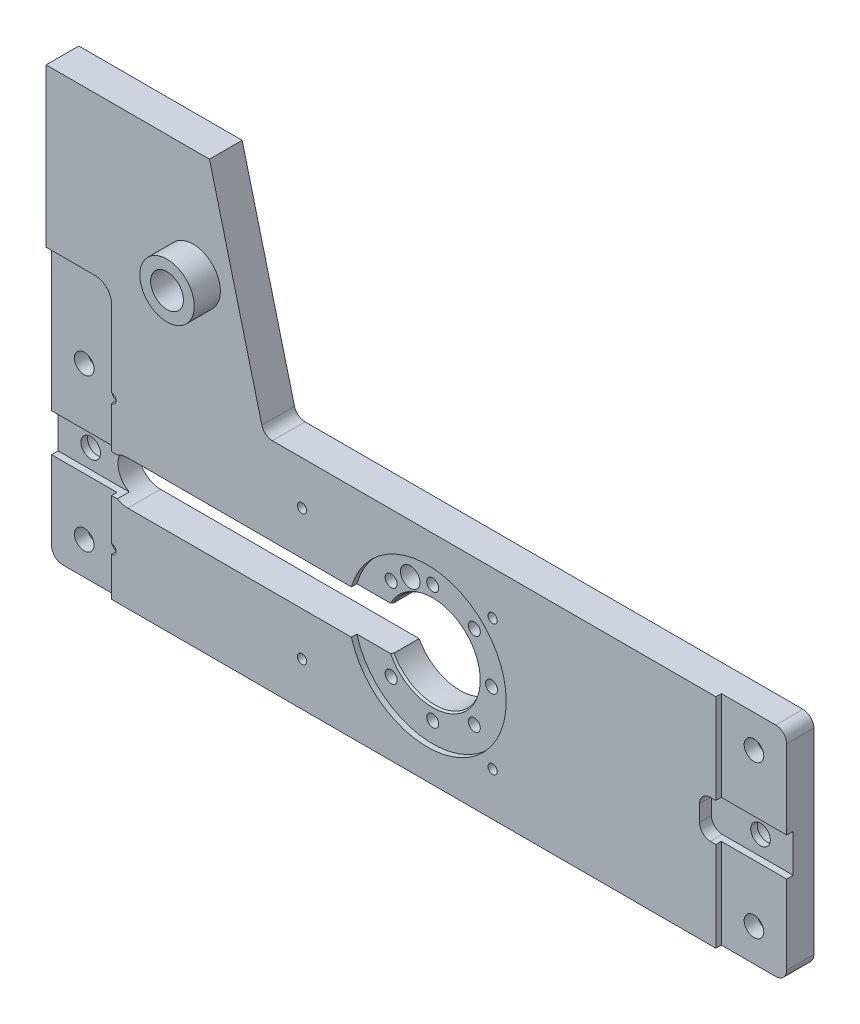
ISO-10303-21;
HEADER;
FILE_DESCRIPTION(('STEP AP214'),'2;1');
FILE_NAME('part.step','',(''),(''),'','','');
FILE_SCHEMA(('AUTOMOTIVE_DESIGN { 1 0 10303 214 1 1 1 1 }'));
ENDSEC;
DATA;
#1=APPLICATION_CONTEXT('core data for automotive mechanical design processes');
#2=APPLICATION_PROTOCOL_DEFINITION('international standard','automotive_design',2000,#1);
#3=PRODUCT_CONTEXT('',#1,'mechanical');
#4=PRODUCT('Part','Part','',(#3));
#5=PRODUCT_RELATED_PRODUCT_CATEGORY('part','',(#4));
#6=PRODUCT_DEFINITION_FORMATION('','',#4);
#7=PRODUCT_DEFINITION_CONTEXT('part definition',#1,'design');
#8=PRODUCT_DEFINITION('design','',#6,#7);
#9=PRODUCT_DEFINITION_SHAPE('','',#8);
#10=(LENGTH_UNIT() NAMED_UNIT(*) SI_UNIT(.MILLI.,.METRE.));
#11=(NAMED_UNIT(*) PLANE_ANGLE_UNIT() SI_UNIT($,.RADIAN.));
#12=(NAMED_UNIT(*) SI_UNIT($,.STERADIAN.) SOLID_ANGLE_UNIT());
#13=UNCERTAINTY_MEASURE_WITH_UNIT(LENGTH_MEASURE(1.E-05),#10,'distance_accuracy_value','');
#14=(GEOMETRIC_REPRESENTATION_CONTEXT(3) GLOBAL_UNCERTAINTY_ASSIGNED_CONTEXT((#13)) GLOBAL_UNIT_ASSIGNED_CONTEXT((#10,
#11,#12)) REPRESENTATION_CONTEXT('',''));
#15=CARTESIAN_POINT('',(0.,0.,0.));
#16=DIRECTION('',(0.,0.,1.));
#17=DIRECTION('',(1.,0.,0.));
#18=AXIS2_PLACEMENT_3D('',#15,#16,#17);
#19=CARTESIAN_POINT('',(388.183766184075,61.8162338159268,0.));
#20=DIRECTION('',(0.,0.,1.));
#21=DIRECTION('',(1.,0.,0.));
#22=AXIS2_PLACEMENT_3D('',#19,#20,#21);
#23=CYLINDRICAL_SURFACE('',#22,5.50000000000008);
#24=CARTESIAN_POINT('',(388.183766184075,61.8162338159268,25.));
#25=DIRECTION('',(0.,0.,1.));
#26=DIRECTION('',(1.,0.,0.));
#27=AXIS2_PLACEMENT_3D('',#24,#25,#26);
#28=CIRCLE('',#27,5.50000000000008);
#29=CARTESIAN_POINT('',(393.683766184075,61.8162338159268,25.));
#30=VERTEX_POINT('',#29);
#31=EDGE_CURVE('E1266',#30,#30,#28,.T.);
#32=CARTESIAN_POINT('',(388.183766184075,61.8162338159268,13.));
#33=DIRECTION('',(0.,0.,-1.));
#34=DIRECTION('',(-1.,0.,0.));
#35=AXIS2_PLACEMENT_3D('',#32,#33,#34);
#36=CIRCLE('',#35,5.50000000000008);
#37=CARTESIAN_POINT('',(393.683766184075,61.8162338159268,13.));
#38=VERTEX_POINT('',#37);
#39=EDGE_CURVE('E761',#38,#38,#36,.F.);
#40=CARTESIAN_POINT('',(393.683766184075,61.8162338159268,25.));
#41=CARTESIAN_POINT('',(393.683766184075,61.8162338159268,24.875));
#42=CARTESIAN_POINT('',(393.683766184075,61.8162338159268,24.75));
#43=CARTESIAN_POINT('',(393.683766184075,61.8162338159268,24.5));
#44=CARTESIAN_POINT('',(393.683766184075,61.8162338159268,24.375));
#45=CARTESIAN_POINT('',(393.683766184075,61.8162338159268,24.125));
#46=CARTESIAN_POINT('',(393.683766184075,61.8162338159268,24.));
#47=CARTESIAN_POINT('',(393.683766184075,61.8162338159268,23.75));
#48=CARTESIAN_POINT('',(393.683766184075,61.8162338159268,23.625));
#49=CARTESIAN_POINT('',(393.683766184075,61.8162338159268,23.375));
#50=CARTESIAN_POINT('',(393.683766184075,61.8162338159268,23.25));
#51=CARTESIAN_POINT('',(393.683766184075,61.8162338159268,23.));
#52=CARTESIAN_POINT('',(393.683766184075,61.8162338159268,22.875));
#53=CARTESIAN_POINT('',(393.683766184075,61.8162338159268,22.625));
#54=CARTESIAN_POINT('',(393.683766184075,61.8162338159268,22.5));
#55=CARTESIAN_POINT('',(393.683766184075,61.8162338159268,22.25));
#56=CARTESIAN_POINT('',(393.683766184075,61.8162338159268,22.125));
#57=CARTESIAN_POINT('',(393.683766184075,61.8162338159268,21.875));
#58=CARTESIAN_POINT('',(393.683766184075,61.8162338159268,21.75));
#59=CARTESIAN_POINT('',(393.683766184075,61.8162338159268,21.5));
#60=CARTESIAN_POINT('',(393.683766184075,61.8162338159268,21.375));
#61=CARTESIAN_POINT('',(393.683766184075,61.8162338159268,21.125));
#62=CARTESIAN_POINT('',(393.683766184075,61.8162338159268,21.));
#63=CARTESIAN_POINT('',(393.683766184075,61.8162338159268,20.75));
#64=CARTESIAN_POINT('',(393.683766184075,61.8162338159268,20.625));
#65=CARTESIAN_POINT('',(393.683766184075,61.8162338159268,20.375));
#66=CARTESIAN_POINT('',(393.683766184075,61.8162338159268,20.25));
#67=CARTESIAN_POINT('',(393.683766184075,61.8162338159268,20.));
#68=CARTESIAN_POINT('',(393.683766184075,61.8162338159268,19.875));
#69=CARTESIAN_POINT('',(393.683766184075,61.8162338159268,19.625));
#70=CARTESIAN_POINT('',(393.683766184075,61.8162338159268,19.5));
#71=CARTESIAN_POINT('',(393.683766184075,61.8162338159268,19.25));
#72=CARTESIAN_POINT('',(393.683766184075,61.8162338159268,19.125));
#73=CARTESIAN_POINT('',(393.683766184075,61.8162338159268,18.875));
#74=CARTESIAN_POINT('',(393.683766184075,61.8162338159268,18.75));
#75=CARTESIAN_POINT('',(393.683766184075,61.8162338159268,18.5));
#76=CARTESIAN_POINT('',(393.683766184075,61.8162338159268,18.375));
#77=CARTESIAN_POINT('',(393.683766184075,61.8162338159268,18.125));
#78=CARTESIAN_POINT('',(393.683766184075,61.8162338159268,18.));
#79=CARTESIAN_POINT('',(393.683766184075,61.8162338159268,17.75));
#80=CARTESIAN_POINT('',(393.683766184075,61.8162338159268,17.625));
#81=CARTESIAN_POINT('',(393.683766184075,61.8162338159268,17.375));
#82=CARTESIAN_POINT('',(393.683766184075,61.8162338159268,17.25));
#83=CARTESIAN_POINT('',(393.683766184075,61.8162338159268,17.));
#84=CARTESIAN_POINT('',(393.683766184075,61.8162338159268,16.875));
#85=CARTESIAN_POINT('',(393.683766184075,61.8162338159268,16.625));
#86=CARTESIAN_POINT('',(393.683766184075,61.8162338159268,16.5));
#87=CARTESIAN_POINT('',(393.683766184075,61.8162338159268,16.25));
#88=CARTESIAN_POINT('',(393.683766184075,61.8162338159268,16.125));
#89=CARTESIAN_POINT('',(393.683766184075,61.8162338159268,15.875));
#90=CARTESIAN_POINT('',(393.683766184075,61.8162338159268,15.75));
#91=CARTESIAN_POINT('',(393.683766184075,61.8162338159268,15.5));
#92=CARTESIAN_POINT('',(393.683766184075,61.8162338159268,15.375));
#93=CARTESIAN_POINT('',(393.683766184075,61.8162338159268,15.125));
#94=CARTESIAN_POINT('',(393.683766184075,61.8162338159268,15.));
#95=CARTESIAN_POINT('',(393.683766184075,61.8162338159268,14.75));
#96=CARTESIAN_POINT('',(393.683766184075,61.8162338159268,14.625));
#97=CARTESIAN_POINT('',(393.683766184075,61.8162338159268,14.375));
#98=CARTESIAN_POINT('',(393.683766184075,61.8162338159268,14.25));
#99=CARTESIAN_POINT('',(393.683766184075,61.8162338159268,14.));
#100=CARTESIAN_POINT('',(393.683766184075,61.8162338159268,13.875));
#101=CARTESIAN_POINT('',(393.683766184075,61.8162338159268,13.625));
#102=CARTESIAN_POINT('',(393.683766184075,61.8162338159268,13.5));
#103=CARTESIAN_POINT('',(393.683766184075,61.8162338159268,13.25));
#104=CARTESIAN_POINT('',(393.683766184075,61.8162338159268,13.125));
#105=CARTESIAN_POINT('',(393.683766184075,61.8162338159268,13.));
#106=B_SPLINE_CURVE_WITH_KNOTS('',3,(#40,#41,#42,#43,#44,#45,#46,#47,#48,#49,#50,#51,#52,#53,
#54,#55,#56,#57,#58,#59,#60,#61,#62,#63,#64,#65,#66,#67,#68,#69,#70,#71,#72,#73,#74,#75,#76,#77,
#78,#79,#80,#81,#82,#83,#84,#85,#86,#87,#88,#89,#90,#91,#92,#93,#94,#95,#96,#97,#98,#99,#100,
#101,#102,#103,#104,#105),.UNSPECIFIED.,.F.,.F.,(4,2,2,2,2,2,2,2,2,2,2,2,2,2,2,2,2,2,2,2,2,2,2,
2,2,2,2,2,2,2,2,2,4),(0.,0.375,0.750000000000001,1.125,1.5,1.875,2.25,2.625,3.,3.375,3.75,4.125,
4.5,4.875,5.25,5.625,6.,6.375,6.75,7.125,7.5,7.875,8.25,8.625,9.,9.375,9.75,10.125,10.5,10.875,
11.25,11.625,12.),.UNSPECIFIED.);
#107=EDGE_CURVE('BSEAM35',#30,#38,#106,.T.);
#108=ORIENTED_EDGE('',*,*,#31,.T.);
#109=ORIENTED_EDGE('',*,*,#39,.F.);
#110=ORIENTED_EDGE('',*,*,#107,.T.);
#111=ORIENTED_EDGE('',*,*,#107,.F.);
#112=EDGE_LOOP('',(#108,#110,#109,#111));
#113=FACE_BOUND('',#112,.T.);
#114=ADVANCED_FACE('F35',(#113),#23,.F.);
#115=CARTESIAN_POINT('',(350.000000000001,46.,0.));
#116=DIRECTION('',(0.,0.,1.));
#117=DIRECTION('',(1.,0.,0.));
#118=AXIS2_PLACEMENT_3D('',#115,#116,#117);
#119=CYLINDRICAL_SURFACE('',#118,5.50000000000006);
#120=CARTESIAN_POINT('',(350.000000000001,46.,25.));
#121=DIRECTION('',(0.,0.,1.));
#122=DIRECTION('',(1.,0.,0.));
#123=AXIS2_PLACEMENT_3D('',#120,#121,#122);
#124=CIRCLE('',#123,5.50000000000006);
#125=CARTESIAN_POINT('',(355.500000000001,46.,25.));
#126=VERTEX_POINT('',#125);
#127=EDGE_CURVE('E1269',#126,#126,#124,.T.);
#128=CARTESIAN_POINT('',(350.000000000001,46.,13.));
#129=DIRECTION('',(0.,0.,-1.));
#130=DIRECTION('',(-1.,0.,0.));
#131=AXIS2_PLACEMENT_3D('',#128,#129,#130);
#132=CIRCLE('',#131,5.50000000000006);
#133=CARTESIAN_POINT('',(355.500000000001,46.,13.));
#134=VERTEX_POINT('',#133);
#135=EDGE_CURVE('E756',#134,#134,#132,.F.);
#136=CARTESIAN_POINT('',(355.500000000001,46.,25.));
#137=CARTESIAN_POINT('',(355.500000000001,46.,24.875));
#138=CARTESIAN_POINT('',(355.500000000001,46.,24.75));
#139=CARTESIAN_POINT('',(355.500000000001,46.,24.5));
#140=CARTESIAN_POINT('',(355.500000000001,46.,24.375));
#141=CARTESIAN_POINT('',(355.500000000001,46.,24.125));
#142=CARTESIAN_POINT('',(355.500000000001,46.,24.));
#143=CARTESIAN_POINT('',(355.500000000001,46.,23.75));
#144=CARTESIAN_POINT('',(355.500000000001,46.,23.625));
#145=CARTESIAN_POINT('',(355.500000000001,46.,23.375));
#146=CARTESIAN_POINT('',(355.500000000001,46.,23.25));
#147=CARTESIAN_POINT('',(355.500000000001,46.,23.));
#148=CARTESIAN_POINT('',(355.500000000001,46.,22.875));
#149=CARTESIAN_POINT('',(355.500000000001,46.,22.625));
#150=CARTESIAN_POINT('',(355.500000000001,46.,22.5));
#151=CARTESIAN_POINT('',(355.500000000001,46.,22.25));
#152=CARTESIAN_POINT('',(355.500000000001,46.,22.125));
#153=CARTESIAN_POINT('',(355.500000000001,46.,21.875));
#154=CARTESIAN_POINT('',(355.500000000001,46.,21.75));
#155=CARTESIAN_POINT('',(355.500000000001,46.,21.5));
#156=CARTESIAN_POINT('',(355.500000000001,46.,21.375));
#157=CARTESIAN_POINT('',(355.500000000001,46.,21.125));
#158=CARTESIAN_POINT('',(355.500000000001,46.,21.));
#159=CARTESIAN_POINT('',(355.500000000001,46.,20.75));
#160=CARTESIAN_POINT('',(355.500000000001,46.,20.625));
#161=CARTESIAN_POINT('',(355.500000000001,46.,20.375));
#162=CARTESIAN_POINT('',(355.500000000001,46.,20.25));
#163=CARTESIAN_POINT('',(355.500000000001,46.,20.));
#164=CARTESIAN_POINT('',(355.500000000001,46.,19.875));
#165=CARTESIAN_POINT('',(355.500000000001,46.,19.625));
#166=CARTESIAN_POINT('',(355.500000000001,46.,19.5));
#167=CARTESIAN_POINT('',(355.500000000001,46.,19.25));
#168=CARTESIAN_POINT('',(355.500000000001,46.,19.125));
#169=CARTESIAN_POINT('',(355.500000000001,46.,18.875));
#170=CARTESIAN_POINT('',(355.500000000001,46.,18.75));
#171=CARTESIAN_POINT('',(355.500000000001,46.,18.5));
#172=CARTESIAN_POINT('',(355.500000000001,46.,18.375));
#173=CARTESIAN_POINT('',(355.500000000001,46.,18.125));
#174=CARTESIAN_POINT('',(355.500000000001,46.,18.));
#175=CARTESIAN_POINT('',(355.500000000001,46.,17.75));
#176=CARTESIAN_POINT('',(355.500000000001,46.,17.625));
#177=CARTESIAN_POINT('',(355.500000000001,46.,17.375));
#178=CARTESIAN_POINT('',(355.500000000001,46.,17.25));
#179=CARTESIAN_POINT('',(355.500000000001,46.,17.));
#180=CARTESIAN_POINT('',(355.500000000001,46.,16.875));
#181=CARTESIAN_POINT('',(355.500000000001,46.,16.625));
#182=CARTESIAN_POINT('',(355.500000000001,46.,16.5));
#183=CARTESIAN_POINT('',(355.500000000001,46.,16.25));
#184=CARTESIAN_POINT('',(355.500000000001,46.,16.125));
#185=CARTESIAN_POINT('',(355.500000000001,46.,15.875));
#186=CARTESIAN_POINT('',(355.500000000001,46.,15.75));
#187=CARTESIAN_POINT('',(355.500000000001,46.,15.5));
#188=CARTESIAN_POINT('',(355.500000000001,46.,15.375));
#189=CARTESIAN_POINT('',(355.500000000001,46.,15.125));
#190=CARTESIAN_POINT('',(355.500000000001,46.,15.));
#191=CARTESIAN_POINT('',(355.500000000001,46.,14.75));
#192=CARTESIAN_POINT('',(355.500000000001,46.,14.625));
#193=CARTESIAN_POINT('',(355.500000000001,46.,14.375));
#194=CARTESIAN_POINT('',(355.500000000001,46.,14.25));
#195=CARTESIAN_POINT('',(355.500000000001,46.,14.));
#196=CARTESIAN_POINT('',(355.500000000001,46.,13.875));
#197=CARTESIAN_POINT('',(355.500000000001,46.,13.625));
#198=CARTESIAN_POINT('',(355.500000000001,46.,13.5));
#199=CARTESIAN_POINT('',(355.500000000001,46.,13.25));
#200=CARTESIAN_POINT('',(355.500000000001,46.,13.125));
#201=CARTESIAN_POINT('',(355.500000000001,46.,13.));
#202=B_SPLINE_CURVE_WITH_KNOTS('',3,(#136,#137,#138,#139,#140,#141,#142,#143,#144,#145,#146,
#147,#148,#149,#150,#151,#152,#153,#154,#155,#156,#157,#158,#159,#160,#161,#162,#163,#164,#165,
#166,#167,#168,#169,#170,#171,#172,#173,#174,#175,#176,#177,#178,#179,#180,#181,#182,#183,#184,
#185,#186,#187,#188,#189,#190,#191,#192,#193,#194,#195,#196,#197,#198,#199,#200,#201),
.UNSPECIFIED.,.F.,.F.,(4,2,2,2,2,2,2,2,2,2,2,2,2,2,2,2,2,2,2,2,2,2,2,2,2,2,2,2,2,2,2,2,4),(0.,
0.375,0.750000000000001,1.125,1.5,1.875,2.25,2.625,3.,3.375,3.75,4.125,4.5,4.875,5.25,5.625,6.,
6.375,6.75,7.125,7.5,7.875,8.25,8.625,9.,9.375,9.75,10.125,10.5,10.875,11.25,11.625,12.),.UNSPECIFIED.);
#203=EDGE_CURVE('BSEAM845',#126,#134,#202,.T.);
#204=ORIENTED_EDGE('',*,*,#127,.T.);
#205=ORIENTED_EDGE('',*,*,#135,.F.);
#206=ORIENTED_EDGE('',*,*,#203,.T.);
#207=ORIENTED_EDGE('',*,*,#203,.F.);
#208=EDGE_LOOP('',(#204,#206,#205,#207));
#209=FACE_BOUND('',#208,.T.);
#210=ADVANCED_FACE('F845',(#209),#119,.F.);
#211=CARTESIAN_POINT('',(311.816233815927,61.8162338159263,0.));
#212=DIRECTION('',(0.,0.,1.));
#213=DIRECTION('',(1.,0.,0.));
#214=AXIS2_PLACEMENT_3D('',#211,#212,#213);
#215=CYLINDRICAL_SURFACE('',#214,5.50000000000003);
#216=CARTESIAN_POINT('',(311.816233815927,61.8162338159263,25.));
#217=DIRECTION('',(0.,0.,1.));
#218=DIRECTION('',(1.,0.,0.));
#219=AXIS2_PLACEMENT_3D('',#216,#217,#218);
#220=CIRCLE('',#219,5.50000000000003);
#221=CARTESIAN_POINT('',(317.316233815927,61.8162338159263,25.));
#222=VERTEX_POINT('',#221);
#223=EDGE_CURVE('E1272',#222,#222,#220,.T.);
#224=CARTESIAN_POINT('',(311.816233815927,61.8162338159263,13.));
#225=DIRECTION('',(0.,0.,-1.));
#226=DIRECTION('',(-1.,0.,0.));
#227=AXIS2_PLACEMENT_3D('',#224,#225,#226);
#228=CIRCLE('',#227,5.50000000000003);
#229=CARTESIAN_POINT('',(317.316233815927,61.8162338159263,13.));
#230=VERTEX_POINT('',#229);
#231=EDGE_CURVE('E751',#230,#230,#228,.F.);
#232=CARTESIAN_POINT('',(317.316233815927,61.8162338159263,25.));
#233=CARTESIAN_POINT('',(317.316233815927,61.8162338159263,24.875));
#234=CARTESIAN_POINT('',(317.316233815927,61.8162338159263,24.75));
#235=CARTESIAN_POINT('',(317.316233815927,61.8162338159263,24.5));
#236=CARTESIAN_POINT('',(317.316233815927,61.8162338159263,24.375));
#237=CARTESIAN_POINT('',(317.316233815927,61.8162338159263,24.125));
#238=CARTESIAN_POINT('',(317.316233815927,61.8162338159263,24.));
#239=CARTESIAN_POINT('',(317.316233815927,61.8162338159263,23.75));
#240=CARTESIAN_POINT('',(317.316233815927,61.8162338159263,23.625));
#241=CARTESIAN_POINT('',(317.316233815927,61.8162338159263,23.375));
#242=CARTESIAN_POINT('',(317.316233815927,61.8162338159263,23.25));
#243=CARTESIAN_POINT('',(317.316233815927,61.8162338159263,23.));
#244=CARTESIAN_POINT('',(317.316233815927,61.8162338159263,22.875));
#245=CARTESIAN_POINT('',(317.316233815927,61.8162338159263,22.625));
#246=CARTESIAN_POINT('',(317.316233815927,61.8162338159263,22.5));
#247=CARTESIAN_POINT('',(317.316233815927,61.8162338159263,22.25));
#248=CARTESIAN_POINT('',(317.316233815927,61.8162338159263,22.125));
#249=CARTESIAN_POINT('',(317.316233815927,61.8162338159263,21.875));
#250=CARTESIAN_POINT('',(317.316233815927,61.8162338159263,21.75));
#251=CARTESIAN_POINT('',(317.316233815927,61.8162338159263,21.5));
#252=CARTESIAN_POINT('',(317.316233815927,61.8162338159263,21.375));
#253=CARTESIAN_POINT('',(317.316233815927,61.8162338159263,21.125));
#254=CARTESIAN_POINT('',(317.316233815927,61.8162338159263,21.));
#255=CARTESIAN_POINT('',(317.316233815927,61.8162338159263,20.75));
#256=CARTESIAN_POINT('',(317.316233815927,61.8162338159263,20.625));
#257=CARTESIAN_POINT('',(317.316233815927,61.8162338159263,20.375));
#258=CARTESIAN_POINT('',(317.316233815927,61.8162338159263,20.25));
#259=CARTESIAN_POINT('',(317.316233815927,61.8162338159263,20.));
#260=CARTESIAN_POINT('',(317.316233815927,61.8162338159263,19.875));
#261=CARTESIAN_POINT('',(317.316233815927,61.8162338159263,19.625));
#262=CARTESIAN_POINT('',(317.316233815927,61.8162338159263,19.5));
#263=CARTESIAN_POINT('',(317.316233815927,61.8162338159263,19.25));
#264=CARTESIAN_POINT('',(317.316233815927,61.8162338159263,19.125));
#265=CARTESIAN_POINT('',(317.316233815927,61.8162338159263,18.875));
#266=CARTESIAN_POINT('',(317.316233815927,61.8162338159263,18.75));
#267=CARTESIAN_POINT('',(317.316233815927,61.8162338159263,18.5));
#268=CARTESIAN_POINT('',(317.316233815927,61.8162338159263,18.375));
#269=CARTESIAN_POINT('',(317.316233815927,61.8162338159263,18.125));
#270=CARTESIAN_POINT('',(317.316233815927,61.8162338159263,18.));
#271=CARTESIAN_POINT('',(317.316233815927,61.8162338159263,17.75));
#272=CARTESIAN_POINT('',(317.316233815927,61.8162338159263,17.625));
#273=CARTESIAN_POINT('',(317.316233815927,61.8162338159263,17.375));
#274=CARTESIAN_POINT('',(317.316233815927,61.8162338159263,17.25));
#275=CARTESIAN_POINT('',(317.316233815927,61.8162338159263,17.));
#276=CARTESIAN_POINT('',(317.316233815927,61.8162338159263,16.875));
#277=CARTESIAN_POINT('',(317.316233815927,61.8162338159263,16.625));
#278=CARTESIAN_POINT('',(317.316233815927,61.8162338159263,16.5));
#279=CARTESIAN_POINT('',(317.316233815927,61.8162338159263,16.25));
#280=CARTESIAN_POINT('',(317.316233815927,61.8162338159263,16.125));
#281=CARTESIAN_POINT('',(317.316233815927,61.8162338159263,15.875));
#282=CARTESIAN_POINT('',(317.316233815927,61.8162338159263,15.75));
#283=CARTESIAN_POINT('',(317.316233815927,61.8162338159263,15.5));
#284=CARTESIAN_POINT('',(317.316233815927,61.8162338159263,15.375));
#285=CARTESIAN_POINT('',(317.316233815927,61.8162338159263,15.125));
#286=CARTESIAN_POINT('',(317.316233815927,61.8162338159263,15.));
#287=CARTESIAN_POINT('',(317.316233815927,61.8162338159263,14.75));
#288=CARTESIAN_POINT('',(317.316233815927,61.8162338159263,14.625));
#289=CARTESIAN_POINT('',(317.316233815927,61.8162338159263,14.375));
#290=CARTESIAN_POINT('',(317.316233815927,61.8162338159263,14.25));
#291=CARTESIAN_POINT('',(317.316233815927,61.8162338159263,14.));
#292=CARTESIAN_POINT('',(317.316233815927,61.8162338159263,13.875));
#293=CARTESIAN_POINT('',(317.316233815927,61.8162338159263,13.625));
#294=CARTESIAN_POINT('',(317.316233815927,61.8162338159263,13.5));
#295=CARTESIAN_POINT('',(317.316233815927,61.8162338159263,13.25));
#296=CARTESIAN_POINT('',(317.316233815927,61.8162338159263,13.125));
#297=CARTESIAN_POINT('',(317.316233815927,61.8162338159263,13.));
#298=B_SPLINE_CURVE_WITH_KNOTS('',3,(#232,#233,#234,#235,#236,#237,#238,#239,#240,#241,#242,
#243,#244,#245,#246,#247,#248,#249,#250,#251,#252,#253,#254,#255,#256,#257,#258,#259,#260,#261,
#262,#263,#264,#265,#266,#267,#268,#269,#270,#271,#272,#273,#274,#275,#276,#277,#278,#279,#280,
#281,#282,#283,#284,#285,#286,#287,#288,#289,#290,#291,#292,#293,#294,#295,#296,#297),
.UNSPECIFIED.,.F.,.F.,(4,2,2,2,2,2,2,2,2,2,2,2,2,2,2,2,2,2,2,2,2,2,2,2,2,2,2,2,2,2,2,2,4),(0.,
0.375,0.750000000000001,1.125,1.5,1.875,2.25,2.625,3.,3.375,3.75,4.125,4.5,4.875,5.25,5.625,6.,
6.375,6.75,7.125,7.5,7.875,8.25,8.625,9.,9.375,9.75,10.125,10.5,10.875,11.25,11.625,12.),.UNSPECIFIED.);
#299=EDGE_CURVE('BSEAM841',#222,#230,#298,.T.);
#300=ORIENTED_EDGE('',*,*,#223,.T.);
#301=ORIENTED_EDGE('',*,*,#231,.F.);
#302=ORIENTED_EDGE('',*,*,#299,.T.);
#303=ORIENTED_EDGE('',*,*,#299,.F.);
#304=EDGE_LOOP('',(#300,#302,#301,#303));
#305=FACE_BOUND('',#304,.T.);
#306=ADVANCED_FACE('F841',(#305),#215,.F.);
#307=CARTESIAN_POINT('',(311.816233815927,138.183766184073,0.));
#308=DIRECTION('',(0.,0.,1.));
#309=DIRECTION('',(1.,0.,0.));
#310=AXIS2_PLACEMENT_3D('',#307,#308,#309);
#311=CYLINDRICAL_SURFACE('',#310,5.50000000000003);
#312=CARTESIAN_POINT('',(311.816233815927,138.183766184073,25.));
#313=DIRECTION('',(0.,0.,1.));
#314=DIRECTION('',(1.,0.,0.));
#315=AXIS2_PLACEMENT_3D('',#312,#313,#314);
#316=CIRCLE('',#315,5.50000000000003);
#317=CARTESIAN_POINT('',(317.316233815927,138.183766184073,25.));
#318=VERTEX_POINT('',#317);
#319=EDGE_CURVE('E734',#318,#318,#316,.T.);
#320=CARTESIAN_POINT('',(311.816233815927,138.183766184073,13.));
#321=DIRECTION('',(0.,0.,-1.));
#322=DIRECTION('',(-1.,0.,0.));
#323=AXIS2_PLACEMENT_3D('',#320,#321,#322);
#324=CIRCLE('',#323,5.50000000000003);
#325=CARTESIAN_POINT('',(317.316233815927,138.183766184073,13.));
#326=VERTEX_POINT('',#325);
#327=EDGE_CURVE('E746',#326,#326,#324,.F.);
#328=CARTESIAN_POINT('',(317.316233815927,138.183766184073,25.));
#329=CARTESIAN_POINT('',(317.316233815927,138.183766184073,24.875));
#330=CARTESIAN_POINT('',(317.316233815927,138.183766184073,24.75));
#331=CARTESIAN_POINT('',(317.316233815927,138.183766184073,24.5));
#332=CARTESIAN_POINT('',(317.316233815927,138.183766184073,24.375));
#333=CARTESIAN_POINT('',(317.316233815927,138.183766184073,24.125));
#334=CARTESIAN_POINT('',(317.316233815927,138.183766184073,24.));
#335=CARTESIAN_POINT('',(317.316233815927,138.183766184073,23.75));
#336=CARTESIAN_POINT('',(317.316233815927,138.183766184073,23.625));
#337=CARTESIAN_POINT('',(317.316233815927,138.183766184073,23.375));
#338=CARTESIAN_POINT('',(317.316233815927,138.183766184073,23.25));
#339=CARTESIAN_POINT('',(317.316233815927,138.183766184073,23.));
#340=CARTESIAN_POINT('',(317.316233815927,138.183766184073,22.875));
#341=CARTESIAN_POINT('',(317.316233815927,138.183766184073,22.625));
#342=CARTESIAN_POINT('',(317.316233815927,138.183766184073,22.5));
#343=CARTESIAN_POINT('',(317.316233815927,138.183766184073,22.25));
#344=CARTESIAN_POINT('',(317.316233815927,138.183766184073,22.125));
#345=CARTESIAN_POINT('',(317.316233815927,138.183766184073,21.875));
#346=CARTESIAN_POINT('',(317.316233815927,138.183766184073,21.75));
#347=CARTESIAN_POINT('',(317.316233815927,138.183766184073,21.5));
#348=CARTESIAN_POINT('',(317.316233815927,138.183766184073,21.375));
#349=CARTESIAN_POINT('',(317.316233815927,138.183766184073,21.125));
#350=CARTESIAN_POINT('',(317.316233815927,138.183766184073,21.));
#351=CARTESIAN_POINT('',(317.316233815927,138.183766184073,20.75));
#352=CARTESIAN_POINT('',(317.316233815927,138.183766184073,20.625));
#353=CARTESIAN_POINT('',(317.316233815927,138.183766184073,20.375));
#354=CARTESIAN_POINT('',(317.316233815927,138.183766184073,20.25));
#355=CARTESIAN_POINT('',(317.316233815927,138.183766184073,20.));
#356=CARTESIAN_POINT('',(317.316233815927,138.183766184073,19.875));
#357=CARTESIAN_POINT('',(317.316233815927,138.183766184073,19.625));
#358=CARTESIAN_POINT('',(317.316233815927,138.183766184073,19.5));
#359=CARTESIAN_POINT('',(317.316233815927,138.183766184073,19.25));
#360=CARTESIAN_POINT('',(317.316233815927,138.183766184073,19.125));
#361=CARTESIAN_POINT('',(317.316233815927,138.183766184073,18.875));
#362=CARTESIAN_POINT('',(317.316233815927,138.183766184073,18.75));
#363=CARTESIAN_POINT('',(317.316233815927,138.183766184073,18.5));
#364=CARTESIAN_POINT('',(317.316233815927,138.183766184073,18.375));
#365=CARTESIAN_POINT('',(317.316233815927,138.183766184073,18.125));
#366=CARTESIAN_POINT('',(317.316233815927,138.183766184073,18.));
#367=CARTESIAN_POINT('',(317.316233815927,138.183766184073,17.75));
#368=CARTESIAN_POINT('',(317.316233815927,138.183766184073,17.625));
#369=CARTESIAN_POINT('',(317.316233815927,138.183766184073,17.375));
#370=CARTESIAN_POINT('',(317.316233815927,138.183766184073,17.25));
#371=CARTESIAN_POINT('',(317.316233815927,138.183766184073,17.));
#372=CARTESIAN_POINT('',(317.316233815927,138.183766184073,16.875));
#373=CARTESIAN_POINT('',(317.316233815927,138.183766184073,16.625));
#374=CARTESIAN_POINT('',(317.316233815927,138.183766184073,16.5));
#375=CARTESIAN_POINT('',(317.316233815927,138.183766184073,16.25));
#376=CARTESIAN_POINT('',(317.316233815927,138.183766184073,16.125));
#377=CARTESIAN_POINT('',(317.316233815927,138.183766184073,15.875));
#378=CARTESIAN_POINT('',(317.316233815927,138.183766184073,15.75));
#379=CARTESIAN_POINT('',(317.316233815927,138.183766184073,15.5));
#380=CARTESIAN_POINT('',(317.316233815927,138.183766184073,15.375));
#381=CARTESIAN_POINT('',(317.316233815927,138.183766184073,15.125));
#382=CARTESIAN_POINT('',(317.316233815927,138.183766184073,15.));
#383=CARTESIAN_POINT('',(317.316233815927,138.183766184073,14.75));
#384=CARTESIAN_POINT('',(317.316233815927,138.183766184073,14.625));
#385=CARTESIAN_POINT('',(317.316233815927,138.183766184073,14.375));
#386=CARTESIAN_POINT('',(317.316233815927,138.183766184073,14.25));
#387=CARTESIAN_POINT('',(317.316233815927,138.183766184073,14.));
#388=CARTESIAN_POINT('',(317.316233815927,138.183766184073,13.875));
#389=CARTESIAN_POINT('',(317.316233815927,138.183766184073,13.625));
#390=CARTESIAN_POINT('',(317.316233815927,138.183766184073,13.5));
#391=CARTESIAN_POINT('',(317.316233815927,138.183766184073,13.25));
#392=CARTESIAN_POINT('',(317.316233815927,138.183766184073,13.125));
#393=CARTESIAN_POINT('',(317.316233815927,138.183766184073,13.));
#394=B_SPLINE_CURVE_WITH_KNOTS('',3,(#328,#329,#330,#331,#332,#333,#334,#335,#336,#337,#338,
#339,#340,#341,#342,#343,#344,#345,#346,#347,#348,#349,#350,#351,#352,#353,#354,#355,#356,#357,
#358,#359,#360,#361,#362,#363,#364,#365,#366,#367,#368,#369,#370,#371,#372,#373,#374,#375,#376,
#377,#378,#379,#380,#381,#382,#383,#384,#385,#386,#387,#388,#389,#390,#391,#392,#393),
.UNSPECIFIED.,.F.,.F.,(4,2,2,2,2,2,2,2,2,2,2,2,2,2,2,2,2,2,2,2,2,2,2,2,2,2,2,2,2,2,2,2,4),(0.,
0.375,0.750000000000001,1.125,1.5,1.875,2.25,2.625,3.,3.375,3.75,4.125,4.5,4.875,5.25,5.625,6.,
6.375,6.75,7.125,7.5,7.875,8.25,8.625,9.,9.375,9.75,10.125,10.5,10.875,11.25,11.625,12.),.UNSPECIFIED.);
#395=EDGE_CURVE('BSEAM837',#318,#326,#394,.T.);
#396=ORIENTED_EDGE('',*,*,#319,.T.);
#397=ORIENTED_EDGE('',*,*,#327,.F.);
#398=ORIENTED_EDGE('',*,*,#395,.T.);
#399=ORIENTED_EDGE('',*,*,#395,.F.);
#400=EDGE_LOOP('',(#396,#398,#397,#399));
#401=FACE_BOUND('',#400,.T.);
#402=ADVANCED_FACE('F837',(#401),#311,.F.);
#403=CARTESIAN_POINT('',(350.,154.,0.));
#404=DIRECTION('',(0.,0.,1.));
#405=DIRECTION('',(1.,0.,0.));
#406=AXIS2_PLACEMENT_3D('',#403,#404,#405);
#407=CYLINDRICAL_SURFACE('',#406,5.50000000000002);
#408=CARTESIAN_POINT('',(350.,154.,25.));
#409=DIRECTION('',(0.,0.,1.));
#410=DIRECTION('',(1.,0.,0.));
#411=AXIS2_PLACEMENT_3D('',#408,#409,#410);
#412=CIRCLE('',#411,5.50000000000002);
#413=CARTESIAN_POINT('',(355.5,154.,25.));
#414=VERTEX_POINT('',#413);
#415=EDGE_CURVE('E1256',#414,#414,#412,.T.);
#416=CARTESIAN_POINT('',(350.,154.,13.));
#417=DIRECTION('',(0.,0.,-1.));
#418=DIRECTION('',(-1.,0.,0.));
#419=AXIS2_PLACEMENT_3D('',#416,#417,#418);
#420=CIRCLE('',#419,5.50000000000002);
#421=CARTESIAN_POINT('',(355.5,154.,13.));
#422=VERTEX_POINT('',#421);
#423=EDGE_CURVE('E741',#422,#422,#420,.F.);
#424=CARTESIAN_POINT('',(355.5,154.,25.));
#425=CARTESIAN_POINT('',(355.5,154.,24.875));
#426=CARTESIAN_POINT('',(355.5,154.,24.75));
#427=CARTESIAN_POINT('',(355.5,154.,24.5));
#428=CARTESIAN_POINT('',(355.5,154.,24.375));
#429=CARTESIAN_POINT('',(355.5,154.,24.125));
#430=CARTESIAN_POINT('',(355.5,154.,24.));
#431=CARTESIAN_POINT('',(355.5,154.,23.75));
#432=CARTESIAN_POINT('',(355.5,154.,23.625));
#433=CARTESIAN_POINT('',(355.5,154.,23.375));
#434=CARTESIAN_POINT('',(355.5,154.,23.25));
#435=CARTESIAN_POINT('',(355.5,154.,23.));
#436=CARTESIAN_POINT('',(355.5,154.,22.875));
#437=CARTESIAN_POINT('',(355.5,154.,22.625));
#438=CARTESIAN_POINT('',(355.5,154.,22.5));
#439=CARTESIAN_POINT('',(355.5,154.,22.25));
#440=CARTESIAN_POINT('',(355.5,154.,22.125));
#441=CARTESIAN_POINT('',(355.5,154.,21.875));
#442=CARTESIAN_POINT('',(355.5,154.,21.75));
#443=CARTESIAN_POINT('',(355.5,154.,21.5));
#444=CARTESIAN_POINT('',(355.5,154.,21.375));
#445=CARTESIAN_POINT('',(355.5,154.,21.125));
#446=CARTESIAN_POINT('',(355.5,154.,21.));
#447=CARTESIAN_POINT('',(355.5,154.,20.75));
#448=CARTESIAN_POINT('',(355.5,154.,20.625));
#449=CARTESIAN_POINT('',(355.5,154.,20.375));
#450=CARTESIAN_POINT('',(355.5,154.,20.25));
#451=CARTESIAN_POINT('',(355.5,154.,20.));
#452=CARTESIAN_POINT('',(355.5,154.,19.875));
#453=CARTESIAN_POINT('',(355.5,154.,19.625));
#454=CARTESIAN_POINT('',(355.5,154.,19.5));
#455=CARTESIAN_POINT('',(355.5,154.,19.25));
#456=CARTESIAN_POINT('',(355.5,154.,19.125));
#457=CARTESIAN_POINT('',(355.5,154.,18.875));
#458=CARTESIAN_POINT('',(355.5,154.,18.75));
#459=CARTESIAN_POINT('',(355.5,154.,18.5));
#460=CARTESIAN_POINT('',(355.5,154.,18.375));
#461=CARTESIAN_POINT('',(355.5,154.,18.125));
#462=CARTESIAN_POINT('',(355.5,154.,18.));
#463=CARTESIAN_POINT('',(355.5,154.,17.75));
#464=CARTESIAN_POINT('',(355.5,154.,17.625));
#465=CARTESIAN_POINT('',(355.5,154.,17.375));
#466=CARTESIAN_POINT('',(355.5,154.,17.25));
#467=CARTESIAN_POINT('',(355.5,154.,17.));
#468=CARTESIAN_POINT('',(355.5,154.,16.875));
#469=CARTESIAN_POINT('',(355.5,154.,16.625));
#470=CARTESIAN_POINT('',(355.5,154.,16.5));
#471=CARTESIAN_POINT('',(355.5,154.,16.25));
#472=CARTESIAN_POINT('',(355.5,154.,16.125));
#473=CARTESIAN_POINT('',(355.5,154.,15.875));
#474=CARTESIAN_POINT('',(355.5,154.,15.75));
#475=CARTESIAN_POINT('',(355.5,154.,15.5));
#476=CARTESIAN_POINT('',(355.5,154.,15.375));
#477=CARTESIAN_POINT('',(355.5,154.,15.125));
#478=CARTESIAN_POINT('',(355.5,154.,15.));
#479=CARTESIAN_POINT('',(355.5,154.,14.75));
#480=CARTESIAN_POINT('',(355.5,154.,14.625));
#481=CARTESIAN_POINT('',(355.5,154.,14.375));
#482=CARTESIAN_POINT('',(355.5,154.,14.25));
#483=CARTESIAN_POINT('',(355.5,154.,14.));
#484=CARTESIAN_POINT('',(355.5,154.,13.875));
#485=CARTESIAN_POINT('',(355.5,154.,13.625));
#486=CARTESIAN_POINT('',(355.5,154.,13.5));
#487=CARTESIAN_POINT('',(355.5,154.,13.25));
#488=CARTESIAN_POINT('',(355.5,154.,13.125));
#489=CARTESIAN_POINT('',(355.5,154.,13.));
#490=B_SPLINE_CURVE_WITH_KNOTS('',3,(#424,#425,#426,#427,#428,#429,#430,#431,#432,#433,#434,
#435,#436,#437,#438,#439,#440,#441,#442,#443,#444,#445,#446,#447,#448,#449,#450,#451,#452,#453,
#454,#455,#456,#457,#458,#459,#460,#461,#462,#463,#464,#465,#466,#467,#468,#469,#470,#471,#472,
#473,#474,#475,#476,#477,#478,#479,#480,#481,#482,#483,#484,#485,#486,#487,#488,#489),
.UNSPECIFIED.,.F.,.F.,(4,2,2,2,2,2,2,2,2,2,2,2,2,2,2,2,2,2,2,2,2,2,2,2,2,2,2,2,2,2,2,2,4),(0.,
0.375,0.750000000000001,1.125,1.5,1.875,2.25,2.625,3.,3.375,3.75,4.125,4.5,4.875,5.25,5.625,6.,
6.375,6.75,7.125,7.5,7.875,8.25,8.625,9.,9.375,9.75,10.125,10.5,10.875,11.25,11.625,12.),.UNSPECIFIED.);
#491=EDGE_CURVE('BSEAM840',#414,#422,#490,.T.);
#492=ORIENTED_EDGE('',*,*,#415,.T.);
#493=ORIENTED_EDGE('',*,*,#423,.F.);
#494=ORIENTED_EDGE('',*,*,#491,.T.);
#495=ORIENTED_EDGE('',*,*,#491,.F.);
#496=EDGE_LOOP('',(#492,#494,#493,#495));
#497=FACE_BOUND('',#496,.T.);
#498=ADVANCED_FACE('F840',(#497),#407,.F.);
#499=CARTESIAN_POINT('',(388.183766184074,138.183766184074,0.));
#500=DIRECTION('',(0.,0.,1.));
#501=DIRECTION('',(1.,0.,0.));
#502=AXIS2_PLACEMENT_3D('',#499,#500,#501);
#503=CYLINDRICAL_SURFACE('',#502,5.5);
#504=CARTESIAN_POINT('',(388.183766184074,138.183766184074,25.));
#505=DIRECTION('',(0.,0.,1.));
#506=DIRECTION('',(1.,0.,0.));
#507=AXIS2_PLACEMENT_3D('',#504,#505,#506);
#508=CIRCLE('',#507,5.5);
#509=CARTESIAN_POINT('',(393.683766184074,138.183766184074,25.));
#510=VERTEX_POINT('',#509);
#511=EDGE_CURVE('E1258',#510,#510,#508,.T.);
#512=CARTESIAN_POINT('',(388.183766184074,138.183766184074,13.));
#513=DIRECTION('',(0.,0.,-1.));
#514=DIRECTION('',(-1.,0.,0.));
#515=AXIS2_PLACEMENT_3D('',#512,#513,#514);
#516=CIRCLE('',#515,5.5);
#517=CARTESIAN_POINT('',(393.683766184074,138.183766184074,13.));
#518=VERTEX_POINT('',#517);
#519=EDGE_CURVE('E736',#518,#518,#516,.F.);
#520=CARTESIAN_POINT('',(393.683766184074,138.183766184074,25.));
#521=CARTESIAN_POINT('',(393.683766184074,138.183766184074,24.875));
#522=CARTESIAN_POINT('',(393.683766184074,138.183766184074,24.75));
#523=CARTESIAN_POINT('',(393.683766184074,138.183766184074,24.5));
#524=CARTESIAN_POINT('',(393.683766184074,138.183766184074,24.375));
#525=CARTESIAN_POINT('',(393.683766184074,138.183766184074,24.125));
#526=CARTESIAN_POINT('',(393.683766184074,138.183766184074,24.));
#527=CARTESIAN_POINT('',(393.683766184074,138.183766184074,23.75));
#528=CARTESIAN_POINT('',(393.683766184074,138.183766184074,23.625));
#529=CARTESIAN_POINT('',(393.683766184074,138.183766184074,23.375));
#530=CARTESIAN_POINT('',(393.683766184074,138.183766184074,23.25));
#531=CARTESIAN_POINT('',(393.683766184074,138.183766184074,23.));
#532=CARTESIAN_POINT('',(393.683766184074,138.183766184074,22.875));
#533=CARTESIAN_POINT('',(393.683766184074,138.183766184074,22.625));
#534=CARTESIAN_POINT('',(393.683766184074,138.183766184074,22.5));
#535=CARTESIAN_POINT('',(393.683766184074,138.183766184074,22.25));
#536=CARTESIAN_POINT('',(393.683766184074,138.183766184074,22.125));
#537=CARTESIAN_POINT('',(393.683766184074,138.183766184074,21.875));
#538=CARTESIAN_POINT('',(393.683766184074,138.183766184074,21.75));
#539=CARTESIAN_POINT('',(393.683766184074,138.183766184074,21.5));
#540=CARTESIAN_POINT('',(393.683766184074,138.183766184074,21.375));
#541=CARTESIAN_POINT('',(393.683766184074,138.183766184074,21.125));
#542=CARTESIAN_POINT('',(393.683766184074,138.183766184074,21.));
#543=CARTESIAN_POINT('',(393.683766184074,138.183766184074,20.75));
#544=CARTESIAN_POINT('',(393.683766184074,138.183766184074,20.625));
#545=CARTESIAN_POINT('',(393.683766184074,138.183766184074,20.375));
#546=CARTESIAN_POINT('',(393.683766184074,138.183766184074,20.25));
#547=CARTESIAN_POINT('',(393.683766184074,138.183766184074,20.));
#548=CARTESIAN_POINT('',(393.683766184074,138.183766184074,19.875));
#549=CARTESIAN_POINT('',(393.683766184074,138.183766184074,19.625));
#550=CARTESIAN_POINT('',(393.683766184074,138.183766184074,19.5));
#551=CARTESIAN_POINT('',(393.683766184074,138.183766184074,19.25));
#552=CARTESIAN_POINT('',(393.683766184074,138.183766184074,19.125));
#553=CARTESIAN_POINT('',(393.683766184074,138.183766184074,18.875));
#554=CARTESIAN_POINT('',(393.683766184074,138.183766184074,18.75));
#555=CARTESIAN_POINT('',(393.683766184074,138.183766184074,18.5));
#556=CARTESIAN_POINT('',(393.683766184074,138.183766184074,18.375));
#557=CARTESIAN_POINT('',(393.683766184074,138.183766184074,18.125));
#558=CARTESIAN_POINT('',(393.683766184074,138.183766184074,18.));
#559=CARTESIAN_POINT('',(393.683766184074,138.183766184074,17.75));
#560=CARTESIAN_POINT('',(393.683766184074,138.183766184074,17.625));
#561=CARTESIAN_POINT('',(393.683766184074,138.183766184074,17.375));
#562=CARTESIAN_POINT('',(393.683766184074,138.183766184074,17.25));
#563=CARTESIAN_POINT('',(393.683766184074,138.183766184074,17.));
#564=CARTESIAN_POINT('',(393.683766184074,138.183766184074,16.875));
#565=CARTESIAN_POINT('',(393.683766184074,138.183766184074,16.625));
#566=CARTESIAN_POINT('',(393.683766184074,138.183766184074,16.5));
#567=CARTESIAN_POINT('',(393.683766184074,138.183766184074,16.25));
#568=CARTESIAN_POINT('',(393.683766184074,138.183766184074,16.125));
#569=CARTESIAN_POINT('',(393.683766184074,138.183766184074,15.875));
#570=CARTESIAN_POINT('',(393.683766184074,138.183766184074,15.75));
#571=CARTESIAN_POINT('',(393.683766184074,138.183766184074,15.5));
#572=CARTESIAN_POINT('',(393.683766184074,138.183766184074,15.375));
#573=CARTESIAN_POINT('',(393.683766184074,138.183766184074,15.125));
#574=CARTESIAN_POINT('',(393.683766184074,138.183766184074,15.));
#575=CARTESIAN_POINT('',(393.683766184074,138.183766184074,14.75));
#576=CARTESIAN_POINT('',(393.683766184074,138.183766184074,14.625));
#577=CARTESIAN_POINT('',(393.683766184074,138.183766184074,14.375));
#578=CARTESIAN_POINT('',(393.683766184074,138.183766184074,14.25));
#579=CARTESIAN_POINT('',(393.683766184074,138.183766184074,14.));
#580=CARTESIAN_POINT('',(393.683766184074,138.183766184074,13.875));
#581=CARTESIAN_POINT('',(393.683766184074,138.183766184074,13.625));
#582=CARTESIAN_POINT('',(393.683766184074,138.183766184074,13.5));
#583=CARTESIAN_POINT('',(393.683766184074,138.183766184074,13.25));
#584=CARTESIAN_POINT('',(393.683766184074,138.183766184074,13.125));
#585=CARTESIAN_POINT('',(393.683766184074,138.183766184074,13.));
#586=B_SPLINE_CURVE_WITH_KNOTS('',3,(#520,#521,#522,#523,#524,#525,#526,#527,#528,#529,#530,
#531,#532,#533,#534,#535,#536,#537,#538,#539,#540,#541,#542,#543,#544,#545,#546,#547,#548,#549,
#550,#551,#552,#553,#554,#555,#556,#557,#558,#559,#560,#561,#562,#563,#564,#565,#566,#567,#568,
#569,#570,#571,#572,#573,#574,#575,#576,#577,#578,#579,#580,#581,#582,#583,#584,#585),
.UNSPECIFIED.,.F.,.F.,(4,2,2,2,2,2,2,2,2,2,2,2,2,2,2,2,2,2,2,2,2,2,2,2,2,2,2,2,2,2,2,2,4),(0.,
0.375,0.750000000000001,1.125,1.5,1.875,2.25,2.625,3.,3.375,3.75,4.125,4.5,4.875,5.25,5.625,6.,
6.375,6.75,7.125,7.5,7.875,8.25,8.625,9.,9.375,9.75,10.125,10.5,10.875,11.25,11.625,12.),.UNSPECIFIED.);
#587=EDGE_CURVE('BSEAM857',#510,#518,#586,.T.);
#588=ORIENTED_EDGE('',*,*,#511,.T.);
#589=ORIENTED_EDGE('',*,*,#519,.F.);
#590=ORIENTED_EDGE('',*,*,#587,.T.);
#591=ORIENTED_EDGE('',*,*,#587,.F.);
#592=EDGE_LOOP('',(#588,#590,#589,#591));
#593=FACE_BOUND('',#592,.T.);
#594=ADVANCED_FACE('F857',(#593),#503,.F.);
#595=CARTESIAN_POINT('',(404.000000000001,100.000000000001,0.));
#596=DIRECTION('',(0.,0.,1.));
#597=DIRECTION('',(1.,0.,0.));
#598=AXIS2_PLACEMENT_3D('',#595,#596,#597);
#599=CYLINDRICAL_SURFACE('',#598,5.50000000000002);
#600=CARTESIAN_POINT('',(404.000000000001,100.000000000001,25.));
#601=DIRECTION('',(0.,0.,1.));
#602=DIRECTION('',(1.,0.,0.));
#603=AXIS2_PLACEMENT_3D('',#600,#601,#602);
#604=CIRCLE('',#603,5.50000000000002);
#605=CARTESIAN_POINT('',(409.500000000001,100.000000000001,25.));
#606=VERTEX_POINT('',#605);
#607=EDGE_CURVE('E1263',#606,#606,#604,.T.);
#608=CARTESIAN_POINT('',(404.000000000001,100.000000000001,13.));
#609=DIRECTION('',(0.,0.,-1.));
#610=DIRECTION('',(-1.,0.,0.));
#611=AXIS2_PLACEMENT_3D('',#608,#609,#610);
#612=CIRCLE('',#611,5.50000000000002);
#613=CARTESIAN_POINT('',(409.500000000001,100.000000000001,13.));
#614=VERTEX_POINT('',#613);
#615=EDGE_CURVE('E731',#614,#614,#612,.F.);
#616=CARTESIAN_POINT('',(409.500000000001,100.000000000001,25.));
#617=CARTESIAN_POINT('',(409.500000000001,100.000000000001,24.875));
#618=CARTESIAN_POINT('',(409.500000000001,100.000000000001,24.75));
#619=CARTESIAN_POINT('',(409.500000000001,100.000000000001,24.5));
#620=CARTESIAN_POINT('',(409.500000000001,100.000000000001,24.375));
#621=CARTESIAN_POINT('',(409.500000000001,100.000000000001,24.125));
#622=CARTESIAN_POINT('',(409.500000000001,100.000000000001,24.));
#623=CARTESIAN_POINT('',(409.500000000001,100.000000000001,23.75));
#624=CARTESIAN_POINT('',(409.500000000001,100.000000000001,23.625));
#625=CARTESIAN_POINT('',(409.500000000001,100.000000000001,23.375));
#626=CARTESIAN_POINT('',(409.500000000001,100.000000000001,23.25));
#627=CARTESIAN_POINT('',(409.500000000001,100.000000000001,23.));
#628=CARTESIAN_POINT('',(409.500000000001,100.000000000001,22.875));
#629=CARTESIAN_POINT('',(409.500000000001,100.000000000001,22.625));
#630=CARTESIAN_POINT('',(409.500000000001,100.000000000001,22.5));
#631=CARTESIAN_POINT('',(409.500000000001,100.000000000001,22.25));
#632=CARTESIAN_POINT('',(409.500000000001,100.000000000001,22.125));
#633=CARTESIAN_POINT('',(409.500000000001,100.000000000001,21.875));
#634=CARTESIAN_POINT('',(409.500000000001,100.000000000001,21.75));
#635=CARTESIAN_POINT('',(409.500000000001,100.000000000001,21.5));
#636=CARTESIAN_POINT('',(409.500000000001,100.000000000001,21.375));
#637=CARTESIAN_POINT('',(409.500000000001,100.000000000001,21.125));
#638=CARTESIAN_POINT('',(409.500000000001,100.000000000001,21.));
#639=CARTESIAN_POINT('',(409.500000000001,100.000000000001,20.75));
#640=CARTESIAN_POINT('',(409.500000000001,100.000000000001,20.625));
#641=CARTESIAN_POINT('',(409.500000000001,100.000000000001,20.375));
#642=CARTESIAN_POINT('',(409.500000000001,100.000000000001,20.25));
#643=CARTESIAN_POINT('',(409.500000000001,100.000000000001,20.));
#644=CARTESIAN_POINT('',(409.500000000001,100.000000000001,19.875));
#645=CARTESIAN_POINT('',(409.500000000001,100.000000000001,19.625));
#646=CARTESIAN_POINT('',(409.500000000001,100.000000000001,19.5));
#647=CARTESIAN_POINT('',(409.500000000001,100.000000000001,19.25));
#648=CARTESIAN_POINT('',(409.500000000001,100.000000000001,19.125));
#649=CARTESIAN_POINT('',(409.500000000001,100.000000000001,18.875));
#650=CARTESIAN_POINT('',(409.500000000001,100.000000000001,18.75));
#651=CARTESIAN_POINT('',(409.500000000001,100.000000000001,18.5));
#652=CARTESIAN_POINT('',(409.500000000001,100.000000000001,18.375));
#653=CARTESIAN_POINT('',(409.500000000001,100.000000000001,18.125));
#654=CARTESIAN_POINT('',(409.500000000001,100.000000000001,18.));
#655=CARTESIAN_POINT('',(409.500000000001,100.000000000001,17.75));
#656=CARTESIAN_POINT('',(409.500000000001,100.000000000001,17.625));
#657=CARTESIAN_POINT('',(409.500000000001,100.000000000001,17.375));
#658=CARTESIAN_POINT('',(409.500000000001,100.000000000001,17.25));
#659=CARTESIAN_POINT('',(409.500000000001,100.000000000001,17.));
#660=CARTESIAN_POINT('',(409.500000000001,100.000000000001,16.875));
#661=CARTESIAN_POINT('',(409.500000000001,100.000000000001,16.625));
#662=CARTESIAN_POINT('',(409.500000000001,100.000000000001,16.5));
#663=CARTESIAN_POINT('',(409.500000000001,100.000000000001,16.25));
#664=CARTESIAN_POINT('',(409.500000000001,100.000000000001,16.125));
#665=CARTESIAN_POINT('',(409.500000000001,100.000000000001,15.875));
#666=CARTESIAN_POINT('',(409.500000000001,100.000000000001,15.75));
#667=CARTESIAN_POINT('',(409.500000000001,100.000000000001,15.5));
#668=CARTESIAN_POINT('',(409.500000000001,100.000000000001,15.375));
#669=CARTESIAN_POINT('',(409.500000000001,100.000000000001,15.125));
#670=CARTESIAN_POINT('',(409.500000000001,100.000000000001,15.));
#671=CARTESIAN_POINT('',(409.500000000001,100.000000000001,14.75));
#672=CARTESIAN_POINT('',(409.500000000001,100.000000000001,14.625));
#673=CARTESIAN_POINT('',(409.500000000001,100.000000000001,14.375));
#674=CARTESIAN_POINT('',(409.500000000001,100.000000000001,14.25));
#675=CARTESIAN_POINT('',(409.500000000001,100.000000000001,14.));
#676=CARTESIAN_POINT('',(409.500000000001,100.000000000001,13.875));
#677=CARTESIAN_POINT('',(409.500000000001,100.000000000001,13.625));
#678=CARTESIAN_POINT('',(409.500000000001,100.000000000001,13.5));
#679=CARTESIAN_POINT('',(409.500000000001,100.000000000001,13.25));
#680=CARTESIAN_POINT('',(409.500000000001,100.000000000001,13.125));
#681=CARTESIAN_POINT('',(409.500000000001,100.000000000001,13.));
#682=B_SPLINE_CURVE_WITH_KNOTS('',3,(#616,#617,#618,#619,#620,#621,#622,#623,#624,#625,#626,
#627,#628,#629,#630,#631,#632,#633,#634,#635,#636,#637,#638,#639,#640,#641,#642,#643,#644,#645,
#646,#647,#648,#649,#650,#651,#652,#653,#654,#655,#656,#657,#658,#659,#660,#661,#662,#663,#664,
#665,#666,#667,#668,#669,#670,#671,#672,#673,#674,#675,#676,#677,#678,#679,#680,#681),
.UNSPECIFIED.,.F.,.F.,(4,2,2,2,2,2,2,2,2,2,2,2,2,2,2,2,2,2,2,2,2,2,2,2,2,2,2,2,2,2,2,2,4),(0.,
0.375,0.750000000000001,1.125,1.5,1.875,2.25,2.625,3.,3.375,3.75,4.125,4.5,4.875,5.25,5.625,6.,
6.375,6.75,7.125,7.5,7.875,8.25,8.625,9.,9.375,9.75,10.125,10.5,10.875,11.25,11.625,12.),.UNSPECIFIED.);
#683=EDGE_CURVE('BSEAM853',#606,#614,#682,.T.);
#684=ORIENTED_EDGE('',*,*,#607,.T.);
#685=ORIENTED_EDGE('',*,*,#615,.F.);
#686=ORIENTED_EDGE('',*,*,#683,.T.);
#687=ORIENTED_EDGE('',*,*,#683,.F.);
#688=EDGE_LOOP('',(#684,#686,#685,#687));
#689=FACE_BOUND('',#688,.T.);
#690=ADVANCED_FACE('F853',(#689),#599,.F.);
#691=CARTESIAN_POINT('',(10.,10.,0.));
#692=DIRECTION('',(0.,0.,-1.));
#693=DIRECTION('',(-1.,0.,0.));
#694=AXIS2_PLACEMENT_3D('',#691,#692,#693);
#695=PLANE('',#694);
#696=CARTESIAN_POINT('',(388.183766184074,61.816233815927,0.));
#697=DIRECTION('',(0.,0.,-1.));
#698=DIRECTION('',(-1.,0.,0.));
#699=AXIS2_PLACEMENT_3D('',#696,#697,#698);
#700=CIRCLE('',#699,9.00000000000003);
#701=CARTESIAN_POINT('',(379.183766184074,61.816233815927,0.));
#702=VERTEX_POINT('',#701);
#703=EDGE_CURVE('E1196',#702,#702,#700,.T.);
#704=ORIENTED_EDGE('',*,*,#703,.F.);
#705=EDGE_LOOP('',(#704));
#706=FACE_BOUND('',#705,.T.);
#707=CARTESIAN_POINT('',(350.,46.,0.));
#708=DIRECTION('',(0.,0.,-1.));
#709=DIRECTION('',(-1.,0.,0.));
#710=AXIS2_PLACEMENT_3D('',#707,#708,#709);
#711=CIRCLE('',#710,8.99999999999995);
#712=CARTESIAN_POINT('',(341.,46.,0.));
#713=VERTEX_POINT('',#712);
#714=EDGE_CURVE('E764',#713,#713,#711,.T.);
#715=ORIENTED_EDGE('',*,*,#714,.F.);
#716=EDGE_LOOP('',(#715));
#717=FACE_BOUND('',#716,.T.);
#718=CARTESIAN_POINT('',(311.816233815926,61.8162338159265,0.));
#719=DIRECTION('',(0.,0.,-1.));
#720=DIRECTION('',(-1.,0.,0.));
#721=AXIS2_PLACEMENT_3D('',#718,#719,#720);
#722=CIRCLE('',#721,9.);
#723=CARTESIAN_POINT('',(302.816233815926,61.8162338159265,0.));
#724=VERTEX_POINT('',#723);
#725=EDGE_CURVE('E759',#724,#724,#722,.T.);
#726=ORIENTED_EDGE('',*,*,#725,.F.);
#727=EDGE_LOOP('',(#726));
#728=FACE_BOUND('',#727,.T.);
#729=CARTESIAN_POINT('',(311.816233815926,138.183766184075,0.));
#730=DIRECTION('',(0.,0.,-1.));
#731=DIRECTION('',(-1.,0.,0.));
#732=AXIS2_PLACEMENT_3D('',#729,#730,#731);
#733=CIRCLE('',#732,8.99999999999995);
#734=CARTESIAN_POINT('',(302.816233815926,138.183766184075,0.));
#735=VERTEX_POINT('',#734);
#736=EDGE_CURVE('E754',#735,#735,#733,.T.);
#737=ORIENTED_EDGE('',*,*,#736,.F.);
#738=EDGE_LOOP('',(#737));
#739=FACE_BOUND('',#738,.T.);
#740=CARTESIAN_POINT('',(350.,154.000000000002,0.));
#741=DIRECTION('',(0.,0.,-1.));
#742=DIRECTION('',(-1.,0.,0.));
#743=AXIS2_PLACEMENT_3D('',#740,#741,#742);
#744=CIRCLE('',#743,8.99999999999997);
#745=CARTESIAN_POINT('',(341.,154.000000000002,0.));
#746=VERTEX_POINT('',#745);
#747=EDGE_CURVE('E749',#746,#746,#744,.T.);
#748=ORIENTED_EDGE('',*,*,#747,.F.);
#749=EDGE_LOOP('',(#748));
#750=FACE_BOUND('',#749,.T.);
#751=CARTESIAN_POINT('',(388.183766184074,138.183766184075,0.));
#752=DIRECTION('',(0.,0.,-1.));
#753=DIRECTION('',(-1.,0.,0.));
#754=AXIS2_PLACEMENT_3D('',#751,#752,#753);
#755=CIRCLE('',#754,8.99999999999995);
#756=CARTESIAN_POINT('',(379.183766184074,138.183766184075,0.));
#757=VERTEX_POINT('',#756);
#758=EDGE_CURVE('E744',#757,#757,#755,.T.);
#759=ORIENTED_EDGE('',*,*,#758,.F.);
#760=EDGE_LOOP('',(#759));
#761=FACE_BOUND('',#760,.T.);
#762=CARTESIAN_POINT('',(404.000000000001,100.000000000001,0.));
#763=DIRECTION('',(0.,0.,-1.));
#764=DIRECTION('',(-1.,0.,0.));
#765=AXIS2_PLACEMENT_3D('',#762,#763,#764);
#766=CIRCLE('',#765,8.99999999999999);
#767=CARTESIAN_POINT('',(395.000000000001,100.000000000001,0.));
#768=VERTEX_POINT('',#767);
#769=EDGE_CURVE('E739',#768,#768,#766,.T.);
#770=ORIENTED_EDGE('',*,*,#769,.F.);
#771=EDGE_LOOP('',(#770));
#772=FACE_BOUND('',#771,.T.);
#773=CARTESIAN_POINT('',(329.335094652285,149.88949475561,0.));
#774=DIRECTION('',(0.,0.,1.));
#775=DIRECTION('',(1.,0.,0.));
#776=AXIS2_PLACEMENT_3D('',#773,#774,#775);
#777=CIRCLE('',#776,8.99999999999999);
#778=CARTESIAN_POINT('',(338.335094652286,149.88949475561,0.));
#779=VERTEX_POINT('',#778);
#780=EDGE_CURVE('E313',#779,#779,#777,.T.);
#781=ORIENTED_EDGE('',*,*,#780,.T.);
#782=EDGE_LOOP('',(#781));
#783=FACE_BOUND('',#782,.T.);
#784=CARTESIAN_POINT('',(110.,295.,0.));
#785=DIRECTION('',(0.,0.,-1.));
#786=DIRECTION('',(-1.,0.,0.));
#787=AXIS2_PLACEMENT_3D('',#784,#785,#786);
#788=CIRCLE('',#787,4.24999999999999);
#789=CARTESIAN_POINT('',(105.75,295.,0.));
#790=VERTEX_POINT('',#789);
#791=EDGE_CURVE('E312',#790,#790,#788,.T.);
#792=ORIENTED_EDGE('',*,*,#791,.F.);
#793=EDGE_LOOP('',(#792));
#794=FACE_BOUND('',#793,.T.);
#795=CARTESIAN_POINT('',(60.0000000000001,160.,0.));
#796=DIRECTION('',(0.,0.,1.));
#797=DIRECTION('',(1.,0.,0.));
#798=AXIS2_PLACEMENT_3D('',#795,#796,#797);
#799=CIRCLE('',#798,4.24999999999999);
#800=CARTESIAN_POINT('',(64.25,160.,0.));
#801=VERTEX_POINT('',#800);
#802=EDGE_CURVE('E333',#801,#801,#799,.T.);
#803=ORIENTED_EDGE('',*,*,#802,.T.);
#804=EDGE_LOOP('',(#803));
#805=FACE_BOUND('',#804,.T.);
#806=CARTESIAN_POINT('',(235.,160.,0.));
#807=DIRECTION('',(0.,0.,1.));
#808=DIRECTION('',(1.,0.,0.));
#809=AXIS2_PLACEMENT_3D('',#806,#807,#808);
#810=CIRCLE('',#809,4.25);
#811=CARTESIAN_POINT('',(239.25,160.,0.));
#812=VERTEX_POINT('',#811);
#813=EDGE_CURVE('E346',#812,#812,#810,.T.);
#814=ORIENTED_EDGE('',*,*,#813,.T.);
#815=EDGE_LOOP('',(#814));
#816=FACE_BOUND('',#815,.T.);
#817=CARTESIAN_POINT('',(410.,160.,0.));
#818=DIRECTION('',(0.,0.,1.));
#819=DIRECTION('',(1.,0.,0.));
#820=AXIS2_PLACEMENT_3D('',#817,#818,#819);
#821=CIRCLE('',#820,4.24999999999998);
#822=CARTESIAN_POINT('',(414.25,160.,0.));
#823=VERTEX_POINT('',#822);
#824=EDGE_CURVE('E358',#823,#823,#821,.T.);
#825=ORIENTED_EDGE('',*,*,#824,.T.);
#826=EDGE_LOOP('',(#825));
#827=FACE_BOUND('',#826,.T.);
#828=CARTESIAN_POINT('',(645.,30.,0.));
#829=DIRECTION('',(0.,0.,-1.));
#830=DIRECTION('',(-1.,0.,0.));
#831=AXIS2_PLACEMENT_3D('',#828,#829,#830);
#832=CIRCLE('',#831,14.);
#833=CARTESIAN_POINT('',(631.,30.,0.));
#834=VERTEX_POINT('',#833);
#835=EDGE_CURVE('E364',#834,#834,#832,.T.);
#836=ORIENTED_EDGE('',*,*,#835,.F.);
#837=EDGE_LOOP('',(#836));
#838=FACE_BOUND('',#837,.T.);
#839=CARTESIAN_POINT('',(645.,100.,0.));
#840=DIRECTION('',(0.,0.,-1.));
#841=DIRECTION('',(-1.,0.,0.));
#842=AXIS2_PLACEMENT_3D('',#839,#840,#841);
#843=CIRCLE('',#842,14.);
#844=CARTESIAN_POINT('',(631.,100.,0.));
#845=VERTEX_POINT('',#844);
#846=EDGE_CURVE('E374',#845,#845,#843,.T.);
#847=ORIENTED_EDGE('',*,*,#846,.F.);
#848=EDGE_LOOP('',(#847));
#849=FACE_BOUND('',#848,.T.);
#850=CARTESIAN_POINT('',(645.,170.,0.));
#851=DIRECTION('',(0.,0.,-1.));
#852=DIRECTION('',(-1.,0.,0.));
#853=AXIS2_PLACEMENT_3D('',#850,#851,#852);
#854=CIRCLE('',#853,14.);
#855=CARTESIAN_POINT('',(631.,170.,0.));
#856=VERTEX_POINT('',#855);
#857=EDGE_CURVE('E384',#856,#856,#854,.T.);
#858=ORIENTED_EDGE('',*,*,#857,.F.);
#859=EDGE_LOOP('',(#858));
#860=FACE_BOUND('',#859,.T.);
#861=CARTESIAN_POINT('',(30.,30.,0.));
#862=DIRECTION('',(0.,0.,-1.));
#863=DIRECTION('',(-1.,0.,0.));
#864=AXIS2_PLACEMENT_3D('',#861,#862,#863);
#865=CIRCLE('',#864,14.);
#866=CARTESIAN_POINT('',(16.,30.,0.));
#867=VERTEX_POINT('',#866);
#868=EDGE_CURVE('E394',#867,#867,#865,.T.);
#869=ORIENTED_EDGE('',*,*,#868,.F.);
#870=EDGE_LOOP('',(#869));
#871=FACE_BOUND('',#870,.T.);
#872=CARTESIAN_POINT('',(30.,100.,0.));
#873=DIRECTION('',(0.,0.,-1.));
#874=DIRECTION('',(-1.,0.,0.));
#875=AXIS2_PLACEMENT_3D('',#872,#873,#874);
#876=CIRCLE('',#875,14.);
#877=CARTESIAN_POINT('',(16.,100.,0.));
#878=VERTEX_POINT('',#877);
#879=EDGE_CURVE('E404',#878,#878,#876,.T.);
#880=ORIENTED_EDGE('',*,*,#879,.F.);
#881=EDGE_LOOP('',(#880));
#882=FACE_BOUND('',#881,.T.);
#883=CARTESIAN_POINT('',(30.,170.,0.));
#884=DIRECTION('',(0.,0.,-1.));
#885=DIRECTION('',(-1.,0.,0.));
#886=AXIS2_PLACEMENT_3D('',#883,#884,#885);
#887=CIRCLE('',#886,14.);
#888=CARTESIAN_POINT('',(16.,170.,0.));
#889=VERTEX_POINT('',#888);
#890=EDGE_CURVE('E414',#889,#889,#887,.T.);
#891=ORIENTED_EDGE('',*,*,#890,.F.);
#892=EDGE_LOOP('',(#891));
#893=FACE_BOUND('',#892,.T.);
#894=CARTESIAN_POINT('',(350.,100.,0.));
#895=DIRECTION('',(0.,0.,1.));
#896=DIRECTION('',(1.,0.,0.));
#897=AXIS2_PLACEMENT_3D('',#894,#895,#896);
#898=CIRCLE('',#897,42.5);
#899=CARTESIAN_POINT('',(312.5,80.,0.));
#900=VERTEX_POINT('',#899);
#901=CARTESIAN_POINT('',(312.5,120.,0.));
#902=VERTEX_POINT('',#901);
#903=EDGE_CURVE('E424',#900,#902,#898,.T.);
#904=ORIENTED_EDGE('',*,*,#903,.T.);
#905=DIRECTION('',(-1.,0.,0.));
#906=VECTOR('',#905,1.);
#907=CARTESIAN_POINT('',(75.,120.,0.));
#908=LINE('',#907,#906);
#909=CARTESIAN_POINT('',(75.,120.,0.));
#910=VERTEX_POINT('',#909);
#911=EDGE_CURVE('E590',#902,#910,#908,.T.);
#912=ORIENTED_EDGE('',*,*,#911,.T.);
#913=CARTESIAN_POINT('',(75.,100.,0.));
#914=DIRECTION('',(0.,0.,1.));
#915=DIRECTION('',(1.,0.,0.));
#916=AXIS2_PLACEMENT_3D('',#913,#914,#915);
#917=CIRCLE('',#916,20.);
#918=CARTESIAN_POINT('',(75.,80.,0.));
#919=VERTEX_POINT('',#918);
#920=EDGE_CURVE('E584',#910,#919,#917,.T.);
#921=ORIENTED_EDGE('',*,*,#920,.T.);
#922=DIRECTION('',(1.,0.,0.));
#923=VECTOR('',#922,1.);
#924=CARTESIAN_POINT('',(75.,80.,0.));
#925=LINE('',#924,#923);
#926=EDGE_CURVE('E587',#919,#900,#925,.T.);
#927=ORIENTED_EDGE('',*,*,#926,.T.);
#928=EDGE_LOOP('',(#904,#912,#921,#927));
#929=FACE_BOUND('',#928,.T.);
#930=CARTESIAN_POINT('',(135.,295.,0.));
#931=DIRECTION('',(0.,0.,1.));
#932=DIRECTION('',(1.,0.,0.));
#933=AXIS2_PLACEMENT_3D('',#930,#931,#932);
#934=CIRCLE('',#933,15.05);
#935=CARTESIAN_POINT('',(150.05,295.,0.));
#936=VERTEX_POINT('',#935);
#937=EDGE_CURVE('E435',#936,#936,#934,.T.);
#938=ORIENTED_EDGE('',*,*,#937,.T.);
#939=EDGE_LOOP('',(#938));
#940=FACE_BOUND('',#939,.T.);
#941=DIRECTION('',(-1.,0.,0.));
#942=VECTOR('',#941,1.);
#943=CARTESIAN_POINT('',(150.,395.,0.));
#944=LINE('',#943,#942);
#945=CARTESIAN_POINT('',(150.,395.,0.));
#946=VERTEX_POINT('',#945);
#947=CARTESIAN_POINT('',(0.,395.,0.));
#948=VERTEX_POINT('',#947);
#949=EDGE_CURVE('E607',#946,#948,#944,.T.);
#950=ORIENTED_EDGE('',*,*,#949,.F.);
#951=DIRECTION('',(-0.248375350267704,0.968663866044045,0.));
#952=VECTOR('',#951,1.);
#953=CARTESIAN_POINT('',(198.072757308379,207.516246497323,0.));
#954=LINE('',#953,#952);
#955=CARTESIAN_POINT('',(198.072757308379,207.516246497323,0.));
#956=VERTEX_POINT('',#955);
#957=EDGE_CURVE('E632',#956,#946,#954,.T.);
#958=ORIENTED_EDGE('',*,*,#957,.F.);
#959=CARTESIAN_POINT('',(207.759395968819,210.,0.));
#960=DIRECTION('',(0.,0.,-1.));
#961=DIRECTION('',(1.,0.,0.));
#962=AXIS2_PLACEMENT_3D('',#959,#960,#961);
#963=CIRCLE('',#962,10.);
#964=CARTESIAN_POINT('',(207.759395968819,200.,0.));
#965=VERTEX_POINT('',#964);
#966=EDGE_CURVE('E630',#965,#956,#963,.T.);
#967=ORIENTED_EDGE('',*,*,#966,.F.);
#968=DIRECTION('',(-1.,0.,0.));
#969=VECTOR('',#968,1.);
#970=CARTESIAN_POINT('',(665.,200.,0.));
#971=LINE('',#970,#969);
#972=CARTESIAN_POINT('',(665.,200.,0.));
#973=VERTEX_POINT('',#972);
#974=EDGE_CURVE('E628',#973,#965,#971,.T.);
#975=ORIENTED_EDGE('',*,*,#974,.F.);
#976=CARTESIAN_POINT('',(665.,190.,0.));
#977=DIRECTION('',(0.,0.,1.));
#978=DIRECTION('',(-1.,0.,0.));
#979=AXIS2_PLACEMENT_3D('',#976,#977,#978);
#980=CIRCLE('',#979,10.);
#981=CARTESIAN_POINT('',(675.,190.,0.));
#982=VERTEX_POINT('',#981);
#983=EDGE_CURVE('E625',#982,#973,#980,.T.);
#984=ORIENTED_EDGE('',*,*,#983,.F.);
#985=DIRECTION('',(0.,1.,0.));
#986=VECTOR('',#985,1.);
#987=CARTESIAN_POINT('',(675.,10.0000000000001,0.));
#988=LINE('',#987,#986);
#989=CARTESIAN_POINT('',(675.,10.0000000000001,0.));
#990=VERTEX_POINT('',#989);
#991=EDGE_CURVE('E622',#990,#982,#988,.T.);
#992=ORIENTED_EDGE('',*,*,#991,.F.);
#993=CARTESIAN_POINT('',(665.,10.,0.));
#994=DIRECTION('',(0.,0.,1.));
#995=DIRECTION('',(-1.,0.,0.));
#996=AXIS2_PLACEMENT_3D('',#993,#994,#995);
#997=CIRCLE('',#996,10.);
#998=CARTESIAN_POINT('',(665.,0.,0.));
#999=VERTEX_POINT('',#998);
#1000=EDGE_CURVE('E619',#999,#990,#997,.T.);
#1001=ORIENTED_EDGE('',*,*,#1000,.F.);
#1002=DIRECTION('',(1.,0.,0.));
#1003=VECTOR('',#1002,1.);
#1004=CARTESIAN_POINT('',(10.0000000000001,0.,0.));
#1005=LINE('',#1004,#1003);
#1006=CARTESIAN_POINT('',(10.0000000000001,0.,0.));
#1007=VERTEX_POINT('',#1006);
#1008=EDGE_CURVE('E616',#1007,#999,#1005,.T.);
#1009=ORIENTED_EDGE('',*,*,#1008,.F.);
#1010=CARTESIAN_POINT('',(10.,10.,0.));
#1011=DIRECTION('',(0.,0.,1.));
#1012=DIRECTION('',(-1.,0.,0.));
#1013=AXIS2_PLACEMENT_3D('',#1010,#1011,#1012);
#1014=CIRCLE('',#1013,10.);
#1015=CARTESIAN_POINT('',(0.,10.0000000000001,0.));
#1016=VERTEX_POINT('',#1015);
#1017=EDGE_CURVE('E613',#1016,#1007,#1014,.T.);
#1018=ORIENTED_EDGE('',*,*,#1017,.F.);
#1019=DIRECTION('',(0.,-1.,0.));
#1020=VECTOR('',#1019,1.);
#1021=CARTESIAN_POINT('',(0.,395.,0.));
#1022=LINE('',#1021,#1020);
#1023=EDGE_CURVE('E610',#948,#1016,#1022,.T.);
#1024=ORIENTED_EDGE('',*,*,#1023,.F.);
#1025=EDGE_LOOP('',(#950,#958,#967,#975,#984,#992,#1001,#1009,#1018,#1024));
#1026=FACE_BOUND('',#1025,.T.);
#1027=CARTESIAN_POINT('',(410.,40.,0.));
#1028=DIRECTION('',(0.,0.,1.));
#1029=DIRECTION('',(1.,0.,0.));
#1030=AXIS2_PLACEMENT_3D('',#1027,#1028,#1029);
#1031=CIRCLE('',#1030,4.24999999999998);
#1032=CARTESIAN_POINT('',(414.25,40.,0.));
#1033=VERTEX_POINT('',#1032);
#1034=EDGE_CURVE('E352',#1033,#1033,#1031,.T.);
#1035=ORIENTED_EDGE('',*,*,#1034,.T.);
#1036=EDGE_LOOP('',(#1035));
#1037=FACE_BOUND('',#1036,.T.);
#1038=CARTESIAN_POINT('',(235.,40.,0.));
#1039=DIRECTION('',(0.,0.,1.));
#1040=DIRECTION('',(1.,0.,0.));
#1041=AXIS2_PLACEMENT_3D('',#1038,#1039,#1040);
#1042=CIRCLE('',#1041,4.25);
#1043=CARTESIAN_POINT('',(239.25,40.,0.));
#1044=VERTEX_POINT('',#1043);
#1045=EDGE_CURVE('E340',#1044,#1044,#1042,.T.);
#1046=ORIENTED_EDGE('',*,*,#1045,.T.);
#1047=EDGE_LOOP('',(#1046));
#1048=FACE_BOUND('',#1047,.T.);
#1049=CARTESIAN_POINT('',(60.0000000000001,40.,0.));
#1050=DIRECTION('',(0.,0.,1.));
#1051=DIRECTION('',(1.,0.,0.));
#1052=AXIS2_PLACEMENT_3D('',#1049,#1050,#1051);
#1053=CIRCLE('',#1052,4.24999999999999);
#1054=CARTESIAN_POINT('',(64.25,40.,0.));
#1055=VERTEX_POINT('',#1054);
#1056=EDGE_CURVE('E316',#1055,#1055,#1053,.T.);
#1057=ORIENTED_EDGE('',*,*,#1056,.T.);
#1058=EDGE_LOOP('',(#1057));
#1059=FACE_BOUND('',#1058,.T.);
#1060=ADVANCED_FACE('F856',(#706,#717,#728,#739,#750,#761,#772,#783,#794,#805,#816,#827,#838,
#849,#860,#871,#882,#893,#929,#940,#1026,#1037,#1048,#1059),#695,.T.);
#1061=CARTESIAN_POINT('',(60.,0.,25.));
#1062=DIRECTION('',(1.,0.,0.));
#1063=DIRECTION('',(0.,0.,-1.));
#1064=AXIS2_PLACEMENT_3D('',#1061,#1062,#1063);
#1065=PLANE('',#1064);
#1066=DIRECTION('',(0.,1.,0.));
#1067=VECTOR('',#1066,1.);
#1068=CARTESIAN_POINT('',(60.,0.,25.));
#1069=LINE('',#1068,#1067);
#1070=CARTESIAN_POINT('',(60.,44.25,25.));
#1071=VERTEX_POINT('',#1070);
#1072=CARTESIAN_POINT('',(60.,82.5,25.));
#1073=VERTEX_POINT('',#1072);
#1074=EDGE_CURVE('E565',#1071,#1073,#1069,.T.);
#1075=ORIENTED_EDGE('',*,*,#1074,.F.);
#1076=DIRECTION('',(0.,0.,1.));
#1077=VECTOR('',#1076,1.);
#1078=CARTESIAN_POINT('',(60.,44.25,30.));
#1079=LINE('',#1078,#1077);
#1080=CARTESIAN_POINT('',(60.,44.25,30.));
#1081=VERTEX_POINT('',#1080);
#1082=EDGE_CURVE('E330',#1071,#1081,#1079,.T.);
#1083=ORIENTED_EDGE('',*,*,#1082,.T.);
#1084=DIRECTION('',(0.,1.,0.));
#1085=VECTOR('',#1084,1.);
#1086=CARTESIAN_POINT('',(60.,0.,30.));
#1087=LINE('',#1086,#1085);
#1088=CARTESIAN_POINT('',(60.,82.5,30.));
#1089=VERTEX_POINT('',#1088);
#1090=EDGE_CURVE('E548',#1081,#1089,#1087,.T.);
#1091=ORIENTED_EDGE('',*,*,#1090,.T.);
#1092=DIRECTION('',(0.,0.,-1.));
#1093=VECTOR('',#1092,1.);
#1094=CARTESIAN_POINT('',(60.,82.5,25.));
#1095=LINE('',#1094,#1093);
#1096=EDGE_CURVE('E497',#1089,#1073,#1095,.T.);
#1097=ORIENTED_EDGE('',*,*,#1096,.T.);
#1098=EDGE_LOOP('',(#1075,#1083,#1091,#1097));
#1099=FACE_BOUND('',#1098,.T.);
#1100=ADVANCED_FACE('F1049',(#1099),#1065,.F.);
#1101=CARTESIAN_POINT('',(60.,164.25,25.));
#1102=VERTEX_POINT('',#1101);
#1103=CARTESIAN_POINT('',(60.,235.,25.));
#1104=VERTEX_POINT('',#1103);
#1105=EDGE_CURVE('E560',#1102,#1104,#1069,.T.);
#1106=ORIENTED_EDGE('',*,*,#1105,.F.);
#1107=DIRECTION('',(0.,0.,1.));
#1108=VECTOR('',#1107,1.);
#1109=CARTESIAN_POINT('',(60.,164.25,30.));
#1110=LINE('',#1109,#1108);
#1111=CARTESIAN_POINT('',(60.,164.25,30.));
#1112=VERTEX_POINT('',#1111);
#1113=EDGE_CURVE('E725',#1102,#1112,#1110,.T.);
#1114=ORIENTED_EDGE('',*,*,#1113,.T.);
#1115=CARTESIAN_POINT('',(60.,235.,30.));
#1116=VERTEX_POINT('',#1115);
#1117=EDGE_CURVE('E543',#1112,#1116,#1087,.T.);
#1118=ORIENTED_EDGE('',*,*,#1117,.T.);
#1119=DIRECTION('',(0.,0.,1.));
#1120=VECTOR('',#1119,1.);
#1121=CARTESIAN_POINT('',(60.,235.,25.));
#1122=LINE('',#1121,#1120);
#1123=EDGE_CURVE('E579',#1104,#1116,#1122,.T.);
#1124=ORIENTED_EDGE('',*,*,#1123,.F.);
#1125=EDGE_LOOP('',(#1106,#1114,#1118,#1124));
#1126=FACE_BOUND('',#1125,.T.);
#1127=ADVANCED_FACE('F1058',(#1126),#1065,.F.);
#1128=CARTESIAN_POINT('',(675.,200.,25.));
#1129=DIRECTION('',(0.,0.,1.));
#1130=DIRECTION('',(1.,0.,0.));
#1131=AXIS2_PLACEMENT_3D('',#1128,#1129,#1130);
#1132=PLANE('',#1131);
#1133=CARTESIAN_POINT('',(645.,30.,25.));
#1134=DIRECTION('',(0.,0.,1.));
#1135=DIRECTION('',(1.,0.,0.));
#1136=AXIS2_PLACEMENT_3D('',#1133,#1134,#1135);
#1137=CIRCLE('',#1136,9.00000000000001);
#1138=CARTESIAN_POINT('',(654.,30.,25.));
#1139=VERTEX_POINT('',#1138);
#1140=EDGE_CURVE('E373',#1139,#1139,#1137,.T.);
#1141=ORIENTED_EDGE('',*,*,#1140,.F.);
#1142=EDGE_LOOP('',(#1141));
#1143=FACE_BOUND('',#1142,.T.);
#1144=DIRECTION('',(1.,0.,0.));
#1145=VECTOR('',#1144,1.);
#1146=CARTESIAN_POINT('',(675.,82.5,25.));
#1147=LINE('',#1146,#1145);
#1148=CARTESIAN_POINT('',(615.,82.5,25.));
#1149=VERTEX_POINT('',#1148);
#1150=CARTESIAN_POINT('',(675.,82.5,25.));
#1151=VERTEX_POINT('',#1150);
#1152=EDGE_CURVE('E473',#1149,#1151,#1147,.T.);
#1153=ORIENTED_EDGE('',*,*,#1152,.F.);
#1154=DIRECTION('',(0.,-1.,0.));
#1155=VECTOR('',#1154,1.);
#1156=CARTESIAN_POINT('',(615.,0.,25.));
#1157=LINE('',#1156,#1155);
#1158=CARTESIAN_POINT('',(615.,0.,25.));
#1159=VERTEX_POINT('',#1158);
#1160=EDGE_CURVE('E528',#1149,#1159,#1157,.T.);
#1161=ORIENTED_EDGE('',*,*,#1160,.T.);
#1162=DIRECTION('',(1.,0.,0.));
#1163=VECTOR('',#1162,1.);
#1164=CARTESIAN_POINT('',(675.,0.,25.));
#1165=LINE('',#1164,#1163);
#1166=CARTESIAN_POINT('',(665.,0.,25.));
#1167=VERTEX_POINT('',#1166);
#1168=EDGE_CURVE('E532',#1159,#1167,#1165,.T.);
#1169=ORIENTED_EDGE('',*,*,#1168,.T.);
#1170=CARTESIAN_POINT('',(665.,10.,25.));
#1171=DIRECTION('',(0.,0.,1.));
#1172=DIRECTION('',(1.,0.,0.));
#1173=AXIS2_PLACEMENT_3D('',#1170,#1171,#1172);
#1174=CIRCLE('',#1173,10.);
#1175=CARTESIAN_POINT('',(675.,10.0000000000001,25.));
#1176=VERTEX_POINT('',#1175);
#1177=EDGE_CURVE('E541',#1167,#1176,#1174,.T.);
#1178=ORIENTED_EDGE('',*,*,#1177,.T.);
#1179=DIRECTION('',(0.,1.,0.));
#1180=VECTOR('',#1179,1.);
#1181=CARTESIAN_POINT('',(675.,0.,25.));
#1182=LINE('',#1181,#1180);
#1183=EDGE_CURVE('E525',#1176,#1151,#1182,.T.);
#1184=ORIENTED_EDGE('',*,*,#1183,.T.);
#1185=EDGE_LOOP('',(#1153,#1161,#1169,#1178,#1184));
#1186=FACE_BOUND('',#1185,.T.);
#1187=ADVANCED_FACE('F1028',(#1143,#1186),#1132,.T.);
#1188=CARTESIAN_POINT('',(615.,0.,25.));
#1189=DIRECTION('',(-1.,0.,0.));
#1190=DIRECTION('',(0.,0.,1.));
#1191=AXIS2_PLACEMENT_3D('',#1188,#1189,#1190);
#1192=PLANE('',#1191);
#1193=ORIENTED_EDGE('',*,*,#1160,.F.);
#1194=DIRECTION('',(0.,0.,1.));
#1195=VECTOR('',#1194,1.);
#1196=CARTESIAN_POINT('',(615.,82.5,25.));
#1197=LINE('',#1196,#1195);
#1198=CARTESIAN_POINT('',(615.,82.5,30.));
#1199=VERTEX_POINT('',#1198);
#1200=EDGE_CURVE('E694',#1149,#1199,#1197,.T.);
#1201=ORIENTED_EDGE('',*,*,#1200,.T.);
#1202=DIRECTION('',(0.,-1.,0.));
#1203=VECTOR('',#1202,1.);
#1204=CARTESIAN_POINT('',(615.,0.,30.));
#1205=LINE('',#1204,#1203);
#1206=CARTESIAN_POINT('',(615.,0.,30.));
#1207=VERTEX_POINT('',#1206);
#1208=EDGE_CURVE('E520',#1199,#1207,#1205,.T.);
#1209=ORIENTED_EDGE('',*,*,#1208,.T.);
#1210=DIRECTION('',(0.,0.,1.));
#1211=VECTOR('',#1210,1.);
#1212=CARTESIAN_POINT('',(615.,0.,25.));
#1213=LINE('',#1212,#1211);
#1214=EDGE_CURVE('E535',#1159,#1207,#1213,.T.);
#1215=ORIENTED_EDGE('',*,*,#1214,.F.);
#1216=EDGE_LOOP('',(#1193,#1201,#1209,#1215));
#1217=FACE_BOUND('',#1216,.T.);
#1218=ADVANCED_FACE('F1032',(#1217),#1192,.F.);
#1219=CARTESIAN_POINT('',(45.,235.,25.));
#1220=DIRECTION('',(0.,0.,1.));
#1221=DIRECTION('',(1.,0.,0.));
#1222=AXIS2_PLACEMENT_3D('',#1219,#1220,#1221);
#1223=PLANE('',#1222);
#1224=CARTESIAN_POINT('',(60.0000000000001,160.,25.));
#1225=DIRECTION('',(0.,0.,1.));
#1226=DIRECTION('',(1.,0.,0.));
#1227=AXIS2_PLACEMENT_3D('',#1224,#1225,#1226);
#1228=CIRCLE('',#1227,4.24999999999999);
#1229=CARTESIAN_POINT('',(60.,155.75,25.));
#1230=VERTEX_POINT('',#1229);
#1231=EDGE_CURVE('E338',#1102,#1230,#1228,.T.);
#1232=ORIENTED_EDGE('',*,*,#1231,.F.);
#1233=ORIENTED_EDGE('',*,*,#1105,.T.);
#1234=CARTESIAN_POINT('',(45.,235.,25.));
#1235=DIRECTION('',(0.,0.,1.));
#1236=DIRECTION('',(1.,0.,0.));
#1237=AXIS2_PLACEMENT_3D('',#1234,#1235,#1236);
#1238=CIRCLE('',#1237,15.);
#1239=CARTESIAN_POINT('',(45.,250.,25.));
#1240=VERTEX_POINT('',#1239);
#1241=EDGE_CURVE('E564',#1104,#1240,#1238,.T.);
#1242=ORIENTED_EDGE('',*,*,#1241,.T.);
#1243=DIRECTION('',(-1.,0.,0.));
#1244=VECTOR('',#1243,1.);
#1245=CARTESIAN_POINT('',(45.,250.,25.));
#1246=LINE('',#1245,#1244);
#1247=CARTESIAN_POINT('',(0.,250.,25.));
#1248=VERTEX_POINT('',#1247);
#1249=EDGE_CURVE('E569',#1240,#1248,#1246,.T.);
#1250=ORIENTED_EDGE('',*,*,#1249,.T.);
#1251=DIRECTION('',(0.,-1.,0.));
#1252=VECTOR('',#1251,1.);
#1253=CARTESIAN_POINT('',(0.,250.,25.));
#1254=LINE('',#1253,#1252);
#1255=CARTESIAN_POINT('',(0.,117.5,25.));
#1256=VERTEX_POINT('',#1255);
#1257=EDGE_CURVE('E555',#1248,#1256,#1254,.T.);
#1258=ORIENTED_EDGE('',*,*,#1257,.T.);
#1259=DIRECTION('',(-1.,0.,0.));
#1260=VECTOR('',#1259,1.);
#1261=CARTESIAN_POINT('',(45.,117.5,25.));
#1262=LINE('',#1261,#1260);
#1263=CARTESIAN_POINT('',(60.,117.5,25.));
#1264=VERTEX_POINT('',#1263);
#1265=EDGE_CURVE('E487',#1264,#1256,#1262,.T.);
#1266=ORIENTED_EDGE('',*,*,#1265,.F.);
#1267=EDGE_CURVE('E566',#1264,#1230,#1069,.T.);
#1268=ORIENTED_EDGE('',*,*,#1267,.T.);
#1269=EDGE_LOOP('',(#1232,#1233,#1242,#1250,#1258,#1266,#1268));
#1270=FACE_BOUND('',#1269,.T.);
#1271=CARTESIAN_POINT('',(30.,170.,25.));
#1272=DIRECTION('',(0.,0.,1.));
#1273=DIRECTION('',(1.,0.,0.));
#1274=AXIS2_PLACEMENT_3D('',#1271,#1272,#1273);
#1275=CIRCLE('',#1274,9.00000000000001);
#1276=CARTESIAN_POINT('',(39.,170.,25.));
#1277=VERTEX_POINT('',#1276);
#1278=EDGE_CURVE('E423',#1277,#1277,#1275,.T.);
#1279=ORIENTED_EDGE('',*,*,#1278,.F.);
#1280=EDGE_LOOP('',(#1279));
#1281=FACE_BOUND('',#1280,.T.);
#1282=ADVANCED_FACE('F1039',(#1270,#1281),#1223,.T.);
#1283=CARTESIAN_POINT('',(665.,10.,30.));
#1284=DIRECTION('',(0.,0.,-1.));
#1285=DIRECTION('',(-1.,0.,0.));
#1286=AXIS2_PLACEMENT_3D('',#1283,#1284,#1285);
#1287=CYLINDRICAL_SURFACE('',#1286,10.);
#1288=ORIENTED_EDGE('',*,*,#1177,.F.);
#1289=DIRECTION('',(0.,0.,-1.));
#1290=VECTOR('',#1289,1.);
#1291=CARTESIAN_POINT('',(665.,0.,30.));
#1292=LINE('',#1291,#1290);
#1293=EDGE_CURVE('E664',#1167,#999,#1292,.T.);
#1294=ORIENTED_EDGE('',*,*,#1293,.T.);
#1295=ORIENTED_EDGE('',*,*,#1000,.T.);
#1296=DIRECTION('',(0.,0.,-1.));
#1297=VECTOR('',#1296,1.);
#1298=CARTESIAN_POINT('',(675.,10.0000000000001,30.));
#1299=LINE('',#1298,#1297);
#1300=EDGE_CURVE('E662',#1176,#990,#1299,.T.);
#1301=ORIENTED_EDGE('',*,*,#1300,.F.);
#1302=EDGE_LOOP('',(#1288,#1294,#1295,#1301));
#1303=FACE_BOUND('',#1302,.T.);
#1304=ADVANCED_FACE('F1103',(#1303),#1287,.T.);
#1305=CARTESIAN_POINT('',(675.,10.0000000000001,30.));
#1306=DIRECTION('',(-1.,0.,0.));
#1307=DIRECTION('',(0.,0.,1.));
#1308=AXIS2_PLACEMENT_3D('',#1305,#1306,#1307);
#1309=PLANE('',#1308);
#1310=DIRECTION('',(0.,1.,0.));
#1311=VECTOR('',#1310,1.);
#1312=CARTESIAN_POINT('',(675.,10.0000000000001,19.));
#1313=LINE('',#1312,#1311);
#1314=CARTESIAN_POINT('',(675.,82.5,19.));
#1315=VERTEX_POINT('',#1314);
#1316=CARTESIAN_POINT('',(675.,117.5,19.));
#1317=VERTEX_POINT('',#1316);
#1318=EDGE_CURVE('E706',#1315,#1317,#1313,.T.);
#1319=ORIENTED_EDGE('',*,*,#1318,.F.);
#1320=DIRECTION('',(0.,0.,1.));
#1321=VECTOR('',#1320,1.);
#1322=CARTESIAN_POINT('',(675.,82.5,30.));
#1323=LINE('',#1322,#1321);
#1324=EDGE_CURVE('E478',#1315,#1151,#1323,.T.);
#1325=ORIENTED_EDGE('',*,*,#1324,.T.);
#1326=ORIENTED_EDGE('',*,*,#1183,.F.);
#1327=ORIENTED_EDGE('',*,*,#1300,.T.);
#1328=ORIENTED_EDGE('',*,*,#991,.T.);
#1329=DIRECTION('',(0.,0.,-1.));
#1330=VECTOR('',#1329,1.);
#1331=CARTESIAN_POINT('',(675.,190.,30.));
#1332=LINE('',#1331,#1330);
#1333=CARTESIAN_POINT('',(675.,190.,25.));
#1334=VERTEX_POINT('',#1333);
#1335=EDGE_CURVE('E660',#1334,#982,#1332,.T.);
#1336=ORIENTED_EDGE('',*,*,#1335,.F.);
#1337=CARTESIAN_POINT('',(675.,117.5,25.));
#1338=VERTEX_POINT('',#1337);
#1339=EDGE_CURVE('E524',#1338,#1334,#1182,.T.);
#1340=ORIENTED_EDGE('',*,*,#1339,.F.);
#1341=DIRECTION('',(0.,0.,-1.));
#1342=VECTOR('',#1341,1.);
#1343=CARTESIAN_POINT('',(675.,117.5,30.));
#1344=LINE('',#1343,#1342);
#1345=EDGE_CURVE('E470',#1338,#1317,#1344,.T.);
#1346=ORIENTED_EDGE('',*,*,#1345,.T.);
#1347=EDGE_LOOP('',(#1319,#1325,#1326,#1327,#1328,#1336,#1340,#1346));
#1348=FACE_BOUND('',#1347,.T.);
#1349=ADVANCED_FACE('F1099',(#1348),#1309,.F.);
#1350=CARTESIAN_POINT('',(665.,190.,30.));
#1351=DIRECTION('',(0.,0.,-1.));
#1352=DIRECTION('',(-1.,0.,0.));
#1353=AXIS2_PLACEMENT_3D('',#1350,#1351,#1352);
#1354=CYLINDRICAL_SURFACE('',#1353,10.);
#1355=CARTESIAN_POINT('',(665.,190.,25.));
#1356=DIRECTION('',(0.,0.,1.));
#1357=DIRECTION('',(1.,0.,0.));
#1358=AXIS2_PLACEMENT_3D('',#1355,#1356,#1357);
#1359=CIRCLE('',#1358,10.);
#1360=CARTESIAN_POINT('',(665.,200.,25.));
#1361=VERTEX_POINT('',#1360);
#1362=EDGE_CURVE('E538',#1334,#1361,#1359,.T.);
#1363=ORIENTED_EDGE('',*,*,#1362,.F.);
#1364=ORIENTED_EDGE('',*,*,#1335,.T.);
#1365=ORIENTED_EDGE('',*,*,#983,.T.);
#1366=DIRECTION('',(0.,0.,-1.));
#1367=VECTOR('',#1366,1.);
#1368=CARTESIAN_POINT('',(665.,200.,30.));
#1369=LINE('',#1368,#1367);
#1370=EDGE_CURVE('E658',#1361,#973,#1369,.T.);
#1371=ORIENTED_EDGE('',*,*,#1370,.F.);
#1372=EDGE_LOOP('',(#1363,#1364,#1365,#1371));
#1373=FACE_BOUND('',#1372,.T.);
#1374=ADVANCED_FACE('F1075',(#1373),#1354,.T.);
#1375=CARTESIAN_POINT('',(10.,10.,30.));
#1376=DIRECTION('',(0.,0.,-1.));
#1377=DIRECTION('',(-1.,0.,0.));
#1378=AXIS2_PLACEMENT_3D('',#1375,#1376,#1377);
#1379=CYLINDRICAL_SURFACE('',#1378,10.);
#1380=CARTESIAN_POINT('',(10.,10.,25.));
#1381=DIRECTION('',(0.,0.,1.));
#1382=DIRECTION('',(1.,0.,0.));
#1383=AXIS2_PLACEMENT_3D('',#1380,#1381,#1382);
#1384=CIRCLE('',#1383,10.);
#1385=CARTESIAN_POINT('',(0.,10.,25.));
#1386=VERTEX_POINT('',#1385);
#1387=CARTESIAN_POINT('',(10.0000000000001,0.,25.));
#1388=VERTEX_POINT('',#1387);
#1389=EDGE_CURVE('E576',#1386,#1388,#1384,.T.);
#1390=ORIENTED_EDGE('',*,*,#1389,.F.);
#1391=DIRECTION('',(0.,0.,-1.));
#1392=VECTOR('',#1391,1.);
#1393=CARTESIAN_POINT('',(0.,10.0000000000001,30.));
#1394=LINE('',#1393,#1392);
#1395=EDGE_CURVE('E668',#1386,#1016,#1394,.T.);
#1396=ORIENTED_EDGE('',*,*,#1395,.T.);
#1397=ORIENTED_EDGE('',*,*,#1017,.T.);
#1398=DIRECTION('',(0.,0.,-1.));
#1399=VECTOR('',#1398,1.);
#1400=CARTESIAN_POINT('',(10.0000000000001,0.,30.));
#1401=LINE('',#1400,#1399);
#1402=EDGE_CURVE('E666',#1388,#1007,#1401,.T.);
#1403=ORIENTED_EDGE('',*,*,#1402,.F.);
#1404=EDGE_LOOP('',(#1390,#1396,#1397,#1403));
#1405=FACE_BOUND('',#1404,.T.);
#1406=ADVANCED_FACE('F1066',(#1405),#1379,.T.);
#1407=CARTESIAN_POINT('',(10.,10.,30.));
#1408=DIRECTION('',(0.,0.,-1.));
#1409=DIRECTION('',(-1.,0.,0.));
#1410=AXIS2_PLACEMENT_3D('',#1407,#1408,#1409);
#1411=PLANE('',#1410);
#1412=CARTESIAN_POINT('',(235.,40.,30.));
#1413=DIRECTION('',(0.,0.,1.));
#1414=DIRECTION('',(1.,0.,0.));
#1415=AXIS2_PLACEMENT_3D('',#1412,#1413,#1414);
#1416=CIRCLE('',#1415,4.24999999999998);
#1417=CARTESIAN_POINT('',(239.25,40.,30.));
#1418=VERTEX_POINT('',#1417);
#1419=EDGE_CURVE('E343',#1418,#1418,#1416,.T.);
#1420=ORIENTED_EDGE('',*,*,#1419,.F.);
#1421=EDGE_LOOP('',(#1420));
#1422=FACE_BOUND('',#1421,.T.);
#1423=CARTESIAN_POINT('',(235.,160.,30.));
#1424=DIRECTION('',(0.,0.,1.));
#1425=DIRECTION('',(1.,0.,0.));
#1426=AXIS2_PLACEMENT_3D('',#1423,#1424,#1425);
#1427=CIRCLE('',#1426,4.24999999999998);
#1428=CARTESIAN_POINT('',(239.25,160.,30.));
#1429=VERTEX_POINT('',#1428);
#1430=EDGE_CURVE('E349',#1429,#1429,#1427,.T.);
#1431=ORIENTED_EDGE('',*,*,#1430,.F.);
#1432=EDGE_LOOP('',(#1431));
#1433=FACE_BOUND('',#1432,.T.);
#1434=CARTESIAN_POINT('',(410.,40.,30.));
#1435=DIRECTION('',(0.,0.,1.));
#1436=DIRECTION('',(1.,0.,0.));
#1437=AXIS2_PLACEMENT_3D('',#1434,#1435,#1436);
#1438=CIRCLE('',#1437,4.24999999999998);
#1439=CARTESIAN_POINT('',(414.25,40.,30.));
#1440=VERTEX_POINT('',#1439);
#1441=EDGE_CURVE('E355',#1440,#1440,#1438,.T.);
#1442=ORIENTED_EDGE('',*,*,#1441,.F.);
#1443=EDGE_LOOP('',(#1442));
#1444=FACE_BOUND('',#1443,.T.);
#1445=CARTESIAN_POINT('',(410.,160.,30.));
#1446=DIRECTION('',(0.,0.,1.));
#1447=DIRECTION('',(1.,0.,0.));
#1448=AXIS2_PLACEMENT_3D('',#1445,#1446,#1447);
#1449=CIRCLE('',#1448,4.24999999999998);
#1450=CARTESIAN_POINT('',(414.25,160.,30.));
#1451=VERTEX_POINT('',#1450);
#1452=EDGE_CURVE('E361',#1451,#1451,#1449,.T.);
#1453=ORIENTED_EDGE('',*,*,#1452,.F.);
#1454=EDGE_LOOP('',(#1453));
#1455=FACE_BOUND('',#1454,.T.);
#1456=ORIENTED_EDGE('',*,*,#1090,.F.);
#1457=CARTESIAN_POINT('',(60.0000000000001,40.,30.));
#1458=DIRECTION('',(0.,0.,1.));
#1459=DIRECTION('',(1.,0.,0.));
#1460=AXIS2_PLACEMENT_3D('',#1457,#1458,#1459);
#1461=CIRCLE('',#1460,4.24999999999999);
#1462=CARTESIAN_POINT('',(60.,35.75,30.));
#1463=VERTEX_POINT('',#1462);
#1464=EDGE_CURVE('E325',#1463,#1081,#1461,.T.);
#1465=ORIENTED_EDGE('',*,*,#1464,.F.);
#1466=CARTESIAN_POINT('',(60.,0.,30.));
#1467=VERTEX_POINT('',#1466);
#1468=EDGE_CURVE('E544',#1467,#1463,#1087,.T.);
#1469=ORIENTED_EDGE('',*,*,#1468,.F.);
#1470=DIRECTION('',(1.,0.,0.));
#1471=VECTOR('',#1470,1.);
#1472=CARTESIAN_POINT('',(10.0000000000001,0.,30.));
#1473=LINE('',#1472,#1471);
#1474=EDGE_CURVE('E640',#1467,#1207,#1473,.T.);
#1475=ORIENTED_EDGE('',*,*,#1474,.T.);
#1476=ORIENTED_EDGE('',*,*,#1208,.F.);
#1477=DIRECTION('',(-1.,0.,0.));
#1478=VECTOR('',#1477,1.);
#1479=CARTESIAN_POINT('',(9.99999999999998,82.4999999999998,30.));
#1480=LINE('',#1479,#1478);
#1481=CARTESIAN_POINT('',(610.,82.5,30.));
#1482=VERTEX_POINT('',#1481);
#1483=EDGE_CURVE('E475',#1199,#1482,#1480,.T.);
#1484=ORIENTED_EDGE('',*,*,#1483,.T.);
#1485=CARTESIAN_POINT('',(610.,92.5,30.));
#1486=DIRECTION('',(0.,0.,-1.));
#1487=DIRECTION('',(-1.,0.,0.));
#1488=AXIS2_PLACEMENT_3D('',#1485,#1486,#1487);
#1489=CIRCLE('',#1488,10.);
#1490=CARTESIAN_POINT('',(600.,92.5,30.));
#1491=VERTEX_POINT('',#1490);
#1492=EDGE_CURVE('E703',#1482,#1491,#1489,.T.);
#1493=ORIENTED_EDGE('',*,*,#1492,.T.);
#1494=DIRECTION('',(0.,1.,0.));
#1495=VECTOR('',#1494,1.);
#1496=CARTESIAN_POINT('',(600.,10.,30.));
#1497=LINE('',#1496,#1495);
#1498=CARTESIAN_POINT('',(600.,107.5,30.));
#1499=VERTEX_POINT('',#1498);
#1500=EDGE_CURVE('E700',#1491,#1499,#1497,.T.);
#1501=ORIENTED_EDGE('',*,*,#1500,.T.);
#1502=CARTESIAN_POINT('',(610.,107.5,30.));
#1503=DIRECTION('',(0.,0.,-1.));
#1504=DIRECTION('',(-1.,0.,0.));
#1505=AXIS2_PLACEMENT_3D('',#1502,#1503,#1504);
#1506=CIRCLE('',#1505,9.99999999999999);
#1507=CARTESIAN_POINT('',(610.,117.5,30.));
#1508=VERTEX_POINT('',#1507);
#1509=EDGE_CURVE('E697',#1499,#1508,#1506,.T.);
#1510=ORIENTED_EDGE('',*,*,#1509,.T.);
#1511=DIRECTION('',(1.,0.,0.));
#1512=VECTOR('',#1511,1.);
#1513=CARTESIAN_POINT('',(9.99999999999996,117.5,30.));
#1514=LINE('',#1513,#1512);
#1515=CARTESIAN_POINT('',(615.,117.5,30.));
#1516=VERTEX_POINT('',#1515);
#1517=EDGE_CURVE('E467',#1508,#1516,#1514,.T.);
#1518=ORIENTED_EDGE('',*,*,#1517,.T.);
#1519=CARTESIAN_POINT('',(615.,200.,30.));
#1520=VERTEX_POINT('',#1519);
#1521=EDGE_CURVE('E521',#1520,#1516,#1205,.T.);
#1522=ORIENTED_EDGE('',*,*,#1521,.F.);
#1523=DIRECTION('',(-1.,0.,0.));
#1524=VECTOR('',#1523,1.);
#1525=CARTESIAN_POINT('',(665.,200.,30.));
#1526=LINE('',#1525,#1524);
#1527=CARTESIAN_POINT('',(207.759395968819,200.,30.));
#1528=VERTEX_POINT('',#1527);
#1529=EDGE_CURVE('E643',#1520,#1528,#1526,.T.);
#1530=ORIENTED_EDGE('',*,*,#1529,.T.);
#1531=CARTESIAN_POINT('',(207.759395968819,210.,30.));
#1532=DIRECTION('',(0.,0.,-1.));
#1533=DIRECTION('',(1.,0.,0.));
#1534=AXIS2_PLACEMENT_3D('',#1531,#1532,#1533);
#1535=CIRCLE('',#1534,10.);
#1536=CARTESIAN_POINT('',(198.072757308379,207.516246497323,30.));
#1537=VERTEX_POINT('',#1536);
#1538=EDGE_CURVE('E645',#1528,#1537,#1535,.T.);
#1539=ORIENTED_EDGE('',*,*,#1538,.T.);
#1540=DIRECTION('',(-0.248375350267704,0.968663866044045,0.));
#1541=VECTOR('',#1540,1.);
#1542=CARTESIAN_POINT('',(198.072757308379,207.516246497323,30.));
#1543=LINE('',#1542,#1541);
#1544=CARTESIAN_POINT('',(150.,395.,30.));
#1545=VERTEX_POINT('',#1544);
#1546=EDGE_CURVE('E647',#1537,#1545,#1543,.T.);
#1547=ORIENTED_EDGE('',*,*,#1546,.T.);
#1548=DIRECTION('',(-1.,0.,0.));
#1549=VECTOR('',#1548,1.);
#1550=CARTESIAN_POINT('',(150.,395.,30.));
#1551=LINE('',#1550,#1549);
#1552=CARTESIAN_POINT('',(0.,395.,30.));
#1553=VERTEX_POINT('',#1552);
#1554=EDGE_CURVE('E634',#1545,#1553,#1551,.T.);
#1555=ORIENTED_EDGE('',*,*,#1554,.T.);
#1556=DIRECTION('',(0.,-1.,0.));
#1557=VECTOR('',#1556,1.);
#1558=CARTESIAN_POINT('',(0.,395.,30.));
#1559=LINE('',#1558,#1557);
#1560=CARTESIAN_POINT('',(0.,250.,30.));
#1561=VERTEX_POINT('',#1560);
#1562=EDGE_CURVE('E637',#1553,#1561,#1559,.T.);
#1563=ORIENTED_EDGE('',*,*,#1562,.T.);
#1564=DIRECTION('',(-1.,0.,0.));
#1565=VECTOR('',#1564,1.);
#1566=CARTESIAN_POINT('',(45.,250.,30.));
#1567=LINE('',#1566,#1565);
#1568=CARTESIAN_POINT('',(45.,250.,30.));
#1569=VERTEX_POINT('',#1568);
#1570=EDGE_CURVE('E552',#1569,#1561,#1567,.T.);
#1571=ORIENTED_EDGE('',*,*,#1570,.F.);
#1572=CARTESIAN_POINT('',(45.,235.,30.));
#1573=DIRECTION('',(0.,0.,1.));
#1574=DIRECTION('',(1.,0.,0.));
#1575=AXIS2_PLACEMENT_3D('',#1572,#1573,#1574);
#1576=CIRCLE('',#1575,15.);
#1577=EDGE_CURVE('E547',#1116,#1569,#1576,.T.);
#1578=ORIENTED_EDGE('',*,*,#1577,.F.);
#1579=ORIENTED_EDGE('',*,*,#1117,.F.);
#1580=CARTESIAN_POINT('',(60.0000000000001,160.,30.));
#1581=DIRECTION('',(0.,0.,1.));
#1582=DIRECTION('',(1.,0.,0.));
#1583=AXIS2_PLACEMENT_3D('',#1580,#1581,#1582);
#1584=CIRCLE('',#1583,4.24999999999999);
#1585=CARTESIAN_POINT('',(60.,155.75,30.));
#1586=VERTEX_POINT('',#1585);
#1587=EDGE_CURVE('E336',#1586,#1112,#1584,.T.);
#1588=ORIENTED_EDGE('',*,*,#1587,.F.);
#1589=CARTESIAN_POINT('',(60.,117.5,30.));
#1590=VERTEX_POINT('',#1589);
#1591=EDGE_CURVE('E549',#1590,#1586,#1087,.T.);
#1592=ORIENTED_EDGE('',*,*,#1591,.F.);
#1593=DIRECTION('',(1.,0.,0.));
#1594=VECTOR('',#1593,1.);
#1595=CARTESIAN_POINT('',(10.,117.5,30.));
#1596=LINE('',#1595,#1594);
#1597=CARTESIAN_POINT('',(65.3175416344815,117.5,30.));
#1598=VERTEX_POINT('',#1597);
#1599=EDGE_CURVE('E492',#1590,#1598,#1596,.T.);
#1600=ORIENTED_EDGE('',*,*,#1599,.T.);
#1601=CARTESIAN_POINT('',(75.,100.,30.));
#1602=DIRECTION('',(0.,0.,1.));
#1603=DIRECTION('',(1.,0.,0.));
#1604=AXIS2_PLACEMENT_3D('',#1601,#1602,#1603);
#1605=CIRCLE('',#1604,20.);
#1606=CARTESIAN_POINT('',(75.,120.,30.));
#1607=VERTEX_POINT('',#1606);
#1608=EDGE_CURVE('E593',#1607,#1598,#1605,.T.);
#1609=ORIENTED_EDGE('',*,*,#1608,.F.);
#1610=DIRECTION('',(-1.,0.,0.));
#1611=VECTOR('',#1610,1.);
#1612=CARTESIAN_POINT('',(75.,120.,30.));
#1613=LINE('',#1612,#1611);
#1614=CARTESIAN_POINT('',(280.313200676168,120.,30.));
#1615=VERTEX_POINT('',#1614);
#1616=EDGE_CURVE('E599',#1615,#1607,#1613,.T.);
#1617=ORIENTED_EDGE('',*,*,#1616,.F.);
#1618=CARTESIAN_POINT('',(350.,100.,30.));
#1619=DIRECTION('',(0.,0.,1.));
#1620=DIRECTION('',(1.,0.,0.));
#1621=AXIS2_PLACEMENT_3D('',#1618,#1619,#1620);
#1622=CIRCLE('',#1621,72.5);
#1623=CARTESIAN_POINT('',(280.313200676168,80.,30.));
#1624=VERTEX_POINT('',#1623);
#1625=EDGE_CURVE('E511',#1624,#1615,#1622,.T.);
#1626=ORIENTED_EDGE('',*,*,#1625,.F.);
#1627=DIRECTION('',(1.,0.,0.));
#1628=VECTOR('',#1627,1.);
#1629=CARTESIAN_POINT('',(75.,80.,30.));
#1630=LINE('',#1629,#1628);
#1631=CARTESIAN_POINT('',(75.,80.,30.));
#1632=VERTEX_POINT('',#1631);
#1633=EDGE_CURVE('E596',#1632,#1624,#1630,.T.);
#1634=ORIENTED_EDGE('',*,*,#1633,.F.);
#1635=CARTESIAN_POINT('',(65.3175416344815,82.5,30.));
#1636=VERTEX_POINT('',#1635);
#1637=EDGE_CURVE('E592',#1636,#1632,#1605,.T.);
#1638=ORIENTED_EDGE('',*,*,#1637,.F.);
#1639=DIRECTION('',(-1.,0.,0.));
#1640=VECTOR('',#1639,1.);
#1641=CARTESIAN_POINT('',(10.,82.5,30.));
#1642=LINE('',#1641,#1640);
#1643=EDGE_CURVE('E503',#1636,#1089,#1642,.T.);
#1644=ORIENTED_EDGE('',*,*,#1643,.T.);
#1645=EDGE_LOOP('',(#1456,#1465,#1469,#1475,#1476,#1484,#1493,#1501,#1510,#1518,#1522,#1530,
#1539,#1547,#1555,#1563,#1571,#1578,#1579,#1588,#1592,#1600,#1609,#1617,#1626,#1634,#1638,#1644));
#1646=FACE_BOUND('',#1645,.T.);
#1647=CARTESIAN_POINT('',(135.,295.,30.));
#1648=DIRECTION('',(0.,0.,-1.));
#1649=DIRECTION('',(-1.,0.,0.));
#1650=AXIS2_PLACEMENT_3D('',#1647,#1648,#1649);
#1651=CIRCLE('',#1650,25.);
#1652=CARTESIAN_POINT('',(110.,295.,30.));
#1653=VERTEX_POINT('',#1652);
#1654=EDGE_CURVE('E673',#1653,#1653,#1651,.F.);
#1655=ORIENTED_EDGE('',*,*,#1654,.F.);
#1656=EDGE_LOOP('',(#1655));
#1657=FACE_BOUND('',#1656,.T.);
#1658=ADVANCED_FACE('F1064',(#1422,#1433,#1444,#1455,#1646,#1657),#1411,.F.);
#1659=CARTESIAN_POINT('',(150.,395.,30.));
#1660=DIRECTION('',(0.,-1.,0.));
#1661=DIRECTION('',(0.,0.,-1.));
#1662=AXIS2_PLACEMENT_3D('',#1659,#1660,#1661);
#1663=PLANE('',#1662);
#1664=ORIENTED_EDGE('',*,*,#949,.T.);
#1665=DIRECTION('',(0.,0.,-1.));
#1666=VECTOR('',#1665,1.);
#1667=CARTESIAN_POINT('',(0.,395.,30.));
#1668=LINE('',#1667,#1666);
#1669=EDGE_CURVE('E670',#1553,#948,#1668,.T.);
#1670=ORIENTED_EDGE('',*,*,#1669,.F.);
#1671=ORIENTED_EDGE('',*,*,#1554,.F.);
#1672=DIRECTION('',(0.,0.,-1.));
#1673=VECTOR('',#1672,1.);
#1674=CARTESIAN_POINT('',(150.,395.,30.));
#1675=LINE('',#1674,#1673);
#1676=EDGE_CURVE('E649',#1545,#946,#1675,.T.);
#1677=ORIENTED_EDGE('',*,*,#1676,.T.);
#1678=EDGE_LOOP('',(#1664,#1670,#1671,#1677));
#1679=FACE_BOUND('',#1678,.T.);
#1680=ADVANCED_FACE('F37',(#1679),#1663,.F.);
#1681=CARTESIAN_POINT('',(0.,395.,30.));
#1682=DIRECTION('',(1.,0.,0.));
#1683=DIRECTION('',(0.,1.,0.));
#1684=AXIS2_PLACEMENT_3D('',#1681,#1682,#1683);
#1685=PLANE('',#1684);
#1686=DIRECTION('',(0.,1.,0.));
#1687=VECTOR('',#1686,1.);
#1688=CARTESIAN_POINT('',(0.,395.,19.));
#1689=LINE('',#1688,#1687);
#1690=CARTESIAN_POINT('',(0.,82.5,19.));
#1691=VERTEX_POINT('',#1690);
#1692=CARTESIAN_POINT('',(0.,117.5,19.));
#1693=VERTEX_POINT('',#1692);
#1694=EDGE_CURVE('E508',#1691,#1693,#1689,.T.);
#1695=ORIENTED_EDGE('',*,*,#1694,.T.);
#1696=DIRECTION('',(0.,0.,1.));
#1697=VECTOR('',#1696,1.);
#1698=CARTESIAN_POINT('',(0.,117.5,30.));
#1699=LINE('',#1698,#1697);
#1700=EDGE_CURVE('E489',#1693,#1256,#1699,.T.);
#1701=ORIENTED_EDGE('',*,*,#1700,.T.);
#1702=ORIENTED_EDGE('',*,*,#1257,.F.);
#1703=DIRECTION('',(0.,0.,1.));
#1704=VECTOR('',#1703,1.);
#1705=CARTESIAN_POINT('',(0.,250.,25.));
#1706=LINE('',#1705,#1704);
#1707=EDGE_CURVE('E573',#1248,#1561,#1706,.T.);
#1708=ORIENTED_EDGE('',*,*,#1707,.T.);
#1709=ORIENTED_EDGE('',*,*,#1562,.F.);
#1710=ORIENTED_EDGE('',*,*,#1669,.T.);
#1711=ORIENTED_EDGE('',*,*,#1023,.T.);
#1712=ORIENTED_EDGE('',*,*,#1395,.F.);
#1713=CARTESIAN_POINT('',(0.,82.5,25.));
#1714=VERTEX_POINT('',#1713);
#1715=EDGE_CURVE('E554',#1714,#1386,#1254,.T.);
#1716=ORIENTED_EDGE('',*,*,#1715,.F.);
#1717=DIRECTION('',(0.,0.,-1.));
#1718=VECTOR('',#1717,1.);
#1719=CARTESIAN_POINT('',(0.,82.5,30.));
#1720=LINE('',#1719,#1718);
#1721=EDGE_CURVE('E500',#1714,#1691,#1720,.T.);
#1722=ORIENTED_EDGE('',*,*,#1721,.T.);
#1723=EDGE_LOOP('',(#1695,#1701,#1702,#1708,#1709,#1710,#1711,#1712,#1716,#1722));
#1724=FACE_BOUND('',#1723,.T.);
#1725=ADVANCED_FACE('F1073',(#1724),#1685,.F.);
#1726=CARTESIAN_POINT('',(10.0000000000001,0.,30.));
#1727=DIRECTION('',(0.,1.,0.));
#1728=DIRECTION('',(0.,0.,1.));
#1729=AXIS2_PLACEMENT_3D('',#1726,#1727,#1728);
#1730=PLANE('',#1729);
#1731=ORIENTED_EDGE('',*,*,#1168,.F.);
#1732=ORIENTED_EDGE('',*,*,#1214,.T.);
#1733=ORIENTED_EDGE('',*,*,#1474,.F.);
#1734=DIRECTION('',(0.,0.,1.));
#1735=VECTOR('',#1734,1.);
#1736=CARTESIAN_POINT('',(60.,0.,25.));
#1737=LINE('',#1736,#1735);
#1738=CARTESIAN_POINT('',(60.,0.,25.));
#1739=VERTEX_POINT('',#1738);
#1740=EDGE_CURVE('E572',#1739,#1467,#1737,.T.);
#1741=ORIENTED_EDGE('',*,*,#1740,.F.);
#1742=DIRECTION('',(1.,0.,0.));
#1743=VECTOR('',#1742,1.);
#1744=CARTESIAN_POINT('',(0.,0.,25.));
#1745=LINE('',#1744,#1743);
#1746=EDGE_CURVE('E558',#1388,#1739,#1745,.T.);
#1747=ORIENTED_EDGE('',*,*,#1746,.F.);
#1748=ORIENTED_EDGE('',*,*,#1402,.T.);
#1749=ORIENTED_EDGE('',*,*,#1008,.T.);
#1750=ORIENTED_EDGE('',*,*,#1293,.F.);
#1751=EDGE_LOOP('',(#1731,#1732,#1733,#1741,#1747,#1748,#1749,#1750));
#1752=FACE_BOUND('',#1751,.T.);
#1753=ADVANCED_FACE('F1095',(#1752),#1730,.F.);
#1754=CARTESIAN_POINT('',(665.,200.,30.));
#1755=DIRECTION('',(0.,-1.,0.));
#1756=DIRECTION('',(1.,0.,0.));
#1757=AXIS2_PLACEMENT_3D('',#1754,#1755,#1756);
#1758=PLANE('',#1757);
#1759=ORIENTED_EDGE('',*,*,#1529,.F.);
#1760=DIRECTION('',(0.,0.,1.));
#1761=VECTOR('',#1760,1.);
#1762=CARTESIAN_POINT('',(615.,200.,25.));
#1763=LINE('',#1762,#1761);
#1764=CARTESIAN_POINT('',(615.,200.,25.));
#1765=VERTEX_POINT('',#1764);
#1766=EDGE_CURVE('E534',#1765,#1520,#1763,.T.);
#1767=ORIENTED_EDGE('',*,*,#1766,.F.);
#1768=DIRECTION('',(-1.,0.,0.));
#1769=VECTOR('',#1768,1.);
#1770=CARTESIAN_POINT('',(665.,200.,25.));
#1771=LINE('',#1770,#1769);
#1772=EDGE_CURVE('E676',#1361,#1765,#1771,.T.);
#1773=ORIENTED_EDGE('',*,*,#1772,.F.);
#1774=ORIENTED_EDGE('',*,*,#1370,.T.);
#1775=ORIENTED_EDGE('',*,*,#974,.T.);
#1776=DIRECTION('',(0.,0.,-1.));
#1777=VECTOR('',#1776,1.);
#1778=CARTESIAN_POINT('',(207.759395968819,200.,30.));
#1779=LINE('',#1778,#1777);
#1780=EDGE_CURVE('E655',#1528,#965,#1779,.T.);
#1781=ORIENTED_EDGE('',*,*,#1780,.F.);
#1782=EDGE_LOOP('',(#1759,#1767,#1773,#1774,#1775,#1781));
#1783=FACE_BOUND('',#1782,.T.);
#1784=ADVANCED_FACE('F1091',(#1783),#1758,.F.);
#1785=CARTESIAN_POINT('',(207.759395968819,210.,30.));
#1786=DIRECTION('',(0.,0.,-1.));
#1787=DIRECTION('',(-1.,0.,0.));
#1788=AXIS2_PLACEMENT_3D('',#1785,#1786,#1787);
#1789=CYLINDRICAL_SURFACE('',#1788,10.);
#1790=ORIENTED_EDGE('',*,*,#966,.T.);
#1791=DIRECTION('',(0.,0.,-1.));
#1792=VECTOR('',#1791,1.);
#1793=CARTESIAN_POINT('',(198.072757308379,207.516246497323,30.));
#1794=LINE('',#1793,#1792);
#1795=EDGE_CURVE('E652',#1537,#956,#1794,.T.);
#1796=ORIENTED_EDGE('',*,*,#1795,.F.);
#1797=ORIENTED_EDGE('',*,*,#1538,.F.);
#1798=ORIENTED_EDGE('',*,*,#1780,.T.);
#1799=EDGE_LOOP('',(#1790,#1796,#1797,#1798));
#1800=FACE_BOUND('',#1799,.T.);
#1801=ADVANCED_FACE('F1087',(#1800),#1789,.F.);
#1802=CARTESIAN_POINT('',(198.072757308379,207.516246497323,30.));
#1803=DIRECTION('',(-0.968663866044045,-0.248375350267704,0.));
#1804=DIRECTION('',(0.248375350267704,-0.968663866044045,0.));
#1805=AXIS2_PLACEMENT_3D('',#1802,#1803,#1804);
#1806=PLANE('',#1805);
#1807=ORIENTED_EDGE('',*,*,#957,.T.);
#1808=ORIENTED_EDGE('',*,*,#1676,.F.);
#1809=ORIENTED_EDGE('',*,*,#1546,.F.);
#1810=ORIENTED_EDGE('',*,*,#1795,.T.);
#1811=EDGE_LOOP('',(#1807,#1808,#1809,#1810));
#1812=FACE_BOUND('',#1811,.T.);
#1813=ADVANCED_FACE('F1083',(#1812),#1806,.F.);
#1814=CARTESIAN_POINT('',(75.,100.,30.));
#1815=DIRECTION('',(0.,0.,-1.));
#1816=DIRECTION('',(-1.,0.,0.));
#1817=AXIS2_PLACEMENT_3D('',#1814,#1815,#1816);
#1818=CYLINDRICAL_SURFACE('',#1817,20.);
#1819=DIRECTION('',(0.,0.,-1.));
#1820=VECTOR('',#1819,1.);
#1821=CARTESIAN_POINT('',(65.3175416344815,117.5,30.));
#1822=LINE('',#1821,#1820);
#1823=CARTESIAN_POINT('',(65.3175416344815,117.5,19.));
#1824=VERTEX_POINT('',#1823);
#1825=EDGE_CURVE('E495',#1824,#1598,#1822,.F.);
#1826=ORIENTED_EDGE('',*,*,#1825,.F.);
#1827=CARTESIAN_POINT('',(75.,100.,19.));
#1828=DIRECTION('',(0.,0.,-1.));
#1829=DIRECTION('',(-1.,0.,0.));
#1830=AXIS2_PLACEMENT_3D('',#1827,#1828,#1829);
#1831=CIRCLE('',#1830,20.);
#1832=CARTESIAN_POINT('',(65.3175416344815,82.5,19.));
#1833=VERTEX_POINT('',#1832);
#1834=EDGE_CURVE('E689',#1833,#1824,#1831,.T.);
#1835=ORIENTED_EDGE('',*,*,#1834,.F.);
#1836=DIRECTION('',(0.,0.,-1.));
#1837=VECTOR('',#1836,1.);
#1838=CARTESIAN_POINT('',(65.3175416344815,82.5,30.));
#1839=LINE('',#1838,#1837);
#1840=EDGE_CURVE('E506',#1636,#1833,#1839,.T.);
#1841=ORIENTED_EDGE('',*,*,#1840,.F.);
#1842=ORIENTED_EDGE('',*,*,#1637,.T.);
#1843=DIRECTION('',(0.,0.,-1.));
#1844=VECTOR('',#1843,1.);
#1845=CARTESIAN_POINT('',(75.,80.,30.));
#1846=LINE('',#1845,#1844);
#1847=EDGE_CURVE('E604',#1632,#919,#1846,.T.);
#1848=ORIENTED_EDGE('',*,*,#1847,.T.);
#1849=ORIENTED_EDGE('',*,*,#920,.F.);
#1850=DIRECTION('',(0.,0.,-1.));
#1851=VECTOR('',#1850,1.);
#1852=CARTESIAN_POINT('',(75.,120.,30.));
#1853=LINE('',#1852,#1851);
#1854=EDGE_CURVE('E601',#1607,#910,#1853,.T.);
#1855=ORIENTED_EDGE('',*,*,#1854,.F.);
#1856=ORIENTED_EDGE('',*,*,#1608,.T.);
#1857=EDGE_LOOP('',(#1826,#1835,#1841,#1842,#1848,#1849,#1855,#1856));
#1858=FACE_BOUND('',#1857,.T.);
#1859=ADVANCED_FACE('F1086',(#1858),#1818,.F.);
#1860=CARTESIAN_POINT('',(75.,80.,30.));
#1861=DIRECTION('',(0.,1.,0.));
#1862=DIRECTION('',(-1.,0.,0.));
#1863=AXIS2_PLACEMENT_3D('',#1860,#1861,#1862);
#1864=PLANE('',#1863);
#1865=DIRECTION('',(1.,0.,0.));
#1866=VECTOR('',#1865,1.);
#1867=CARTESIAN_POINT('',(75.,80.,25.));
#1868=LINE('',#1867,#1866);
#1869=CARTESIAN_POINT('',(280.313200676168,80.,25.));
#1870=VERTEX_POINT('',#1869);
#1871=CARTESIAN_POINT('',(311.196225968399,80.,25.));
#1872=VERTEX_POINT('',#1871);
#1873=EDGE_CURVE('E516',#1870,#1872,#1868,.T.);
#1874=ORIENTED_EDGE('',*,*,#1873,.T.);
#1875=CARTESIAN_POINT('',(311.196225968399,80.,25.));
#1876=CARTESIAN_POINT('',(311.412959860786,80.,24.6663004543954));
#1877=CARTESIAN_POINT('',(311.62997464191,80.,24.3327840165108));
#1878=CARTESIAN_POINT('',(312.064565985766,80.,23.6661173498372));
#1879=CARTESIAN_POINT('',(312.28214254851,80.,23.3329671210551));
#1880=CARTESIAN_POINT('',(312.5,80.,23.));
#1881=B_SPLINE_CURVE_WITH_KNOTS('',3,(#1875,#1876,#1877,#1878,#1879,#1880),.UNSPECIFIED.,.F.,
.F.,(4,2,4),(0.,1.19371590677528,2.38743183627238),.UNSPECIFIED.);
#1882=CARTESIAN_POINT('',(312.5,80.,23.));
#1883=VERTEX_POINT('',#1882);
#1884=EDGE_CURVE('E11',#1872,#1883,#1881,.T.);
#1885=ORIENTED_EDGE('',*,*,#1884,.T.);
#1886=DIRECTION('',(0.,0.,1.));
#1887=VECTOR('',#1886,1.);
#1888=CARTESIAN_POINT('',(312.5,80.,0.));
#1889=LINE('',#1888,#1887);
#1890=EDGE_CURVE('E429',#900,#1883,#1889,.T.);
#1891=ORIENTED_EDGE('',*,*,#1890,.F.);
#1892=ORIENTED_EDGE('',*,*,#926,.F.);
#1893=ORIENTED_EDGE('',*,*,#1847,.F.);
#1894=ORIENTED_EDGE('',*,*,#1633,.T.);
#1895=DIRECTION('',(0.,0.,1.));
#1896=VECTOR('',#1895,1.);
#1897=CARTESIAN_POINT('',(280.313200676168,80.,25.));
#1898=LINE('',#1897,#1896);
#1899=EDGE_CURVE('E518',#1870,#1624,#1898,.T.);
#1900=ORIENTED_EDGE('',*,*,#1899,.F.);
#1901=EDGE_LOOP('',(#1874,#1885,#1891,#1892,#1893,#1894,#1900));
#1902=FACE_BOUND('',#1901,.T.);
#1903=ADVANCED_FACE('F1059',(#1902),#1864,.T.);
#1904=CARTESIAN_POINT('',(75.,120.,30.));
#1905=DIRECTION('',(0.,-1.,0.));
#1906=DIRECTION('',(1.,0.,0.));
#1907=AXIS2_PLACEMENT_3D('',#1904,#1905,#1906);
#1908=PLANE('',#1907);
#1909=DIRECTION('',(0.,0.,1.));
#1910=VECTOR('',#1909,1.);
#1911=CARTESIAN_POINT('',(312.5,120.,0.));
#1912=LINE('',#1911,#1910);
#1913=CARTESIAN_POINT('',(312.5,120.,23.));
#1914=VERTEX_POINT('',#1913);
#1915=EDGE_CURVE('E427',#1914,#902,#1912,.F.);
#1916=ORIENTED_EDGE('',*,*,#1915,.F.);
#1917=CARTESIAN_POINT('',(312.5,120.,23.));
#1918=CARTESIAN_POINT('',(312.28214254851,120.,23.3329671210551));
#1919=CARTESIAN_POINT('',(312.064565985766,120.,23.6661173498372));
#1920=CARTESIAN_POINT('',(311.62997464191,120.,24.3327840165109));
#1921=CARTESIAN_POINT('',(311.412959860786,120.,24.6663004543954));
#1922=CARTESIAN_POINT('',(311.196225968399,120.,25.));
#1923=B_SPLINE_CURVE_WITH_KNOTS('',3,(#1917,#1918,#1919,#1920,#1921,#1922),.UNSPECIFIED.,.F.,
.F.,(4,2,4),(0.,1.19371592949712,2.3874318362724),.UNSPECIFIED.);
#1924=CARTESIAN_POINT('',(311.196225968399,120.,25.));
#1925=VERTEX_POINT('',#1924);
#1926=EDGE_CURVE('E62',#1914,#1925,#1923,.T.);
#1927=ORIENTED_EDGE('',*,*,#1926,.T.);
#1928=DIRECTION('',(-1.,0.,0.));
#1929=VECTOR('',#1928,1.);
#1930=CARTESIAN_POINT('',(75.,120.,25.));
#1931=LINE('',#1930,#1929);
#1932=CARTESIAN_POINT('',(280.313200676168,120.,25.));
#1933=VERTEX_POINT('',#1932);
#1934=EDGE_CURVE('E678',#1925,#1933,#1931,.T.);
#1935=ORIENTED_EDGE('',*,*,#1934,.T.);
#1936=DIRECTION('',(0.,0.,1.));
#1937=VECTOR('',#1936,1.);
#1938=CARTESIAN_POINT('',(280.313200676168,120.,25.));
#1939=LINE('',#1938,#1937);
#1940=EDGE_CURVE('E680',#1615,#1933,#1939,.F.);
#1941=ORIENTED_EDGE('',*,*,#1940,.F.);
#1942=ORIENTED_EDGE('',*,*,#1616,.T.);
#1943=ORIENTED_EDGE('',*,*,#1854,.T.);
#1944=ORIENTED_EDGE('',*,*,#911,.F.);
#1945=EDGE_LOOP('',(#1916,#1927,#1935,#1941,#1942,#1943,#1944));
#1946=FACE_BOUND('',#1945,.T.);
#1947=ADVANCED_FACE('F772',(#1946),#1908,.T.);
#1948=CARTESIAN_POINT('',(135.,295.,59.));
#1949=DIRECTION('',(0.,0.,-1.));
#1950=DIRECTION('',(-1.,0.,0.));
#1951=AXIS2_PLACEMENT_3D('',#1948,#1949,#1950);
#1952=CYLINDRICAL_SURFACE('',#1951,25.);
#1953=CARTESIAN_POINT('',(135.,295.,54.));
#1954=DIRECTION('',(0.,0.,-1.));
#1955=DIRECTION('',(0.,1.,0.));
#1956=AXIS2_PLACEMENT_3D('',#1953,#1954,#1955);
#1957=CIRCLE('',#1956,25.);
#1958=CARTESIAN_POINT('',(110.,295.,54.));
#1959=VERTEX_POINT('',#1958);
#1960=EDGE_CURVE('E438',#1959,#1959,#1957,.T.);
#1961=CARTESIAN_POINT('',(110.,295.,54.));
#1962=CARTESIAN_POINT('',(110.,295.,53.75));
#1963=CARTESIAN_POINT('',(110.,295.,53.5));
#1964=CARTESIAN_POINT('',(110.,295.,53.));
#1965=CARTESIAN_POINT('',(110.,295.,52.75));
#1966=CARTESIAN_POINT('',(110.,295.,52.25));
#1967=CARTESIAN_POINT('',(110.,295.,52.));
#1968=CARTESIAN_POINT('',(110.,295.,51.5));
#1969=CARTESIAN_POINT('',(110.,295.,51.25));
#1970=CARTESIAN_POINT('',(110.,295.,50.75));
#1971=CARTESIAN_POINT('',(110.,295.,50.5));
#1972=CARTESIAN_POINT('',(110.,295.,50.));
#1973=CARTESIAN_POINT('',(110.,295.,49.75));
#1974=CARTESIAN_POINT('',(110.,295.,49.25));
#1975=CARTESIAN_POINT('',(110.,295.,49.));
#1976=CARTESIAN_POINT('',(110.,295.,48.5));
#1977=CARTESIAN_POINT('',(110.,295.,48.25));
#1978=CARTESIAN_POINT('',(110.,295.,47.75));
#1979=CARTESIAN_POINT('',(110.,295.,47.5));
#1980=CARTESIAN_POINT('',(110.,295.,47.));
#1981=CARTESIAN_POINT('',(110.,295.,46.75));
#1982=CARTESIAN_POINT('',(110.,295.,46.25));
#1983=CARTESIAN_POINT('',(110.,295.,46.));
#1984=CARTESIAN_POINT('',(110.,295.,45.5));
#1985=CARTESIAN_POINT('',(110.,295.,45.25));
#1986=CARTESIAN_POINT('',(110.,295.,44.75));
#1987=CARTESIAN_POINT('',(110.,295.,44.5));
#1988=CARTESIAN_POINT('',(110.,295.,44.));
#1989=CARTESIAN_POINT('',(110.,295.,43.75));
#1990=CARTESIAN_POINT('',(110.,295.,43.25));
#1991=CARTESIAN_POINT('',(110.,295.,43.));
#1992=CARTESIAN_POINT('',(110.,295.,42.5));
#1993=CARTESIAN_POINT('',(110.,295.,42.25));
#1994=CARTESIAN_POINT('',(110.,295.,41.75));
#1995=CARTESIAN_POINT('',(110.,295.,41.5));
#1996=CARTESIAN_POINT('',(110.,295.,41.));
#1997=CARTESIAN_POINT('',(110.,295.,40.75));
#1998=CARTESIAN_POINT('',(110.,295.,40.25));
#1999=CARTESIAN_POINT('',(110.,295.,40.));
#2000=CARTESIAN_POINT('',(110.,295.,39.5));
#2001=CARTESIAN_POINT('',(110.,295.,39.25));
#2002=CARTESIAN_POINT('',(110.,295.,38.75));
#2003=CARTESIAN_POINT('',(110.,295.,38.5));
#2004=CARTESIAN_POINT('',(110.,295.,38.));
#2005=CARTESIAN_POINT('',(110.,295.,37.75));
#2006=CARTESIAN_POINT('',(110.,295.,37.25));
#2007=CARTESIAN_POINT('',(110.,295.,37.));
#2008=CARTESIAN_POINT('',(110.,295.,36.5));
#2009=CARTESIAN_POINT('',(110.,295.,36.25));
#2010=CARTESIAN_POINT('',(110.,295.,35.75));
#2011=CARTESIAN_POINT('',(110.,295.,35.5));
#2012=CARTESIAN_POINT('',(110.,295.,35.));
#2013=CARTESIAN_POINT('',(110.,295.,34.75));
#2014=CARTESIAN_POINT('',(110.,295.,34.25));
#2015=CARTESIAN_POINT('',(110.,295.,34.));
#2016=CARTESIAN_POINT('',(110.,295.,33.5));
#2017=CARTESIAN_POINT('',(110.,295.,33.25));
#2018=CARTESIAN_POINT('',(110.,295.,32.75));
#2019=CARTESIAN_POINT('',(110.,295.,32.5));
#2020=CARTESIAN_POINT('',(110.,295.,32.));
#2021=CARTESIAN_POINT('',(110.,295.,31.75));
#2022=CARTESIAN_POINT('',(110.,295.,31.25));
#2023=CARTESIAN_POINT('',(110.,295.,31.));
#2024=CARTESIAN_POINT('',(110.,295.,30.5));
#2025=CARTESIAN_POINT('',(110.,295.,30.25));
#2026=CARTESIAN_POINT('',(110.,295.,30.));
#2027=B_SPLINE_CURVE_WITH_KNOTS('',3,(#1961,#1962,#1963,#1964,#1965,#1966,#1967,#1968,#1969,
#1970,#1971,#1972,#1973,#1974,#1975,#1976,#1977,#1978,#1979,#1980,#1981,#1982,#1983,#1984,#1985,
#1986,#1987,#1988,#1989,#1990,#1991,#1992,#1993,#1994,#1995,#1996,#1997,#1998,#1999,#2000,#2001,
#2002,#2003,#2004,#2005,#2006,#2007,#2008,#2009,#2010,#2011,#2012,#2013,#2014,#2015,#2016,#2017,
#2018,#2019,#2020,#2021,#2022,#2023,#2024,#2025,#2026),.UNSPECIFIED.,.F.,.F.,(4,2,2,2,2,2,2,2,2,
2,2,2,2,2,2,2,2,2,2,2,2,2,2,2,2,2,2,2,2,2,2,2,4),(0.,0.749999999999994,1.49999999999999,2.25,3.,
3.75,4.5,5.25,6.,6.75,7.5,8.25,9.,9.74999999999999,10.5,11.25,12.,12.75,13.5,14.25,15.,15.75,
16.5,17.25,18.,18.75,19.5,20.25,21.,21.75,22.5,23.25,24.),.UNSPECIFIED.);
#2028=EDGE_CURVE('BSEAM1050',#1959,#1653,#2027,.T.);
#2029=ORIENTED_EDGE('',*,*,#1960,.T.);
#2030=ORIENTED_EDGE('',*,*,#1654,.T.);
#2031=ORIENTED_EDGE('',*,*,#2028,.T.);
#2032=ORIENTED_EDGE('',*,*,#2028,.F.);
#2033=EDGE_LOOP('',(#2029,#2031,#2030,#2032));
#2034=FACE_BOUND('',#2033,.T.);
#2035=ADVANCED_FACE('F1050',(#2034),#1952,.T.);
#2036=ORIENTED_EDGE('',*,*,#1468,.T.);
#2037=DIRECTION('',(0.,0.,1.));
#2038=VECTOR('',#2037,1.);
#2039=CARTESIAN_POINT('',(60.,35.75,30.));
#2040=LINE('',#2039,#2038);
#2041=CARTESIAN_POINT('',(60.,35.75,25.));
#2042=VERTEX_POINT('',#2041);
#2043=EDGE_CURVE('E327',#1463,#2042,#2040,.F.);
#2044=ORIENTED_EDGE('',*,*,#2043,.T.);
#2045=EDGE_CURVE('E561',#1739,#2042,#1069,.T.);
#2046=ORIENTED_EDGE('',*,*,#2045,.F.);
#2047=ORIENTED_EDGE('',*,*,#1740,.T.);
#2048=EDGE_LOOP('',(#2036,#2044,#2046,#2047));
#2049=FACE_BOUND('',#2048,.T.);
#2050=ADVANCED_FACE('F1037',(#2049),#1065,.F.);
#2051=CARTESIAN_POINT('',(60.0000000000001,40.,25.));
#2052=DIRECTION('',(0.,0.,1.));
#2053=DIRECTION('',(1.,0.,0.));
#2054=AXIS2_PLACEMENT_3D('',#2051,#2052,#2053);
#2055=CIRCLE('',#2054,4.24999999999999);
#2056=EDGE_CURVE('E728',#1071,#2042,#2055,.T.);
#2057=ORIENTED_EDGE('',*,*,#2056,.F.);
#2058=ORIENTED_EDGE('',*,*,#1074,.T.);
#2059=DIRECTION('',(1.,0.,0.));
#2060=VECTOR('',#2059,1.);
#2061=CARTESIAN_POINT('',(45.,82.5,25.));
#2062=LINE('',#2061,#2060);
#2063=EDGE_CURVE('E686',#1714,#1073,#2062,.T.);
#2064=ORIENTED_EDGE('',*,*,#2063,.F.);
#2065=ORIENTED_EDGE('',*,*,#1715,.T.);
#2066=ORIENTED_EDGE('',*,*,#1389,.T.);
#2067=ORIENTED_EDGE('',*,*,#1746,.T.);
#2068=ORIENTED_EDGE('',*,*,#2045,.T.);
#2069=EDGE_LOOP('',(#2057,#2058,#2064,#2065,#2066,#2067,#2068));
#2070=FACE_BOUND('',#2069,.T.);
#2071=CARTESIAN_POINT('',(30.,30.,25.));
#2072=DIRECTION('',(0.,0.,1.));
#2073=DIRECTION('',(1.,0.,0.));
#2074=AXIS2_PLACEMENT_3D('',#2071,#2072,#2073);
#2075=CIRCLE('',#2074,9.);
#2076=CARTESIAN_POINT('',(39.,30.,25.));
#2077=VERTEX_POINT('',#2076);
#2078=EDGE_CURVE('E403',#2077,#2077,#2075,.T.);
#2079=ORIENTED_EDGE('',*,*,#2078,.F.);
#2080=EDGE_LOOP('',(#2079));
#2081=FACE_BOUND('',#2080,.T.);
#2082=ADVANCED_FACE('F1033',(#2070,#2081),#1223,.T.);
#2083=CARTESIAN_POINT('',(45.,250.,25.));
#2084=DIRECTION('',(0.,1.,0.));
#2085=DIRECTION('',(0.,0.,1.));
#2086=AXIS2_PLACEMENT_3D('',#2083,#2084,#2085);
#2087=PLANE('',#2086);
#2088=ORIENTED_EDGE('',*,*,#1570,.T.);
#2089=ORIENTED_EDGE('',*,*,#1707,.F.);
#2090=ORIENTED_EDGE('',*,*,#1249,.F.);
#2091=DIRECTION('',(0.,0.,1.));
#2092=VECTOR('',#2091,1.);
#2093=CARTESIAN_POINT('',(45.,250.,25.));
#2094=LINE('',#2093,#2092);
#2095=EDGE_CURVE('E577',#1240,#1569,#2094,.T.);
#2096=ORIENTED_EDGE('',*,*,#2095,.T.);
#2097=EDGE_LOOP('',(#2088,#2089,#2090,#2096));
#2098=FACE_BOUND('',#2097,.T.);
#2099=ADVANCED_FACE('F1036',(#2098),#2087,.F.);
#2100=CARTESIAN_POINT('',(45.,235.,25.));
#2101=DIRECTION('',(0.,0.,1.));
#2102=DIRECTION('',(1.,0.,0.));
#2103=AXIS2_PLACEMENT_3D('',#2100,#2101,#2102);
#2104=CYLINDRICAL_SURFACE('',#2103,15.);
#2105=ORIENTED_EDGE('',*,*,#1577,.T.);
#2106=ORIENTED_EDGE('',*,*,#2095,.F.);
#2107=ORIENTED_EDGE('',*,*,#1241,.F.);
#2108=ORIENTED_EDGE('',*,*,#1123,.T.);
#2109=EDGE_LOOP('',(#2105,#2106,#2107,#2108));
#2110=FACE_BOUND('',#2109,.T.);
#2111=ADVANCED_FACE('F1042',(#2110),#2104,.F.);
#2112=ORIENTED_EDGE('',*,*,#1591,.T.);
#2113=DIRECTION('',(0.,0.,1.));
#2114=VECTOR('',#2113,1.);
#2115=CARTESIAN_POINT('',(60.,155.75,30.));
#2116=LINE('',#2115,#2114);
#2117=EDGE_CURVE('E708',#1586,#1230,#2116,.F.);
#2118=ORIENTED_EDGE('',*,*,#2117,.T.);
#2119=ORIENTED_EDGE('',*,*,#1267,.F.);
#2120=DIRECTION('',(0.,0.,1.));
#2121=VECTOR('',#2120,1.);
#2122=CARTESIAN_POINT('',(60.,117.5,25.));
#2123=LINE('',#2122,#2121);
#2124=EDGE_CURVE('E683',#1264,#1590,#2123,.T.);
#2125=ORIENTED_EDGE('',*,*,#2124,.T.);
#2126=EDGE_LOOP('',(#2112,#2118,#2119,#2125));
#2127=FACE_BOUND('',#2126,.T.);
#2128=ADVANCED_FACE('F1026',(#2127),#1065,.F.);
#2129=CARTESIAN_POINT('',(645.,170.,25.));
#2130=DIRECTION('',(0.,0.,1.));
#2131=DIRECTION('',(1.,0.,0.));
#2132=AXIS2_PLACEMENT_3D('',#2129,#2130,#2131);
#2133=CIRCLE('',#2132,9.00000000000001);
#2134=CARTESIAN_POINT('',(654.,170.,25.));
#2135=VERTEX_POINT('',#2134);
#2136=EDGE_CURVE('E393',#2135,#2135,#2133,.T.);
#2137=ORIENTED_EDGE('',*,*,#2136,.F.);
#2138=EDGE_LOOP('',(#2137));
#2139=FACE_BOUND('',#2138,.T.);
#2140=DIRECTION('',(-1.,0.,0.));
#2141=VECTOR('',#2140,1.);
#2142=CARTESIAN_POINT('',(675.,117.5,25.));
#2143=LINE('',#2142,#2141);
#2144=CARTESIAN_POINT('',(615.,117.5,25.));
#2145=VERTEX_POINT('',#2144);
#2146=EDGE_CURVE('E457',#1338,#2145,#2143,.T.);
#2147=ORIENTED_EDGE('',*,*,#2146,.F.);
#2148=ORIENTED_EDGE('',*,*,#1339,.T.);
#2149=ORIENTED_EDGE('',*,*,#1362,.T.);
#2150=ORIENTED_EDGE('',*,*,#1772,.T.);
#2151=EDGE_CURVE('E529',#1765,#2145,#1157,.T.);
#2152=ORIENTED_EDGE('',*,*,#2151,.T.);
#2153=EDGE_LOOP('',(#2147,#2148,#2149,#2150,#2152));
#2154=FACE_BOUND('',#2153,.T.);
#2155=ADVANCED_FACE('F1023',(#2139,#2154),#1132,.T.);
#2156=ORIENTED_EDGE('',*,*,#1521,.T.);
#2157=DIRECTION('',(0.,0.,-1.));
#2158=VECTOR('',#2157,1.);
#2159=CARTESIAN_POINT('',(615.,117.5,25.));
#2160=LINE('',#2159,#2158);
#2161=EDGE_CURVE('E691',#1516,#2145,#2160,.T.);
#2162=ORIENTED_EDGE('',*,*,#2161,.T.);
#2163=ORIENTED_EDGE('',*,*,#2151,.F.);
#2164=ORIENTED_EDGE('',*,*,#1766,.T.);
#2165=EDGE_LOOP('',(#2156,#2162,#2163,#2164));
#2166=FACE_BOUND('',#2165,.T.);
#2167=ADVANCED_FACE('F1021',(#2166),#1192,.F.);
#2168=CARTESIAN_POINT('',(350.,100.,25.));
#2169=DIRECTION('',(0.,0.,1.));
#2170=DIRECTION('',(1.,0.,0.));
#2171=AXIS2_PLACEMENT_3D('',#2168,#2169,#2170);
#2172=CYLINDRICAL_SURFACE('',#2171,72.5);
#2173=ORIENTED_EDGE('',*,*,#1899,.T.);
#2174=ORIENTED_EDGE('',*,*,#1625,.T.);
#2175=ORIENTED_EDGE('',*,*,#1940,.T.);
#2176=CARTESIAN_POINT('',(350.,100.,25.));
#2177=DIRECTION('',(0.,0.,1.));
#2178=DIRECTION('',(1.,0.,0.));
#2179=AXIS2_PLACEMENT_3D('',#2176,#2177,#2178);
#2180=CIRCLE('',#2179,72.5);
#2181=EDGE_CURVE('E513',#1870,#1933,#2180,.T.);
#2182=ORIENTED_EDGE('',*,*,#2181,.F.);
#2183=EDGE_LOOP('',(#2173,#2174,#2175,#2182));
#2184=FACE_BOUND('',#2183,.T.);
#2185=ADVANCED_FACE('F1017',(#2184),#2172,.F.);
#2186=CARTESIAN_POINT('',(350.,100.,25.));
#2187=DIRECTION('',(0.,0.,1.));
#2188=DIRECTION('',(1.,0.,0.));
#2189=AXIS2_PLACEMENT_3D('',#2186,#2187,#2188);
#2190=PLANE('',#2189);
#2191=ORIENTED_EDGE('',*,*,#319,.F.);
#2192=EDGE_LOOP('',(#2191));
#2193=FACE_BOUND('',#2192,.T.);
#2194=ORIENTED_EDGE('',*,*,#223,.F.);
#2195=EDGE_LOOP('',(#2194));
#2196=FACE_BOUND('',#2195,.T.);
#2197=ORIENTED_EDGE('',*,*,#127,.F.);
#2198=EDGE_LOOP('',(#2197));
#2199=FACE_BOUND('',#2198,.T.);
#2200=ORIENTED_EDGE('',*,*,#31,.F.);
#2201=EDGE_LOOP('',(#2200));
#2202=FACE_BOUND('',#2201,.T.);
#2203=ORIENTED_EDGE('',*,*,#607,.F.);
#2204=EDGE_LOOP('',(#2203));
#2205=FACE_BOUND('',#2204,.T.);
#2206=ORIENTED_EDGE('',*,*,#511,.F.);
#2207=EDGE_LOOP('',(#2206));
#2208=FACE_BOUND('',#2207,.T.);
#2209=ORIENTED_EDGE('',*,*,#415,.F.);
#2210=EDGE_LOOP('',(#2209));
#2211=FACE_BOUND('',#2210,.T.);
#2212=CARTESIAN_POINT('',(329.335094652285,149.88949475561,25.));
#2213=DIRECTION('',(0.,0.,1.));
#2214=DIRECTION('',(1.,0.,0.));
#2215=AXIS2_PLACEMENT_3D('',#2212,#2213,#2214);
#2216=CIRCLE('',#2215,8.99999999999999);
#2217=CARTESIAN_POINT('',(338.335094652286,149.88949475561,25.));
#2218=VERTEX_POINT('',#2217);
#2219=EDGE_CURVE('E319',#2218,#2218,#2216,.T.);
#2220=ORIENTED_EDGE('',*,*,#2219,.F.);
#2221=EDGE_LOOP('',(#2220));
#2222=FACE_BOUND('',#2221,.T.);
#2223=ORIENTED_EDGE('',*,*,#1934,.F.);
#2224=CARTESIAN_POINT('',(350.,100.,25.));
#2225=DIRECTION('',(0.,0.,1.));
#2226=DIRECTION('',(1.,0.,0.));
#2227=AXIS2_PLACEMENT_3D('',#2224,#2225,#2226);
#2228=CIRCLE('',#2227,43.6547005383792);
#2229=EDGE_CURVE('E48',#1925,#1872,#2228,.F.);
#2230=ORIENTED_EDGE('',*,*,#2229,.T.);
#2231=ORIENTED_EDGE('',*,*,#1873,.F.);
#2232=ORIENTED_EDGE('',*,*,#2181,.T.);
#2233=EDGE_LOOP('',(#2223,#2230,#2231,#2232));
#2234=FACE_BOUND('',#2233,.T.);
#2235=ADVANCED_FACE('F1007',(#2193,#2196,#2199,#2202,#2205,#2208,#2211,#2222,#2234),#2190,.T.);
#2236=CARTESIAN_POINT('',(-16.1610499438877,117.5,19.));
#2237=DIRECTION('',(0.,0.,-1.));
#2238=DIRECTION('',(-1.,0.,0.));
#2239=AXIS2_PLACEMENT_3D('',#2236,#2237,#2238);
#2240=PLANE('',#2239);
#2241=CARTESIAN_POINT('',(30.,100.,19.));
#2242=DIRECTION('',(0.,0.,-1.));
#2243=DIRECTION('',(-1.,0.,0.));
#2244=AXIS2_PLACEMENT_3D('',#2241,#2242,#2243);
#2245=CIRCLE('',#2244,9.);
#2246=CARTESIAN_POINT('',(21.,100.,19.));
#2247=VERTEX_POINT('',#2246);
#2248=EDGE_CURVE('E413',#2247,#2247,#2245,.T.);
#2249=ORIENTED_EDGE('',*,*,#2248,.T.);
#2250=EDGE_LOOP('',(#2249));
#2251=FACE_BOUND('',#2250,.T.);
#2252=DIRECTION('',(1.,0.,0.));
#2253=VECTOR('',#2252,1.);
#2254=CARTESIAN_POINT('',(-16.1610499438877,82.5,19.));
#2255=LINE('',#2254,#2253);
#2256=EDGE_CURVE('E481',#1691,#1833,#2255,.T.);
#2257=ORIENTED_EDGE('',*,*,#2256,.T.);
#2258=ORIENTED_EDGE('',*,*,#1834,.T.);
#2259=DIRECTION('',(-1.,0.,0.));
#2260=VECTOR('',#2259,1.);
#2261=CARTESIAN_POINT('',(-16.1610499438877,117.5,19.));
#2262=LINE('',#2261,#2260);
#2263=EDGE_CURVE('E484',#1824,#1693,#2262,.T.);
#2264=ORIENTED_EDGE('',*,*,#2263,.T.);
#2265=ORIENTED_EDGE('',*,*,#1694,.F.);
#2266=EDGE_LOOP('',(#2257,#2258,#2264,#2265));
#2267=FACE_BOUND('',#2266,.T.);
#2268=ADVANCED_FACE('F1003',(#2251,#2267),#2240,.F.);
#2269=CARTESIAN_POINT('',(-16.1610499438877,117.5,19.));
#2270=DIRECTION('',(0.,1.,0.));
#2271=DIRECTION('',(0.,0.,1.));
#2272=AXIS2_PLACEMENT_3D('',#2269,#2270,#2271);
#2273=PLANE('',#2272);
#2274=ORIENTED_EDGE('',*,*,#1825,.T.);
#2275=ORIENTED_EDGE('',*,*,#1599,.F.);
#2276=ORIENTED_EDGE('',*,*,#2124,.F.);
#2277=ORIENTED_EDGE('',*,*,#1265,.T.);
#2278=ORIENTED_EDGE('',*,*,#1700,.F.);
#2279=ORIENTED_EDGE('',*,*,#2263,.F.);
#2280=EDGE_LOOP('',(#2274,#2275,#2276,#2277,#2278,#2279));
#2281=FACE_BOUND('',#2280,.T.);
#2282=ADVANCED_FACE('F1006',(#2281),#2273,.F.);
#2283=CARTESIAN_POINT('',(-16.1610499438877,82.5,19.));
#2284=DIRECTION('',(0.,-1.,0.));
#2285=DIRECTION('',(0.,0.,-1.));
#2286=AXIS2_PLACEMENT_3D('',#2283,#2284,#2285);
#2287=PLANE('',#2286);
#2288=ORIENTED_EDGE('',*,*,#1840,.T.);
#2289=ORIENTED_EDGE('',*,*,#2256,.F.);
#2290=ORIENTED_EDGE('',*,*,#1721,.F.);
#2291=ORIENTED_EDGE('',*,*,#2063,.T.);
#2292=ORIENTED_EDGE('',*,*,#1096,.F.);
#2293=ORIENTED_EDGE('',*,*,#1643,.F.);
#2294=EDGE_LOOP('',(#2288,#2289,#2290,#2291,#2292,#2293));
#2295=FACE_BOUND('',#2294,.T.);
#2296=ADVANCED_FACE('F983',(#2295),#2287,.F.);
#2297=CARTESIAN_POINT('',(610.,107.5,19.));
#2298=DIRECTION('',(0.,0.,1.));
#2299=DIRECTION('',(1.,0.,0.));
#2300=AXIS2_PLACEMENT_3D('',#2297,#2298,#2299);
#2301=PLANE('',#2300);
#2302=CARTESIAN_POINT('',(645.,100.,19.));
#2303=DIRECTION('',(0.,0.,1.));
#2304=DIRECTION('',(1.,0.,0.));
#2305=AXIS2_PLACEMENT_3D('',#2302,#2303,#2304);
#2306=CIRCLE('',#2305,9.00000000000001);
#2307=CARTESIAN_POINT('',(654.,100.,19.));
#2308=VERTEX_POINT('',#2307);
#2309=EDGE_CURVE('E383',#2308,#2308,#2306,.T.);
#2310=ORIENTED_EDGE('',*,*,#2309,.F.);
#2311=EDGE_LOOP('',(#2310));
#2312=FACE_BOUND('',#2311,.T.);
#2313=ORIENTED_EDGE('',*,*,#1318,.T.);
#2314=DIRECTION('',(-1.,0.,0.));
#2315=VECTOR('',#2314,1.);
#2316=CARTESIAN_POINT('',(692.512461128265,117.5,19.));
#2317=LINE('',#2316,#2315);
#2318=CARTESIAN_POINT('',(610.,117.5,19.));
#2319=VERTEX_POINT('',#2318);
#2320=EDGE_CURVE('E439',#1317,#2319,#2317,.T.);
#2321=ORIENTED_EDGE('',*,*,#2320,.T.);
#2322=CARTESIAN_POINT('',(610.,107.5,19.));
#2323=DIRECTION('',(0.,0.,1.));
#2324=DIRECTION('',(1.,0.,0.));
#2325=AXIS2_PLACEMENT_3D('',#2322,#2323,#2324);
#2326=CIRCLE('',#2325,9.99999999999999);
#2327=CARTESIAN_POINT('',(600.,107.5,19.));
#2328=VERTEX_POINT('',#2327);
#2329=EDGE_CURVE('E441',#2319,#2328,#2326,.T.);
#2330=ORIENTED_EDGE('',*,*,#2329,.T.);
#2331=DIRECTION('',(0.,-1.,0.));
#2332=VECTOR('',#2331,1.);
#2333=CARTESIAN_POINT('',(600.,92.5,19.));
#2334=LINE('',#2333,#2332);
#2335=CARTESIAN_POINT('',(600.,92.5,19.));
#2336=VERTEX_POINT('',#2335);
#2337=EDGE_CURVE('E444',#2328,#2336,#2334,.T.);
#2338=ORIENTED_EDGE('',*,*,#2337,.T.);
#2339=CARTESIAN_POINT('',(610.,92.5,19.));
#2340=DIRECTION('',(0.,0.,1.));
#2341=DIRECTION('',(1.,0.,0.));
#2342=AXIS2_PLACEMENT_3D('',#2339,#2340,#2341);
#2343=CIRCLE('',#2342,10.);
#2344=CARTESIAN_POINT('',(610.,82.5,19.));
#2345=VERTEX_POINT('',#2344);
#2346=EDGE_CURVE('E447',#2336,#2345,#2343,.T.);
#2347=ORIENTED_EDGE('',*,*,#2346,.T.);
#2348=DIRECTION('',(1.,0.,0.));
#2349=VECTOR('',#2348,1.);
#2350=CARTESIAN_POINT('',(692.512461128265,82.5,19.));
#2351=LINE('',#2350,#2349);
#2352=EDGE_CURVE('E450',#2345,#1315,#2351,.T.);
#2353=ORIENTED_EDGE('',*,*,#2352,.T.);
#2354=EDGE_LOOP('',(#2313,#2321,#2330,#2338,#2347,#2353));
#2355=FACE_BOUND('',#2354,.T.);
#2356=ADVANCED_FACE('F979',(#2312,#2355),#2301,.T.);
#2357=CARTESIAN_POINT('',(610.,92.5,19.));
#2358=DIRECTION('',(0.,0.,1.));
#2359=DIRECTION('',(1.,0.,0.));
#2360=AXIS2_PLACEMENT_3D('',#2357,#2358,#2359);
#2361=CYLINDRICAL_SURFACE('',#2360,10.);
#2362=DIRECTION('',(0.,0.,1.));
#2363=VECTOR('',#2362,1.);
#2364=CARTESIAN_POINT('',(610.,82.5,19.));
#2365=LINE('',#2364,#2363);
#2366=EDGE_CURVE('E454',#2345,#1482,#2365,.T.);
#2367=ORIENTED_EDGE('',*,*,#2366,.F.);
#2368=ORIENTED_EDGE('',*,*,#2346,.F.);
#2369=DIRECTION('',(0.,0.,1.));
#2370=VECTOR('',#2369,1.);
#2371=CARTESIAN_POINT('',(600.,92.5,19.));
#2372=LINE('',#2371,#2370);
#2373=EDGE_CURVE('E458',#2336,#1491,#2372,.T.);
#2374=ORIENTED_EDGE('',*,*,#2373,.T.);
#2375=ORIENTED_EDGE('',*,*,#1492,.F.);
#2376=EDGE_LOOP('',(#2367,#2368,#2374,#2375));
#2377=FACE_BOUND('',#2376,.T.);
#2378=ADVANCED_FACE('F982',(#2377),#2361,.F.);
#2379=CARTESIAN_POINT('',(600.,92.5,19.));
#2380=DIRECTION('',(-1.,0.,0.));
#2381=DIRECTION('',(0.,0.,1.));
#2382=AXIS2_PLACEMENT_3D('',#2379,#2380,#2381);
#2383=PLANE('',#2382);
#2384=ORIENTED_EDGE('',*,*,#2373,.F.);
#2385=ORIENTED_EDGE('',*,*,#2337,.F.);
#2386=DIRECTION('',(0.,0.,1.));
#2387=VECTOR('',#2386,1.);
#2388=CARTESIAN_POINT('',(600.,107.5,19.));
#2389=LINE('',#2388,#2387);
#2390=EDGE_CURVE('E461',#2328,#1499,#2389,.T.);
#2391=ORIENTED_EDGE('',*,*,#2390,.T.);
#2392=ORIENTED_EDGE('',*,*,#1500,.F.);
#2393=EDGE_LOOP('',(#2384,#2385,#2391,#2392));
#2394=FACE_BOUND('',#2393,.T.);
#2395=ADVANCED_FACE('F992',(#2394),#2383,.F.);
#2396=CARTESIAN_POINT('',(610.,107.5,19.));
#2397=DIRECTION('',(0.,0.,1.));
#2398=DIRECTION('',(1.,0.,0.));
#2399=AXIS2_PLACEMENT_3D('',#2396,#2397,#2398);
#2400=CYLINDRICAL_SURFACE('',#2399,9.99999999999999);
#2401=ORIENTED_EDGE('',*,*,#2390,.F.);
#2402=ORIENTED_EDGE('',*,*,#2329,.F.);
#2403=DIRECTION('',(0.,0.,1.));
#2404=VECTOR('',#2403,1.);
#2405=CARTESIAN_POINT('',(610.,117.5,19.));
#2406=LINE('',#2405,#2404);
#2407=EDGE_CURVE('E453',#2319,#1508,#2406,.T.);
#2408=ORIENTED_EDGE('',*,*,#2407,.T.);
#2409=ORIENTED_EDGE('',*,*,#1509,.F.);
#2410=EDGE_LOOP('',(#2401,#2402,#2408,#2409));
#2411=FACE_BOUND('',#2410,.T.);
#2412=ADVANCED_FACE('F988',(#2411),#2400,.F.);
#2413=CARTESIAN_POINT('',(692.512461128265,82.5,19.));
#2414=DIRECTION('',(0.,-1.,0.));
#2415=DIRECTION('',(1.,0.,0.));
#2416=AXIS2_PLACEMENT_3D('',#2413,#2414,#2415);
#2417=PLANE('',#2416);
#2418=ORIENTED_EDGE('',*,*,#2352,.F.);
#2419=ORIENTED_EDGE('',*,*,#2366,.T.);
#2420=ORIENTED_EDGE('',*,*,#1483,.F.);
#2421=ORIENTED_EDGE('',*,*,#1200,.F.);
#2422=ORIENTED_EDGE('',*,*,#1152,.T.);
#2423=ORIENTED_EDGE('',*,*,#1324,.F.);
#2424=EDGE_LOOP('',(#2418,#2419,#2420,#2421,#2422,#2423));
#2425=FACE_BOUND('',#2424,.T.);
#2426=ADVANCED_FACE('F985',(#2425),#2417,.F.);
#2427=CARTESIAN_POINT('',(692.512461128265,117.5,19.));
#2428=DIRECTION('',(0.,1.,0.));
#2429=DIRECTION('',(-1.,0.,0.));
#2430=AXIS2_PLACEMENT_3D('',#2427,#2428,#2429);
#2431=PLANE('',#2430);
#2432=ORIENTED_EDGE('',*,*,#2146,.T.);
#2433=ORIENTED_EDGE('',*,*,#2161,.F.);
#2434=ORIENTED_EDGE('',*,*,#1517,.F.);
#2435=ORIENTED_EDGE('',*,*,#2407,.F.);
#2436=ORIENTED_EDGE('',*,*,#2320,.F.);
#2437=ORIENTED_EDGE('',*,*,#1345,.F.);
#2438=EDGE_LOOP('',(#2432,#2433,#2434,#2435,#2436,#2437));
#2439=FACE_BOUND('',#2438,.T.);
#2440=ADVANCED_FACE('F977',(#2439),#2431,.F.);
#2441=CARTESIAN_POINT('',(246.,371.909203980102,54.));
#2442=DIRECTION('',(0.,0.,-1.));
#2443=DIRECTION('',(0.,1.,0.));
#2444=AXIS2_PLACEMENT_3D('',#2441,#2442,#2443);
#2445=PLANE('',#2444);
#2446=CARTESIAN_POINT('',(135.,295.,54.));
#2447=DIRECTION('',(0.,0.,1.));
#2448=DIRECTION('',(1.,0.,0.));
#2449=AXIS2_PLACEMENT_3D('',#2446,#2447,#2448);
#2450=CIRCLE('',#2449,15.05);
#2451=CARTESIAN_POINT('',(150.05,295.,54.));
#2452=VERTEX_POINT('',#2451);
#2453=EDGE_CURVE('E432',#2452,#2452,#2450,.T.);
#2454=ORIENTED_EDGE('',*,*,#2453,.F.);
#2455=EDGE_LOOP('',(#2454));
#2456=FACE_BOUND('',#2455,.T.);
#2457=ORIENTED_EDGE('',*,*,#1960,.F.);
#2458=EDGE_LOOP('',(#2457));
#2459=FACE_BOUND('',#2458,.T.);
#2460=ADVANCED_FACE('F973',(#2456,#2459),#2445,.F.);
#2461=CARTESIAN_POINT('',(135.,295.,0.));
#2462=DIRECTION('',(0.,0.,1.));
#2463=DIRECTION('',(1.,0.,0.));
#2464=AXIS2_PLACEMENT_3D('',#2461,#2462,#2463);
#2465=CYLINDRICAL_SURFACE('',#2464,15.05);
#2466=ORIENTED_EDGE('',*,*,#937,.F.);
#2467=EDGE_LOOP('',(#2466));
#2468=FACE_BOUND('',#2467,.T.);
#2469=ORIENTED_EDGE('',*,*,#2453,.T.);
#2470=EDGE_LOOP('',(#2469));
#2471=FACE_BOUND('',#2470,.T.);
#2472=ADVANCED_FACE('F969',(#2468,#2471),#2465,.F.);
#2473=CARTESIAN_POINT('',(350.,100.,0.));
#2474=DIRECTION('',(0.,0.,1.));
#2475=DIRECTION('',(1.,0.,0.));
#2476=AXIS2_PLACEMENT_3D('',#2473,#2474,#2475);
#2477=CYLINDRICAL_SURFACE('',#2476,42.5);
#2478=ORIENTED_EDGE('',*,*,#1890,.T.);
#2479=CARTESIAN_POINT('',(350.,100.,23.));
#2480=DIRECTION('',(0.,0.,1.));
#2481=DIRECTION('',(1.,0.,0.));
#2482=AXIS2_PLACEMENT_3D('',#2479,#2480,#2481);
#2483=CIRCLE('',#2482,42.5);
#2484=EDGE_CURVE('E730',#1883,#1914,#2483,.T.);
#2485=ORIENTED_EDGE('',*,*,#2484,.T.);
#2486=ORIENTED_EDGE('',*,*,#1915,.T.);
#2487=ORIENTED_EDGE('',*,*,#903,.F.);
#2488=EDGE_LOOP('',(#2478,#2485,#2486,#2487));
#2489=FACE_BOUND('',#2488,.T.);
#2490=ADVANCED_FACE('F965',(#2489),#2477,.F.);
#2491=CARTESIAN_POINT('',(30.,170.,0.));
#2492=DIRECTION('',(0.,0.,-1.));
#2493=DIRECTION('',(-1.,0.,0.));
#2494=AXIS2_PLACEMENT_3D('',#2491,#2492,#2493);
#2495=CYLINDRICAL_SURFACE('',#2494,9.00000000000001);
#2496=ORIENTED_EDGE('',*,*,#1278,.T.);
#2497=EDGE_LOOP('',(#2496));
#2498=FACE_BOUND('',#2497,.T.);
#2499=CARTESIAN_POINT('',(30.,170.,13.));
#2500=DIRECTION('',(0.,0.,-1.));
#2501=DIRECTION('',(-1.,0.,0.));
#2502=AXIS2_PLACEMENT_3D('',#2499,#2500,#2501);
#2503=CIRCLE('',#2502,9.00000000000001);
#2504=CARTESIAN_POINT('',(21.,170.,13.));
#2505=VERTEX_POINT('',#2504);
#2506=EDGE_CURVE('E420',#2505,#2505,#2503,.T.);
#2507=ORIENTED_EDGE('',*,*,#2506,.T.);
#2508=EDGE_LOOP('',(#2507));
#2509=FACE_BOUND('',#2508,.T.);
#2510=ADVANCED_FACE('F961',(#2498,#2509),#2495,.F.);
#2511=CARTESIAN_POINT('',(39.,170.,13.));
#2512=DIRECTION('',(0.,0.,1.));
#2513=DIRECTION('',(1.,0.,0.));
#2514=AXIS2_PLACEMENT_3D('',#2511,#2512,#2513);
#2515=PLANE('',#2514);
#2516=ORIENTED_EDGE('',*,*,#2506,.F.);
#2517=EDGE_LOOP('',(#2516));
#2518=FACE_BOUND('',#2517,.T.);
#2519=CARTESIAN_POINT('',(30.,170.,13.));
#2520=DIRECTION('',(0.,0.,-1.));
#2521=DIRECTION('',(-1.,0.,0.));
#2522=AXIS2_PLACEMENT_3D('',#2519,#2520,#2521);
#2523=CIRCLE('',#2522,14.);
#2524=CARTESIAN_POINT('',(16.,170.,13.));
#2525=VERTEX_POINT('',#2524);
#2526=EDGE_CURVE('E417',#2525,#2525,#2523,.T.);
#2527=ORIENTED_EDGE('',*,*,#2526,.T.);
#2528=EDGE_LOOP('',(#2527));
#2529=FACE_BOUND('',#2528,.T.);
#2530=ADVANCED_FACE('F957',(#2518,#2529),#2515,.F.);
#2531=CARTESIAN_POINT('',(30.,170.,0.));
#2532=DIRECTION('',(0.,0.,-1.));
#2533=DIRECTION('',(-1.,0.,0.));
#2534=AXIS2_PLACEMENT_3D('',#2531,#2532,#2533);
#2535=CYLINDRICAL_SURFACE('',#2534,14.);
#2536=ORIENTED_EDGE('',*,*,#2526,.F.);
#2537=EDGE_LOOP('',(#2536));
#2538=FACE_BOUND('',#2537,.T.);
#2539=ORIENTED_EDGE('',*,*,#890,.T.);
#2540=EDGE_LOOP('',(#2539));
#2541=FACE_BOUND('',#2540,.T.);
#2542=ADVANCED_FACE('F953',(#2538,#2541),#2535,.F.);
#2543=CARTESIAN_POINT('',(30.,100.,0.));
#2544=DIRECTION('',(0.,0.,-1.));
#2545=DIRECTION('',(-1.,0.,0.));
#2546=AXIS2_PLACEMENT_3D('',#2543,#2544,#2545);
#2547=CYLINDRICAL_SURFACE('',#2546,9.);
#2548=CARTESIAN_POINT('',(30.,100.,13.));
#2549=DIRECTION('',(0.,0.,-1.));
#2550=DIRECTION('',(-1.,0.,0.));
#2551=AXIS2_PLACEMENT_3D('',#2548,#2549,#2550);
#2552=CIRCLE('',#2551,9.00000000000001);
#2553=CARTESIAN_POINT('',(21.,100.,13.));
#2554=VERTEX_POINT('',#2553);
#2555=EDGE_CURVE('E410',#2554,#2554,#2552,.T.);
#2556=ORIENTED_EDGE('',*,*,#2555,.T.);
#2557=EDGE_LOOP('',(#2556));
#2558=FACE_BOUND('',#2557,.T.);
#2559=ORIENTED_EDGE('',*,*,#2248,.F.);
#2560=EDGE_LOOP('',(#2559));
#2561=FACE_BOUND('',#2560,.T.);
#2562=ADVANCED_FACE('F949',(#2558,#2561),#2547,.F.);
#2563=CARTESIAN_POINT('',(39.,100.,13.));
#2564=DIRECTION('',(0.,0.,1.));
#2565=DIRECTION('',(1.,0.,0.));
#2566=AXIS2_PLACEMENT_3D('',#2563,#2564,#2565);
#2567=PLANE('',#2566);
#2568=ORIENTED_EDGE('',*,*,#2555,.F.);
#2569=EDGE_LOOP('',(#2568));
#2570=FACE_BOUND('',#2569,.T.);
#2571=CARTESIAN_POINT('',(30.,100.,13.));
#2572=DIRECTION('',(0.,0.,-1.));
#2573=DIRECTION('',(-1.,0.,0.));
#2574=AXIS2_PLACEMENT_3D('',#2571,#2572,#2573);
#2575=CIRCLE('',#2574,14.);
#2576=CARTESIAN_POINT('',(16.,100.,13.));
#2577=VERTEX_POINT('',#2576);
#2578=EDGE_CURVE('E407',#2577,#2577,#2575,.T.);
#2579=ORIENTED_EDGE('',*,*,#2578,.T.);
#2580=EDGE_LOOP('',(#2579));
#2581=FACE_BOUND('',#2580,.T.);
#2582=ADVANCED_FACE('F945',(#2570,#2581),#2567,.F.);
#2583=CARTESIAN_POINT('',(30.,100.,0.));
#2584=DIRECTION('',(0.,0.,-1.));
#2585=DIRECTION('',(-1.,0.,0.));
#2586=AXIS2_PLACEMENT_3D('',#2583,#2584,#2585);
#2587=CYLINDRICAL_SURFACE('',#2586,14.);
#2588=ORIENTED_EDGE('',*,*,#2578,.F.);
#2589=EDGE_LOOP('',(#2588));
#2590=FACE_BOUND('',#2589,.T.);
#2591=ORIENTED_EDGE('',*,*,#879,.T.);
#2592=EDGE_LOOP('',(#2591));
#2593=FACE_BOUND('',#2592,.T.);
#2594=ADVANCED_FACE('F941',(#2590,#2593),#2587,.F.);
#2595=CARTESIAN_POINT('',(30.,30.,0.));
#2596=DIRECTION('',(0.,0.,-1.));
#2597=DIRECTION('',(-1.,0.,0.));
#2598=AXIS2_PLACEMENT_3D('',#2595,#2596,#2597);
#2599=CYLINDRICAL_SURFACE('',#2598,9.);
#2600=ORIENTED_EDGE('',*,*,#2078,.T.);
#2601=EDGE_LOOP('',(#2600));
#2602=FACE_BOUND('',#2601,.T.);
#2603=CARTESIAN_POINT('',(30.,30.,13.));
#2604=DIRECTION('',(0.,0.,-1.));
#2605=DIRECTION('',(-1.,0.,0.));
#2606=AXIS2_PLACEMENT_3D('',#2603,#2604,#2605);
#2607=CIRCLE('',#2606,9.);
#2608=CARTESIAN_POINT('',(21.,30.,13.));
#2609=VERTEX_POINT('',#2608);
#2610=EDGE_CURVE('E400',#2609,#2609,#2607,.T.);
#2611=ORIENTED_EDGE('',*,*,#2610,.T.);
#2612=EDGE_LOOP('',(#2611));
#2613=FACE_BOUND('',#2612,.T.);
#2614=ADVANCED_FACE('F937',(#2602,#2613),#2599,.F.);
#2615=CARTESIAN_POINT('',(39.,30.,13.));
#2616=DIRECTION('',(0.,0.,1.));
#2617=DIRECTION('',(1.,0.,0.));
#2618=AXIS2_PLACEMENT_3D('',#2615,#2616,#2617);
#2619=PLANE('',#2618);
#2620=ORIENTED_EDGE('',*,*,#2610,.F.);
#2621=EDGE_LOOP('',(#2620));
#2622=FACE_BOUND('',#2621,.T.);
#2623=CARTESIAN_POINT('',(30.,30.,13.));
#2624=DIRECTION('',(0.,0.,-1.));
#2625=DIRECTION('',(-1.,0.,0.));
#2626=AXIS2_PLACEMENT_3D('',#2623,#2624,#2625);
#2627=CIRCLE('',#2626,14.);
#2628=CARTESIAN_POINT('',(16.,30.,13.));
#2629=VERTEX_POINT('',#2628);
#2630=EDGE_CURVE('E397',#2629,#2629,#2627,.T.);
#2631=ORIENTED_EDGE('',*,*,#2630,.T.);
#2632=EDGE_LOOP('',(#2631));
#2633=FACE_BOUND('',#2632,.T.);
#2634=ADVANCED_FACE('F933',(#2622,#2633),#2619,.F.);
#2635=CARTESIAN_POINT('',(30.,30.,0.));
#2636=DIRECTION('',(0.,0.,-1.));
#2637=DIRECTION('',(-1.,0.,0.));
#2638=AXIS2_PLACEMENT_3D('',#2635,#2636,#2637);
#2639=CYLINDRICAL_SURFACE('',#2638,14.);
#2640=ORIENTED_EDGE('',*,*,#2630,.F.);
#2641=EDGE_LOOP('',(#2640));
#2642=FACE_BOUND('',#2641,.T.);
#2643=ORIENTED_EDGE('',*,*,#868,.T.);
#2644=EDGE_LOOP('',(#2643));
#2645=FACE_BOUND('',#2644,.T.);
#2646=ADVANCED_FACE('F929',(#2642,#2645),#2639,.F.);
#2647=CARTESIAN_POINT('',(645.,170.,0.));
#2648=DIRECTION('',(0.,0.,-1.));
#2649=DIRECTION('',(-1.,0.,0.));
#2650=AXIS2_PLACEMENT_3D('',#2647,#2648,#2649);
#2651=CYLINDRICAL_SURFACE('',#2650,9.00000000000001);
#2652=ORIENTED_EDGE('',*,*,#2136,.T.);
#2653=EDGE_LOOP('',(#2652));
#2654=FACE_BOUND('',#2653,.T.);
#2655=CARTESIAN_POINT('',(645.,170.,13.));
#2656=DIRECTION('',(0.,0.,-1.));
#2657=DIRECTION('',(-1.,0.,0.));
#2658=AXIS2_PLACEMENT_3D('',#2655,#2656,#2657);
#2659=CIRCLE('',#2658,9.00000000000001);
#2660=CARTESIAN_POINT('',(636.,170.,13.));
#2661=VERTEX_POINT('',#2660);
#2662=EDGE_CURVE('E390',#2661,#2661,#2659,.T.);
#2663=ORIENTED_EDGE('',*,*,#2662,.T.);
#2664=EDGE_LOOP('',(#2663));
#2665=FACE_BOUND('',#2664,.T.);
#2666=ADVANCED_FACE('F925',(#2654,#2665),#2651,.F.);
#2667=CARTESIAN_POINT('',(654.,170.,13.));
#2668=DIRECTION('',(0.,0.,1.));
#2669=DIRECTION('',(1.,0.,0.));
#2670=AXIS2_PLACEMENT_3D('',#2667,#2668,#2669);
#2671=PLANE('',#2670);
#2672=ORIENTED_EDGE('',*,*,#2662,.F.);
#2673=EDGE_LOOP('',(#2672));
#2674=FACE_BOUND('',#2673,.T.);
#2675=CARTESIAN_POINT('',(645.,170.,13.));
#2676=DIRECTION('',(0.,0.,-1.));
#2677=DIRECTION('',(-1.,0.,0.));
#2678=AXIS2_PLACEMENT_3D('',#2675,#2676,#2677);
#2679=CIRCLE('',#2678,14.);
#2680=CARTESIAN_POINT('',(631.,170.,13.));
#2681=VERTEX_POINT('',#2680);
#2682=EDGE_CURVE('E387',#2681,#2681,#2679,.T.);
#2683=ORIENTED_EDGE('',*,*,#2682,.T.);
#2684=EDGE_LOOP('',(#2683));
#2685=FACE_BOUND('',#2684,.T.);
#2686=ADVANCED_FACE('F921',(#2674,#2685),#2671,.F.);
#2687=CARTESIAN_POINT('',(645.,170.,0.));
#2688=DIRECTION('',(0.,0.,-1.));
#2689=DIRECTION('',(-1.,0.,0.));
#2690=AXIS2_PLACEMENT_3D('',#2687,#2688,#2689);
#2691=CYLINDRICAL_SURFACE('',#2690,14.);
#2692=ORIENTED_EDGE('',*,*,#2682,.F.);
#2693=EDGE_LOOP('',(#2692));
#2694=FACE_BOUND('',#2693,.T.);
#2695=ORIENTED_EDGE('',*,*,#857,.T.);
#2696=EDGE_LOOP('',(#2695));
#2697=FACE_BOUND('',#2696,.T.);
#2698=ADVANCED_FACE('F917',(#2694,#2697),#2691,.F.);
#2699=CARTESIAN_POINT('',(645.,100.,0.));
#2700=DIRECTION('',(0.,0.,-1.));
#2701=DIRECTION('',(-1.,0.,0.));
#2702=AXIS2_PLACEMENT_3D('',#2699,#2700,#2701);
#2703=CYLINDRICAL_SURFACE('',#2702,9.00000000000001);
#2704=ORIENTED_EDGE('',*,*,#2309,.T.);
#2705=EDGE_LOOP('',(#2704));
#2706=FACE_BOUND('',#2705,.T.);
#2707=CARTESIAN_POINT('',(645.,100.,13.));
#2708=DIRECTION('',(0.,0.,-1.));
#2709=DIRECTION('',(-1.,0.,0.));
#2710=AXIS2_PLACEMENT_3D('',#2707,#2708,#2709);
#2711=CIRCLE('',#2710,9.00000000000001);
#2712=CARTESIAN_POINT('',(636.,100.,13.));
#2713=VERTEX_POINT('',#2712);
#2714=EDGE_CURVE('E380',#2713,#2713,#2711,.T.);
#2715=ORIENTED_EDGE('',*,*,#2714,.T.);
#2716=EDGE_LOOP('',(#2715));
#2717=FACE_BOUND('',#2716,.T.);
#2718=ADVANCED_FACE('F913',(#2706,#2717),#2703,.F.);
#2719=CARTESIAN_POINT('',(654.,100.,13.));
#2720=DIRECTION('',(0.,0.,1.));
#2721=DIRECTION('',(1.,0.,0.));
#2722=AXIS2_PLACEMENT_3D('',#2719,#2720,#2721);
#2723=PLANE('',#2722);
#2724=ORIENTED_EDGE('',*,*,#2714,.F.);
#2725=EDGE_LOOP('',(#2724));
#2726=FACE_BOUND('',#2725,.T.);
#2727=CARTESIAN_POINT('',(645.,100.,13.));
#2728=DIRECTION('',(0.,0.,-1.));
#2729=DIRECTION('',(-1.,0.,0.));
#2730=AXIS2_PLACEMENT_3D('',#2727,#2728,#2729);
#2731=CIRCLE('',#2730,14.);
#2732=CARTESIAN_POINT('',(631.,100.,13.));
#2733=VERTEX_POINT('',#2732);
#2734=EDGE_CURVE('E377',#2733,#2733,#2731,.T.);
#2735=ORIENTED_EDGE('',*,*,#2734,.T.);
#2736=EDGE_LOOP('',(#2735));
#2737=FACE_BOUND('',#2736,.T.);
#2738=ADVANCED_FACE('F909',(#2726,#2737),#2723,.F.);
#2739=CARTESIAN_POINT('',(645.,100.,0.));
#2740=DIRECTION('',(0.,0.,-1.));
#2741=DIRECTION('',(-1.,0.,0.));
#2742=AXIS2_PLACEMENT_3D('',#2739,#2740,#2741);
#2743=CYLINDRICAL_SURFACE('',#2742,14.);
#2744=ORIENTED_EDGE('',*,*,#2734,.F.);
#2745=EDGE_LOOP('',(#2744));
#2746=FACE_BOUND('',#2745,.T.);
#2747=ORIENTED_EDGE('',*,*,#846,.T.);
#2748=EDGE_LOOP('',(#2747));
#2749=FACE_BOUND('',#2748,.T.);
#2750=ADVANCED_FACE('F905',(#2746,#2749),#2743,.F.);
#2751=CARTESIAN_POINT('',(645.,30.,0.));
#2752=DIRECTION('',(0.,0.,-1.));
#2753=DIRECTION('',(-1.,0.,0.));
#2754=AXIS2_PLACEMENT_3D('',#2751,#2752,#2753);
#2755=CYLINDRICAL_SURFACE('',#2754,9.00000000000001);
#2756=ORIENTED_EDGE('',*,*,#1140,.T.);
#2757=EDGE_LOOP('',(#2756));
#2758=FACE_BOUND('',#2757,.T.);
#2759=CARTESIAN_POINT('',(645.,30.,13.));
#2760=DIRECTION('',(0.,0.,-1.));
#2761=DIRECTION('',(-1.,0.,0.));
#2762=AXIS2_PLACEMENT_3D('',#2759,#2760,#2761);
#2763=CIRCLE('',#2762,9.00000000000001);
#2764=CARTESIAN_POINT('',(636.,30.,13.));
#2765=VERTEX_POINT('',#2764);
#2766=EDGE_CURVE('E370',#2765,#2765,#2763,.T.);
#2767=ORIENTED_EDGE('',*,*,#2766,.T.);
#2768=EDGE_LOOP('',(#2767));
#2769=FACE_BOUND('',#2768,.T.);
#2770=ADVANCED_FACE('F901',(#2758,#2769),#2755,.F.);
#2771=CARTESIAN_POINT('',(654.,30.,13.));
#2772=DIRECTION('',(0.,0.,1.));
#2773=DIRECTION('',(1.,0.,0.));
#2774=AXIS2_PLACEMENT_3D('',#2771,#2772,#2773);
#2775=PLANE('',#2774);
#2776=ORIENTED_EDGE('',*,*,#2766,.F.);
#2777=EDGE_LOOP('',(#2776));
#2778=FACE_BOUND('',#2777,.T.);
#2779=CARTESIAN_POINT('',(645.,30.,13.));
#2780=DIRECTION('',(0.,0.,-1.));
#2781=DIRECTION('',(-1.,0.,0.));
#2782=AXIS2_PLACEMENT_3D('',#2779,#2780,#2781);
#2783=CIRCLE('',#2782,14.);
#2784=CARTESIAN_POINT('',(631.,30.,13.));
#2785=VERTEX_POINT('',#2784);
#2786=EDGE_CURVE('E367',#2785,#2785,#2783,.T.);
#2787=ORIENTED_EDGE('',*,*,#2786,.T.);
#2788=EDGE_LOOP('',(#2787));
#2789=FACE_BOUND('',#2788,.T.);
#2790=ADVANCED_FACE('F897',(#2778,#2789),#2775,.F.);
#2791=CARTESIAN_POINT('',(645.,30.,0.));
#2792=DIRECTION('',(0.,0.,-1.));
#2793=DIRECTION('',(-1.,0.,0.));
#2794=AXIS2_PLACEMENT_3D('',#2791,#2792,#2793);
#2795=CYLINDRICAL_SURFACE('',#2794,14.);
#2796=ORIENTED_EDGE('',*,*,#2786,.F.);
#2797=EDGE_LOOP('',(#2796));
#2798=FACE_BOUND('',#2797,.T.);
#2799=ORIENTED_EDGE('',*,*,#835,.T.);
#2800=EDGE_LOOP('',(#2799));
#2801=FACE_BOUND('',#2800,.T.);
#2802=ADVANCED_FACE('F893',(#2798,#2801),#2795,.F.);
#2803=CARTESIAN_POINT('',(410.,160.,30.));
#2804=DIRECTION('',(0.,0.,1.));
#2805=DIRECTION('',(1.,0.,0.));
#2806=AXIS2_PLACEMENT_3D('',#2803,#2804,#2805);
#2807=CYLINDRICAL_SURFACE('',#2806,4.24999999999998);
#2808=ORIENTED_EDGE('',*,*,#824,.F.);
#2809=EDGE_LOOP('',(#2808));
#2810=FACE_BOUND('',#2809,.T.);
#2811=ORIENTED_EDGE('',*,*,#1452,.T.);
#2812=EDGE_LOOP('',(#2811));
#2813=FACE_BOUND('',#2812,.T.);
#2814=ADVANCED_FACE('F889',(#2810,#2813),#2807,.F.);
#2815=CARTESIAN_POINT('',(410.,40.,30.));
#2816=DIRECTION('',(0.,0.,1.));
#2817=DIRECTION('',(1.,0.,0.));
#2818=AXIS2_PLACEMENT_3D('',#2815,#2816,#2817);
#2819=CYLINDRICAL_SURFACE('',#2818,4.24999999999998);
#2820=ORIENTED_EDGE('',*,*,#1034,.F.);
#2821=EDGE_LOOP('',(#2820));
#2822=FACE_BOUND('',#2821,.T.);
#2823=ORIENTED_EDGE('',*,*,#1441,.T.);
#2824=EDGE_LOOP('',(#2823));
#2825=FACE_BOUND('',#2824,.T.);
#2826=ADVANCED_FACE('F885',(#2822,#2825),#2819,.F.);
#2827=CARTESIAN_POINT('',(235.,160.,30.));
#2828=DIRECTION('',(0.,0.,1.));
#2829=DIRECTION('',(1.,0.,0.));
#2830=AXIS2_PLACEMENT_3D('',#2827,#2828,#2829);
#2831=CYLINDRICAL_SURFACE('',#2830,4.24999999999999);
#2832=ORIENTED_EDGE('',*,*,#813,.F.);
#2833=EDGE_LOOP('',(#2832));
#2834=FACE_BOUND('',#2833,.T.);
#2835=ORIENTED_EDGE('',*,*,#1430,.T.);
#2836=EDGE_LOOP('',(#2835));
#2837=FACE_BOUND('',#2836,.T.);
#2838=ADVANCED_FACE('F881',(#2834,#2837),#2831,.F.);
#2839=CARTESIAN_POINT('',(235.,40.,30.));
#2840=DIRECTION('',(0.,0.,1.));
#2841=DIRECTION('',(1.,0.,0.));
#2842=AXIS2_PLACEMENT_3D('',#2839,#2840,#2841);
#2843=CYLINDRICAL_SURFACE('',#2842,4.24999999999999);
#2844=ORIENTED_EDGE('',*,*,#1045,.F.);
#2845=EDGE_LOOP('',(#2844));
#2846=FACE_BOUND('',#2845,.T.);
#2847=ORIENTED_EDGE('',*,*,#1419,.T.);
#2848=EDGE_LOOP('',(#2847));
#2849=FACE_BOUND('',#2848,.T.);
#2850=ADVANCED_FACE('F877',(#2846,#2849),#2843,.F.);
#2851=CARTESIAN_POINT('',(60.0000000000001,160.,30.));
#2852=DIRECTION('',(0.,0.,1.));
#2853=DIRECTION('',(1.,0.,0.));
#2854=AXIS2_PLACEMENT_3D('',#2851,#2852,#2853);
#2855=CYLINDRICAL_SURFACE('',#2854,4.24999999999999);
#2856=ORIENTED_EDGE('',*,*,#802,.F.);
#2857=EDGE_LOOP('',(#2856));
#2858=FACE_BOUND('',#2857,.T.);
#2859=ORIENTED_EDGE('',*,*,#1231,.T.);
#2860=ORIENTED_EDGE('',*,*,#2117,.F.);
#2861=ORIENTED_EDGE('',*,*,#1587,.T.);
#2862=ORIENTED_EDGE('',*,*,#1113,.F.);
#2863=EDGE_LOOP('',(#2859,#2860,#2861,#2862));
#2864=FACE_BOUND('',#2863,.T.);
#2865=ADVANCED_FACE('F873',(#2858,#2864),#2855,.F.);
#2866=CARTESIAN_POINT('',(60.0000000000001,40.,30.));
#2867=DIRECTION('',(0.,0.,1.));
#2868=DIRECTION('',(1.,0.,0.));
#2869=AXIS2_PLACEMENT_3D('',#2866,#2867,#2868);
#2870=CYLINDRICAL_SURFACE('',#2869,4.24999999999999);
#2871=ORIENTED_EDGE('',*,*,#1056,.F.);
#2872=EDGE_LOOP('',(#2871));
#2873=FACE_BOUND('',#2872,.T.);
#2874=ORIENTED_EDGE('',*,*,#2056,.T.);
#2875=ORIENTED_EDGE('',*,*,#2043,.F.);
#2876=ORIENTED_EDGE('',*,*,#1464,.T.);
#2877=ORIENTED_EDGE('',*,*,#1082,.F.);
#2878=EDGE_LOOP('',(#2874,#2875,#2876,#2877));
#2879=FACE_BOUND('',#2878,.T.);
#2880=ADVANCED_FACE('F870',(#2873,#2879),#2870,.F.);
#2881=CARTESIAN_POINT('',(110.,295.,0.));
#2882=DIRECTION('',(0.,0.,-1.));
#2883=DIRECTION('',(-1.,0.,0.));
#2884=AXIS2_PLACEMENT_3D('',#2881,#2882,#2883);
#2885=CYLINDRICAL_SURFACE('',#2884,4.24999999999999);
#2886=CARTESIAN_POINT('',(110.,295.,25.));
#2887=DIRECTION('',(0.,0.,-1.));
#2888=DIRECTION('',(-1.,0.,0.));
#2889=AXIS2_PLACEMENT_3D('',#2886,#2887,#2888);
#2890=CIRCLE('',#2889,4.24999999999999);
#2891=CARTESIAN_POINT('',(105.75,295.,25.));
#2892=VERTEX_POINT('',#2891);
#2893=EDGE_CURVE('E310',#2892,#2892,#2890,.T.);
#2894=ORIENTED_EDGE('',*,*,#2893,.F.);
#2895=EDGE_LOOP('',(#2894));
#2896=FACE_BOUND('',#2895,.T.);
#2897=ORIENTED_EDGE('',*,*,#791,.T.);
#2898=EDGE_LOOP('',(#2897));
#2899=FACE_BOUND('',#2898,.T.);
#2900=ADVANCED_FACE('F306',(#2896,#2899),#2885,.F.);
#2901=CARTESIAN_POINT('',(110.,295.,25.));
#2902=DIRECTION('',(0.,0.,-1.));
#2903=DIRECTION('',(-1.,0.,0.));
#2904=AXIS2_PLACEMENT_3D('',#2901,#2902,#2903);
#2905=CONICAL_SURFACE('',#2904,4.24999999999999,1.02974425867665);
#2906=CARTESIAN_POINT('',(110.,295.,27.5536576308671));
#2907=VERTEX_POINT('',#2906);
#2908=VERTEX_LOOP('',#2907);
#2909=FACE_BOUND('',#2908,.T.);
#2910=ORIENTED_EDGE('',*,*,#2893,.T.);
#2911=EDGE_LOOP('',(#2910));
#2912=FACE_BOUND('',#2911,.T.);
#2913=ADVANCED_FACE('F302',(#2909,#2912),#2905,.F.);
#2914=CARTESIAN_POINT('',(329.335094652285,149.88949475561,0.));
#2915=DIRECTION('',(0.,0.,1.));
#2916=DIRECTION('',(1.,0.,0.));
#2917=AXIS2_PLACEMENT_3D('',#2914,#2915,#2916);
#2918=CYLINDRICAL_SURFACE('',#2917,8.99999999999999);
#2919=CARTESIAN_POINT('',(338.335094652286,149.88949475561,0.));
#2920=CARTESIAN_POINT('',(338.335094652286,149.88949475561,0.260416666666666));
#2921=CARTESIAN_POINT('',(338.335094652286,149.88949475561,0.520833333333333));
#2922=CARTESIAN_POINT('',(338.335094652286,149.88949475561,1.04166666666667));
#2923=CARTESIAN_POINT('',(338.335094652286,149.88949475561,1.30208333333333));
#2924=CARTESIAN_POINT('',(338.335094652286,149.88949475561,1.82291666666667));
#2925=CARTESIAN_POINT('',(338.335094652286,149.88949475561,2.08333333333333));
#2926=CARTESIAN_POINT('',(338.335094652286,149.88949475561,2.60416666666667));
#2927=CARTESIAN_POINT('',(338.335094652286,149.88949475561,2.86458333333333));
#2928=CARTESIAN_POINT('',(338.335094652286,149.88949475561,3.38541666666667));
#2929=CARTESIAN_POINT('',(338.335094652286,149.88949475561,3.64583333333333));
#2930=CARTESIAN_POINT('',(338.335094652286,149.88949475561,4.16666666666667));
#2931=CARTESIAN_POINT('',(338.335094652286,149.88949475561,4.42708333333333));
#2932=CARTESIAN_POINT('',(338.335094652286,149.88949475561,4.94791666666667));
#2933=CARTESIAN_POINT('',(338.335094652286,149.88949475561,5.20833333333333));
#2934=CARTESIAN_POINT('',(338.335094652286,149.88949475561,5.72916666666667));
#2935=CARTESIAN_POINT('',(338.335094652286,149.88949475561,5.98958333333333));
#2936=CARTESIAN_POINT('',(338.335094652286,149.88949475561,6.51041666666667));
#2937=CARTESIAN_POINT('',(338.335094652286,149.88949475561,6.77083333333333));
#2938=CARTESIAN_POINT('',(338.335094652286,149.88949475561,7.29166666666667));
#2939=CARTESIAN_POINT('',(338.335094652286,149.88949475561,7.55208333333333));
#2940=CARTESIAN_POINT('',(338.335094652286,149.88949475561,8.07291666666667));
#2941=CARTESIAN_POINT('',(338.335094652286,149.88949475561,8.33333333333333));
#2942=CARTESIAN_POINT('',(338.335094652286,149.88949475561,8.85416666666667));
#2943=CARTESIAN_POINT('',(338.335094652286,149.88949475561,9.11458333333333));
#2944=CARTESIAN_POINT('',(338.335094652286,149.88949475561,9.63541666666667));
#2945=CARTESIAN_POINT('',(338.335094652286,149.88949475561,9.89583333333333));
#2946=CARTESIAN_POINT('',(338.335094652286,149.88949475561,10.4166666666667));
#2947=CARTESIAN_POINT('',(338.335094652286,149.88949475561,10.6770833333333));
#2948=CARTESIAN_POINT('',(338.335094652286,149.88949475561,11.1979166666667));
#2949=CARTESIAN_POINT('',(338.335094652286,149.88949475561,11.4583333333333));
#2950=CARTESIAN_POINT('',(338.335094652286,149.88949475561,11.9791666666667));
#2951=CARTESIAN_POINT('',(338.335094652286,149.88949475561,12.2395833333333));
#2952=CARTESIAN_POINT('',(338.335094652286,149.88949475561,12.7604166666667));
#2953=CARTESIAN_POINT('',(338.335094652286,149.88949475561,13.0208333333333));
#2954=CARTESIAN_POINT('',(338.335094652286,149.88949475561,13.5416666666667));
#2955=CARTESIAN_POINT('',(338.335094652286,149.88949475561,13.8020833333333));
#2956=CARTESIAN_POINT('',(338.335094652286,149.88949475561,14.3229166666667));
#2957=CARTESIAN_POINT('',(338.335094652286,149.88949475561,14.5833333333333));
#2958=CARTESIAN_POINT('',(338.335094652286,149.88949475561,15.1041666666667));
#2959=CARTESIAN_POINT('',(338.335094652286,149.88949475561,15.3645833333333));
#2960=CARTESIAN_POINT('',(338.335094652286,149.88949475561,15.8854166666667));
#2961=CARTESIAN_POINT('',(338.335094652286,149.88949475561,16.1458333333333));
#2962=CARTESIAN_POINT('',(338.335094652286,149.88949475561,16.6666666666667));
#2963=CARTESIAN_POINT('',(338.335094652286,149.88949475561,16.9270833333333));
#2964=CARTESIAN_POINT('',(338.335094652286,149.88949475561,17.4479166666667));
#2965=CARTESIAN_POINT('',(338.335094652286,149.88949475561,17.7083333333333));
#2966=CARTESIAN_POINT('',(338.335094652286,149.88949475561,18.2291666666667));
#2967=CARTESIAN_POINT('',(338.335094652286,149.88949475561,18.4895833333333));
#2968=CARTESIAN_POINT('',(338.335094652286,149.88949475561,19.0104166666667));
#2969=CARTESIAN_POINT('',(338.335094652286,149.88949475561,19.2708333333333));
#2970=CARTESIAN_POINT('',(338.335094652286,149.88949475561,19.7916666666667));
#2971=CARTESIAN_POINT('',(338.335094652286,149.88949475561,20.0520833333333));
#2972=CARTESIAN_POINT('',(338.335094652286,149.88949475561,20.5729166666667));
#2973=CARTESIAN_POINT('',(338.335094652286,149.88949475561,20.8333333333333));
#2974=CARTESIAN_POINT('',(338.335094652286,149.88949475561,21.3541666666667));
#2975=CARTESIAN_POINT('',(338.335094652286,149.88949475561,21.6145833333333));
#2976=CARTESIAN_POINT('',(338.335094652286,149.88949475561,22.1354166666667));
#2977=CARTESIAN_POINT('',(338.335094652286,149.88949475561,22.3958333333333));
#2978=CARTESIAN_POINT('',(338.335094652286,149.88949475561,22.9166666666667));
#2979=CARTESIAN_POINT('',(338.335094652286,149.88949475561,23.1770833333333));
#2980=CARTESIAN_POINT('',(338.335094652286,149.88949475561,23.6979166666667));
#2981=CARTESIAN_POINT('',(338.335094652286,149.88949475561,23.9583333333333));
#2982=CARTESIAN_POINT('',(338.335094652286,149.88949475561,24.4791666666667));
#2983=CARTESIAN_POINT('',(338.335094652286,149.88949475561,24.7395833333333));
#2984=CARTESIAN_POINT('',(338.335094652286,149.88949475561,25.));
#2985=B_SPLINE_CURVE_WITH_KNOTS('',3,(#2919,#2920,#2921,#2922,#2923,#2924,#2925,#2926,#2927,
#2928,#2929,#2930,#2931,#2932,#2933,#2934,#2935,#2936,#2937,#2938,#2939,#2940,#2941,#2942,#2943,
#2944,#2945,#2946,#2947,#2948,#2949,#2950,#2951,#2952,#2953,#2954,#2955,#2956,#2957,#2958,#2959,
#2960,#2961,#2962,#2963,#2964,#2965,#2966,#2967,#2968,#2969,#2970,#2971,#2972,#2973,#2974,#2975,
#2976,#2977,#2978,#2979,#2980,#2981,#2982,#2983,#2984),.UNSPECIFIED.,.F.,.F.,(4,2,2,2,2,2,2,2,2,
2,2,2,2,2,2,2,2,2,2,2,2,2,2,2,2,2,2,2,2,2,2,2,4),(0.,0.78125,1.5625,2.34375,3.125,3.90625,
4.6875,5.46875,6.25,7.03125,7.8125,8.59375,9.375,10.15625,10.9375,11.71875,12.5,13.28125,
14.0625,14.84375,15.625,16.40625,17.1875,17.96875,18.75,19.53125,20.3125,21.09375,21.875,
22.65625,23.4375,24.21875,25.),.UNSPECIFIED.);
#2986=EDGE_CURVE('BSEAM305',#779,#2218,#2985,.T.);
#2987=ORIENTED_EDGE('',*,*,#780,.F.);
#2988=ORIENTED_EDGE('',*,*,#2219,.T.);
#2989=ORIENTED_EDGE('',*,*,#2986,.T.);
#2990=ORIENTED_EDGE('',*,*,#2986,.F.);
#2991=EDGE_LOOP('',(#2987,#2989,#2988,#2990));
#2992=FACE_BOUND('',#2991,.T.);
#2993=ADVANCED_FACE('F305',(#2992),#2918,.F.);
#2994=CARTESIAN_POINT('',(404.000000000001,100.000000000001,13.));
#2995=DIRECTION('',(0.,0.,-1.));
#2996=DIRECTION('',(-1.,0.,0.));
#2997=AXIS2_PLACEMENT_3D('',#2994,#2995,#2996);
#2998=PLANE('',#2997);
#2999=CARTESIAN_POINT('',(404.000000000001,100.000000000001,13.));
#3000=DIRECTION('',(0.,0.,-1.));
#3001=DIRECTION('',(-1.,0.,0.));
#3002=AXIS2_PLACEMENT_3D('',#2999,#3000,#3001);
#3003=CIRCLE('',#3002,8.99999999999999);
#3004=CARTESIAN_POINT('',(395.000000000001,100.000000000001,13.));
#3005=VERTEX_POINT('',#3004);
#3006=EDGE_CURVE('E735',#3005,#3005,#3003,.T.);
#3007=ORIENTED_EDGE('',*,*,#3006,.T.);
#3008=EDGE_LOOP('',(#3007));
#3009=FACE_BOUND('',#3008,.T.);
#3010=ORIENTED_EDGE('',*,*,#615,.T.);
#3011=EDGE_LOOP('',(#3010));
#3012=FACE_BOUND('',#3011,.T.);
#3013=ADVANCED_FACE('F830',(#3009,#3012),#2998,.T.);
#3014=CARTESIAN_POINT('',(404.000000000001,100.000000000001,13.));
#3015=DIRECTION('',(0.,0.,-1.));
#3016=DIRECTION('',(-1.,0.,0.));
#3017=AXIS2_PLACEMENT_3D('',#3014,#3015,#3016);
#3018=CYLINDRICAL_SURFACE('',#3017,8.99999999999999);
#3019=CARTESIAN_POINT('',(395.000000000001,100.000000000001,13.));
#3020=CARTESIAN_POINT('',(395.000000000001,100.000000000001,12.8645833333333));
#3021=CARTESIAN_POINT('',(395.000000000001,100.000000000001,12.7291666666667));
#3022=CARTESIAN_POINT('',(395.000000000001,100.000000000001,12.4583333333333));
#3023=CARTESIAN_POINT('',(395.000000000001,100.000000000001,12.3229166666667));
#3024=CARTESIAN_POINT('',(395.000000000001,100.000000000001,12.0520833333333));
#3025=CARTESIAN_POINT('',(395.000000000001,100.000000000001,11.9166666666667));
#3026=CARTESIAN_POINT('',(395.000000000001,100.000000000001,11.6458333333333));
#3027=CARTESIAN_POINT('',(395.000000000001,100.000000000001,11.5104166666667));
#3028=CARTESIAN_POINT('',(395.000000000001,100.000000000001,11.2395833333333));
#3029=CARTESIAN_POINT('',(395.000000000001,100.000000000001,11.1041666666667));
#3030=CARTESIAN_POINT('',(395.000000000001,100.000000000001,10.8333333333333));
#3031=CARTESIAN_POINT('',(395.000000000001,100.000000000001,10.6979166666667));
#3032=CARTESIAN_POINT('',(395.000000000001,100.000000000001,10.4270833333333));
#3033=CARTESIAN_POINT('',(395.000000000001,100.000000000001,10.2916666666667));
#3034=CARTESIAN_POINT('',(395.000000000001,100.000000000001,10.0208333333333));
#3035=CARTESIAN_POINT('',(395.000000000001,100.000000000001,9.88541666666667));
#3036=CARTESIAN_POINT('',(395.000000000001,100.000000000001,9.61458333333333));
#3037=CARTESIAN_POINT('',(395.000000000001,100.000000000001,9.47916666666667));
#3038=CARTESIAN_POINT('',(395.000000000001,100.000000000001,9.20833333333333));
#3039=CARTESIAN_POINT('',(395.000000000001,100.000000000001,9.07291666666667));
#3040=CARTESIAN_POINT('',(395.000000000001,100.000000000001,8.80208333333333));
#3041=CARTESIAN_POINT('',(395.000000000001,100.000000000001,8.66666666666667));
#3042=CARTESIAN_POINT('',(395.000000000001,100.000000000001,8.39583333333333));
#3043=CARTESIAN_POINT('',(395.000000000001,100.000000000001,8.26041666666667));
#3044=CARTESIAN_POINT('',(395.000000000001,100.000000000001,7.98958333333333));
#3045=CARTESIAN_POINT('',(395.000000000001,100.000000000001,7.85416666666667));
#3046=CARTESIAN_POINT('',(395.000000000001,100.000000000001,7.58333333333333));
#3047=CARTESIAN_POINT('',(395.000000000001,100.000000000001,7.44791666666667));
#3048=CARTESIAN_POINT('',(395.000000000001,100.000000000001,7.17708333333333));
#3049=CARTESIAN_POINT('',(395.000000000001,100.000000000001,7.04166666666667));
#3050=CARTESIAN_POINT('',(395.000000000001,100.000000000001,6.77083333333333));
#3051=CARTESIAN_POINT('',(395.000000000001,100.000000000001,6.63541666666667));
#3052=CARTESIAN_POINT('',(395.000000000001,100.000000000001,6.36458333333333));
#3053=CARTESIAN_POINT('',(395.000000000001,100.000000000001,6.22916666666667));
#3054=CARTESIAN_POINT('',(395.000000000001,100.000000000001,5.95833333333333));
#3055=CARTESIAN_POINT('',(395.000000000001,100.000000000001,5.82291666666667));
#3056=CARTESIAN_POINT('',(395.000000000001,100.000000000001,5.55208333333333));
#3057=CARTESIAN_POINT('',(395.000000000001,100.000000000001,5.41666666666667));
#3058=CARTESIAN_POINT('',(395.000000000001,100.000000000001,5.14583333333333));
#3059=CARTESIAN_POINT('',(395.000000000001,100.000000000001,5.01041666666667));
#3060=CARTESIAN_POINT('',(395.000000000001,100.000000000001,4.73958333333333));
#3061=CARTESIAN_POINT('',(395.000000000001,100.000000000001,4.60416666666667));
#3062=CARTESIAN_POINT('',(395.000000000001,100.000000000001,4.33333333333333));
#3063=CARTESIAN_POINT('',(395.000000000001,100.000000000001,4.19791666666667));
#3064=CARTESIAN_POINT('',(395.000000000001,100.000000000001,3.92708333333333));
#3065=CARTESIAN_POINT('',(395.000000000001,100.000000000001,3.79166666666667));
#3066=CARTESIAN_POINT('',(395.000000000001,100.000000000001,3.52083333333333));
#3067=CARTESIAN_POINT('',(395.000000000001,100.000000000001,3.38541666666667));
#3068=CARTESIAN_POINT('',(395.000000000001,100.000000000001,3.11458333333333));
#3069=CARTESIAN_POINT('',(395.000000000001,100.000000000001,2.97916666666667));
#3070=CARTESIAN_POINT('',(395.000000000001,100.000000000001,2.70833333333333));
#3071=CARTESIAN_POINT('',(395.000000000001,100.000000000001,2.57291666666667));
#3072=CARTESIAN_POINT('',(395.000000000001,100.000000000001,2.30208333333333));
#3073=CARTESIAN_POINT('',(395.000000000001,100.000000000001,2.16666666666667));
#3074=CARTESIAN_POINT('',(395.000000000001,100.000000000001,1.89583333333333));
#3075=CARTESIAN_POINT('',(395.000000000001,100.000000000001,1.76041666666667));
#3076=CARTESIAN_POINT('',(395.000000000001,100.000000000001,1.48958333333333));
#3077=CARTESIAN_POINT('',(395.000000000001,100.000000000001,1.35416666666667));
#3078=CARTESIAN_POINT('',(395.000000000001,100.000000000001,1.08333333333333));
#3079=CARTESIAN_POINT('',(395.000000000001,100.000000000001,0.947916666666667));
#3080=CARTESIAN_POINT('',(395.000000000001,100.000000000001,0.677083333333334));
#3081=CARTESIAN_POINT('',(395.000000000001,100.000000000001,0.541666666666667));
#3082=CARTESIAN_POINT('',(395.000000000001,100.000000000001,0.270833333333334));
#3083=CARTESIAN_POINT('',(395.000000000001,100.000000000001,0.135416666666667));
#3084=CARTESIAN_POINT('',(395.000000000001,100.000000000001,0.));
#3085=B_SPLINE_CURVE_WITH_KNOTS('',3,(#3019,#3020,#3021,#3022,#3023,#3024,#3025,#3026,#3027,
#3028,#3029,#3030,#3031,#3032,#3033,#3034,#3035,#3036,#3037,#3038,#3039,#3040,#3041,#3042,#3043,
#3044,#3045,#3046,#3047,#3048,#3049,#3050,#3051,#3052,#3053,#3054,#3055,#3056,#3057,#3058,#3059,
#3060,#3061,#3062,#3063,#3064,#3065,#3066,#3067,#3068,#3069,#3070,#3071,#3072,#3073,#3074,#3075,
#3076,#3077,#3078,#3079,#3080,#3081,#3082,#3083,#3084),.UNSPECIFIED.,.F.,.F.,(4,2,2,2,2,2,2,2,2,
2,2,2,2,2,2,2,2,2,2,2,2,2,2,2,2,2,2,2,2,2,2,2,4),(0.,0.406249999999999,0.812499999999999,
1.21875,1.625,2.03125,2.4375,2.84375,3.25,3.65625,4.0625,4.46875,4.875,5.28125,5.6875,6.09375,
6.5,6.90625,7.3125,7.71875,8.125,8.53125,8.9375,9.34375,9.75,10.15625,10.5625,10.96875,11.375,
11.78125,12.1875,12.59375,13.),.UNSPECIFIED.);
#3086=EDGE_CURVE('BSEAM825',#3005,#768,#3085,.T.);
#3087=ORIENTED_EDGE('',*,*,#3006,.F.);
#3088=ORIENTED_EDGE('',*,*,#769,.T.);
#3089=ORIENTED_EDGE('',*,*,#3086,.T.);
#3090=ORIENTED_EDGE('',*,*,#3086,.F.);
#3091=EDGE_LOOP('',(#3087,#3089,#3088,#3090));
#3092=FACE_BOUND('',#3091,.T.);
#3093=ADVANCED_FACE('F825',(#3092),#3018,.F.);
#3094=CARTESIAN_POINT('',(388.183766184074,138.183766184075,13.));
#3095=DIRECTION('',(0.,0.,-1.));
#3096=DIRECTION('',(-1.,0.,0.));
#3097=AXIS2_PLACEMENT_3D('',#3094,#3095,#3096);
#3098=PLANE('',#3097);
#3099=CARTESIAN_POINT('',(388.183766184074,138.183766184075,13.));
#3100=DIRECTION('',(0.,0.,-1.));
#3101=DIRECTION('',(-1.,0.,0.));
#3102=AXIS2_PLACEMENT_3D('',#3099,#3100,#3101);
#3103=CIRCLE('',#3102,8.99999999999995);
#3104=CARTESIAN_POINT('',(379.183766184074,138.183766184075,13.));
#3105=VERTEX_POINT('',#3104);
#3106=EDGE_CURVE('E740',#3105,#3105,#3103,.T.);
#3107=ORIENTED_EDGE('',*,*,#3106,.T.);
#3108=EDGE_LOOP('',(#3107));
#3109=FACE_BOUND('',#3108,.T.);
#3110=ORIENTED_EDGE('',*,*,#519,.T.);
#3111=EDGE_LOOP('',(#3110));
#3112=FACE_BOUND('',#3111,.T.);
#3113=ADVANCED_FACE('F822',(#3109,#3112),#3098,.T.);
#3114=CARTESIAN_POINT('',(388.183766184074,138.183766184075,13.));
#3115=DIRECTION('',(0.,0.,-1.));
#3116=DIRECTION('',(-1.,0.,0.));
#3117=AXIS2_PLACEMENT_3D('',#3114,#3115,#3116);
#3118=CYLINDRICAL_SURFACE('',#3117,8.99999999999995);
#3119=CARTESIAN_POINT('',(379.183766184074,138.183766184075,13.));
#3120=CARTESIAN_POINT('',(379.183766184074,138.183766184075,12.8645833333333));
#3121=CARTESIAN_POINT('',(379.183766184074,138.183766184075,12.7291666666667));
#3122=CARTESIAN_POINT('',(379.183766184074,138.183766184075,12.4583333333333));
#3123=CARTESIAN_POINT('',(379.183766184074,138.183766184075,12.3229166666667));
#3124=CARTESIAN_POINT('',(379.183766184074,138.183766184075,12.0520833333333));
#3125=CARTESIAN_POINT('',(379.183766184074,138.183766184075,11.9166666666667));
#3126=CARTESIAN_POINT('',(379.183766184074,138.183766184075,11.6458333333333));
#3127=CARTESIAN_POINT('',(379.183766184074,138.183766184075,11.5104166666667));
#3128=CARTESIAN_POINT('',(379.183766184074,138.183766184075,11.2395833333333));
#3129=CARTESIAN_POINT('',(379.183766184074,138.183766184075,11.1041666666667));
#3130=CARTESIAN_POINT('',(379.183766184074,138.183766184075,10.8333333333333));
#3131=CARTESIAN_POINT('',(379.183766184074,138.183766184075,10.6979166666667));
#3132=CARTESIAN_POINT('',(379.183766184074,138.183766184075,10.4270833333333));
#3133=CARTESIAN_POINT('',(379.183766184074,138.183766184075,10.2916666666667));
#3134=CARTESIAN_POINT('',(379.183766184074,138.183766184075,10.0208333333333));
#3135=CARTESIAN_POINT('',(379.183766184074,138.183766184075,9.88541666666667));
#3136=CARTESIAN_POINT('',(379.183766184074,138.183766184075,9.61458333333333));
#3137=CARTESIAN_POINT('',(379.183766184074,138.183766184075,9.47916666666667));
#3138=CARTESIAN_POINT('',(379.183766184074,138.183766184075,9.20833333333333));
#3139=CARTESIAN_POINT('',(379.183766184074,138.183766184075,9.07291666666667));
#3140=CARTESIAN_POINT('',(379.183766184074,138.183766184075,8.80208333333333));
#3141=CARTESIAN_POINT('',(379.183766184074,138.183766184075,8.66666666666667));
#3142=CARTESIAN_POINT('',(379.183766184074,138.183766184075,8.39583333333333));
#3143=CARTESIAN_POINT('',(379.183766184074,138.183766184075,8.26041666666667));
#3144=CARTESIAN_POINT('',(379.183766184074,138.183766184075,7.98958333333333));
#3145=CARTESIAN_POINT('',(379.183766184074,138.183766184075,7.85416666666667));
#3146=CARTESIAN_POINT('',(379.183766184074,138.183766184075,7.58333333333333));
#3147=CARTESIAN_POINT('',(379.183766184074,138.183766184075,7.44791666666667));
#3148=CARTESIAN_POINT('',(379.183766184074,138.183766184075,7.17708333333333));
#3149=CARTESIAN_POINT('',(379.183766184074,138.183766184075,7.04166666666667));
#3150=CARTESIAN_POINT('',(379.183766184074,138.183766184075,6.77083333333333));
#3151=CARTESIAN_POINT('',(379.183766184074,138.183766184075,6.63541666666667));
#3152=CARTESIAN_POINT('',(379.183766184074,138.183766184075,6.36458333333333));
#3153=CARTESIAN_POINT('',(379.183766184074,138.183766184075,6.22916666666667));
#3154=CARTESIAN_POINT('',(379.183766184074,138.183766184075,5.95833333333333));
#3155=CARTESIAN_POINT('',(379.183766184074,138.183766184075,5.82291666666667));
#3156=CARTESIAN_POINT('',(379.183766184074,138.183766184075,5.55208333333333));
#3157=CARTESIAN_POINT('',(379.183766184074,138.183766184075,5.41666666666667));
#3158=CARTESIAN_POINT('',(379.183766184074,138.183766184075,5.14583333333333));
#3159=CARTESIAN_POINT('',(379.183766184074,138.183766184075,5.01041666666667));
#3160=CARTESIAN_POINT('',(379.183766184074,138.183766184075,4.73958333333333));
#3161=CARTESIAN_POINT('',(379.183766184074,138.183766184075,4.60416666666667));
#3162=CARTESIAN_POINT('',(379.183766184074,138.183766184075,4.33333333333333));
#3163=CARTESIAN_POINT('',(379.183766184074,138.183766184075,4.19791666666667));
#3164=CARTESIAN_POINT('',(379.183766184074,138.183766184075,3.92708333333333));
#3165=CARTESIAN_POINT('',(379.183766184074,138.183766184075,3.79166666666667));
#3166=CARTESIAN_POINT('',(379.183766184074,138.183766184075,3.52083333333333));
#3167=CARTESIAN_POINT('',(379.183766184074,138.183766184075,3.38541666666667));
#3168=CARTESIAN_POINT('',(379.183766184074,138.183766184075,3.11458333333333));
#3169=CARTESIAN_POINT('',(379.183766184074,138.183766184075,2.97916666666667));
#3170=CARTESIAN_POINT('',(379.183766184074,138.183766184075,2.70833333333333));
#3171=CARTESIAN_POINT('',(379.183766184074,138.183766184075,2.57291666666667));
#3172=CARTESIAN_POINT('',(379.183766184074,138.183766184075,2.30208333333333));
#3173=CARTESIAN_POINT('',(379.183766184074,138.183766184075,2.16666666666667));
#3174=CARTESIAN_POINT('',(379.183766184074,138.183766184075,1.89583333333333));
#3175=CARTESIAN_POINT('',(379.183766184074,138.183766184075,1.76041666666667));
#3176=CARTESIAN_POINT('',(379.183766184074,138.183766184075,1.48958333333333));
#3177=CARTESIAN_POINT('',(379.183766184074,138.183766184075,1.35416666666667));
#3178=CARTESIAN_POINT('',(379.183766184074,138.183766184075,1.08333333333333));
#3179=CARTESIAN_POINT('',(379.183766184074,138.183766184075,0.947916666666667));
#3180=CARTESIAN_POINT('',(379.183766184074,138.183766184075,0.677083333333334));
#3181=CARTESIAN_POINT('',(379.183766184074,138.183766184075,0.541666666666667));
#3182=CARTESIAN_POINT('',(379.183766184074,138.183766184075,0.270833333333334));
#3183=CARTESIAN_POINT('',(379.183766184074,138.183766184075,0.135416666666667));
#3184=CARTESIAN_POINT('',(379.183766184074,138.183766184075,0.));
#3185=B_SPLINE_CURVE_WITH_KNOTS('',3,(#3119,#3120,#3121,#3122,#3123,#3124,#3125,#3126,#3127,
#3128,#3129,#3130,#3131,#3132,#3133,#3134,#3135,#3136,#3137,#3138,#3139,#3140,#3141,#3142,#3143,
#3144,#3145,#3146,#3147,#3148,#3149,#3150,#3151,#3152,#3153,#3154,#3155,#3156,#3157,#3158,#3159,
#3160,#3161,#3162,#3163,#3164,#3165,#3166,#3167,#3168,#3169,#3170,#3171,#3172,#3173,#3174,#3175,
#3176,#3177,#3178,#3179,#3180,#3181,#3182,#3183,#3184),.UNSPECIFIED.,.F.,.F.,(4,2,2,2,2,2,2,2,2,
2,2,2,2,2,2,2,2,2,2,2,2,2,2,2,2,2,2,2,2,2,2,2,4),(0.,0.406249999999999,0.812499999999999,
1.21875,1.625,2.03125,2.4375,2.84375,3.25,3.65625,4.0625,4.46875,4.875,5.28125,5.6875,6.09375,
6.5,6.90625,7.3125,7.71875,8.125,8.53125,8.9375,9.34375,9.75,10.15625,10.5625,10.96875,11.375,
11.78125,12.1875,12.59375,13.),.UNSPECIFIED.);
#3186=EDGE_CURVE('BSEAM817',#3105,#757,#3185,.T.);
#3187=ORIENTED_EDGE('',*,*,#3106,.F.);
#3188=ORIENTED_EDGE('',*,*,#758,.T.);
#3189=ORIENTED_EDGE('',*,*,#3186,.T.);
#3190=ORIENTED_EDGE('',*,*,#3186,.F.);
#3191=EDGE_LOOP('',(#3187,#3189,#3188,#3190));
#3192=FACE_BOUND('',#3191,.T.);
#3193=ADVANCED_FACE('F817',(#3192),#3118,.F.);
#3194=CARTESIAN_POINT('',(350.,154.000000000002,13.));
#3195=DIRECTION('',(0.,0.,-1.));
#3196=DIRECTION('',(-1.,0.,0.));
#3197=AXIS2_PLACEMENT_3D('',#3194,#3195,#3196);
#3198=PLANE('',#3197);
#3199=CARTESIAN_POINT('',(350.,154.000000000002,13.));
#3200=DIRECTION('',(0.,0.,-1.));
#3201=DIRECTION('',(-1.,0.,0.));
#3202=AXIS2_PLACEMENT_3D('',#3199,#3200,#3201);
#3203=CIRCLE('',#3202,8.99999999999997);
#3204=CARTESIAN_POINT('',(341.,154.000000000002,13.));
#3205=VERTEX_POINT('',#3204);
#3206=EDGE_CURVE('E745',#3205,#3205,#3203,.T.);
#3207=ORIENTED_EDGE('',*,*,#3206,.T.);
#3208=EDGE_LOOP('',(#3207));
#3209=FACE_BOUND('',#3208,.T.);
#3210=ORIENTED_EDGE('',*,*,#423,.T.);
#3211=EDGE_LOOP('',(#3210));
#3212=FACE_BOUND('',#3211,.T.);
#3213=ADVANCED_FACE('F814',(#3209,#3212),#3198,.T.);
#3214=CARTESIAN_POINT('',(350.,154.000000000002,13.));
#3215=DIRECTION('',(0.,0.,-1.));
#3216=DIRECTION('',(-1.,0.,0.));
#3217=AXIS2_PLACEMENT_3D('',#3214,#3215,#3216);
#3218=CYLINDRICAL_SURFACE('',#3217,8.99999999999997);
#3219=CARTESIAN_POINT('',(341.,154.000000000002,13.));
#3220=CARTESIAN_POINT('',(341.,154.000000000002,12.8645833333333));
#3221=CARTESIAN_POINT('',(341.,154.000000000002,12.7291666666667));
#3222=CARTESIAN_POINT('',(341.,154.000000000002,12.4583333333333));
#3223=CARTESIAN_POINT('',(341.,154.000000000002,12.3229166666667));
#3224=CARTESIAN_POINT('',(341.,154.000000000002,12.0520833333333));
#3225=CARTESIAN_POINT('',(341.,154.000000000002,11.9166666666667));
#3226=CARTESIAN_POINT('',(341.,154.000000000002,11.6458333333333));
#3227=CARTESIAN_POINT('',(341.,154.000000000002,11.5104166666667));
#3228=CARTESIAN_POINT('',(341.,154.000000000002,11.2395833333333));
#3229=CARTESIAN_POINT('',(341.,154.000000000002,11.1041666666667));
#3230=CARTESIAN_POINT('',(341.,154.000000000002,10.8333333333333));
#3231=CARTESIAN_POINT('',(341.,154.000000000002,10.6979166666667));
#3232=CARTESIAN_POINT('',(341.,154.000000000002,10.4270833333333));
#3233=CARTESIAN_POINT('',(341.,154.000000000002,10.2916666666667));
#3234=CARTESIAN_POINT('',(341.,154.000000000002,10.0208333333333));
#3235=CARTESIAN_POINT('',(341.,154.000000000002,9.88541666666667));
#3236=CARTESIAN_POINT('',(341.,154.000000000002,9.61458333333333));
#3237=CARTESIAN_POINT('',(341.,154.000000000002,9.47916666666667));
#3238=CARTESIAN_POINT('',(341.,154.000000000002,9.20833333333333));
#3239=CARTESIAN_POINT('',(341.,154.000000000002,9.07291666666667));
#3240=CARTESIAN_POINT('',(341.,154.000000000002,8.80208333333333));
#3241=CARTESIAN_POINT('',(341.,154.000000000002,8.66666666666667));
#3242=CARTESIAN_POINT('',(341.,154.000000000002,8.39583333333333));
#3243=CARTESIAN_POINT('',(341.,154.000000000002,8.26041666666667));
#3244=CARTESIAN_POINT('',(341.,154.000000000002,7.98958333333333));
#3245=CARTESIAN_POINT('',(341.,154.000000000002,7.85416666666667));
#3246=CARTESIAN_POINT('',(341.,154.000000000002,7.58333333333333));
#3247=CARTESIAN_POINT('',(341.,154.000000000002,7.44791666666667));
#3248=CARTESIAN_POINT('',(341.,154.000000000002,7.17708333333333));
#3249=CARTESIAN_POINT('',(341.,154.000000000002,7.04166666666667));
#3250=CARTESIAN_POINT('',(341.,154.000000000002,6.77083333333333));
#3251=CARTESIAN_POINT('',(341.,154.000000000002,6.63541666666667));
#3252=CARTESIAN_POINT('',(341.,154.000000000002,6.36458333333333));
#3253=CARTESIAN_POINT('',(341.,154.000000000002,6.22916666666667));
#3254=CARTESIAN_POINT('',(341.,154.000000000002,5.95833333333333));
#3255=CARTESIAN_POINT('',(341.,154.000000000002,5.82291666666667));
#3256=CARTESIAN_POINT('',(341.,154.000000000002,5.55208333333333));
#3257=CARTESIAN_POINT('',(341.,154.000000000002,5.41666666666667));
#3258=CARTESIAN_POINT('',(341.,154.000000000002,5.14583333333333));
#3259=CARTESIAN_POINT('',(341.,154.000000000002,5.01041666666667));
#3260=CARTESIAN_POINT('',(341.,154.000000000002,4.73958333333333));
#3261=CARTESIAN_POINT('',(341.,154.000000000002,4.60416666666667));
#3262=CARTESIAN_POINT('',(341.,154.000000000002,4.33333333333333));
#3263=CARTESIAN_POINT('',(341.,154.000000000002,4.19791666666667));
#3264=CARTESIAN_POINT('',(341.,154.000000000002,3.92708333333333));
#3265=CARTESIAN_POINT('',(341.,154.000000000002,3.79166666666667));
#3266=CARTESIAN_POINT('',(341.,154.000000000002,3.52083333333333));
#3267=CARTESIAN_POINT('',(341.,154.000000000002,3.38541666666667));
#3268=CARTESIAN_POINT('',(341.,154.000000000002,3.11458333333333));
#3269=CARTESIAN_POINT('',(341.,154.000000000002,2.97916666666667));
#3270=CARTESIAN_POINT('',(341.,154.000000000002,2.70833333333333));
#3271=CARTESIAN_POINT('',(341.,154.000000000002,2.57291666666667));
#3272=CARTESIAN_POINT('',(341.,154.000000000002,2.30208333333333));
#3273=CARTESIAN_POINT('',(341.,154.000000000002,2.16666666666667));
#3274=CARTESIAN_POINT('',(341.,154.000000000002,1.89583333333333));
#3275=CARTESIAN_POINT('',(341.,154.000000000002,1.76041666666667));
#3276=CARTESIAN_POINT('',(341.,154.000000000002,1.48958333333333));
#3277=CARTESIAN_POINT('',(341.,154.000000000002,1.35416666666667));
#3278=CARTESIAN_POINT('',(341.,154.000000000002,1.08333333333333));
#3279=CARTESIAN_POINT('',(341.,154.000000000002,0.947916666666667));
#3280=CARTESIAN_POINT('',(341.,154.000000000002,0.677083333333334));
#3281=CARTESIAN_POINT('',(341.,154.000000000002,0.541666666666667));
#3282=CARTESIAN_POINT('',(341.,154.000000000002,0.270833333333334));
#3283=CARTESIAN_POINT('',(341.,154.000000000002,0.135416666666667));
#3284=CARTESIAN_POINT('',(341.,154.000000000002,0.));
#3285=B_SPLINE_CURVE_WITH_KNOTS('',3,(#3219,#3220,#3221,#3222,#3223,#3224,#3225,#3226,#3227,
#3228,#3229,#3230,#3231,#3232,#3233,#3234,#3235,#3236,#3237,#3238,#3239,#3240,#3241,#3242,#3243,
#3244,#3245,#3246,#3247,#3248,#3249,#3250,#3251,#3252,#3253,#3254,#3255,#3256,#3257,#3258,#3259,
#3260,#3261,#3262,#3263,#3264,#3265,#3266,#3267,#3268,#3269,#3270,#3271,#3272,#3273,#3274,#3275,
#3276,#3277,#3278,#3279,#3280,#3281,#3282,#3283,#3284),.UNSPECIFIED.,.F.,.F.,(4,2,2,2,2,2,2,2,2,
2,2,2,2,2,2,2,2,2,2,2,2,2,2,2,2,2,2,2,2,2,2,2,4),(0.,0.406249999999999,0.812499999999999,
1.21875,1.625,2.03125,2.4375,2.84375,3.25,3.65625,4.0625,4.46875,4.875,5.28125,5.6875,6.09375,
6.5,6.90625,7.3125,7.71875,8.125,8.53125,8.9375,9.34375,9.75,10.15625,10.5625,10.96875,11.375,
11.78125,12.1875,12.59375,13.),.UNSPECIFIED.);
#3286=EDGE_CURVE('BSEAM809',#3205,#746,#3285,.T.);
#3287=ORIENTED_EDGE('',*,*,#3206,.F.);
#3288=ORIENTED_EDGE('',*,*,#747,.T.);
#3289=ORIENTED_EDGE('',*,*,#3286,.T.);
#3290=ORIENTED_EDGE('',*,*,#3286,.F.);
#3291=EDGE_LOOP('',(#3287,#3289,#3288,#3290));
#3292=FACE_BOUND('',#3291,.T.);
#3293=ADVANCED_FACE('F809',(#3292),#3218,.F.);
#3294=CARTESIAN_POINT('',(311.816233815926,138.183766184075,13.));
#3295=DIRECTION('',(0.,0.,-1.));
#3296=DIRECTION('',(-1.,0.,0.));
#3297=AXIS2_PLACEMENT_3D('',#3294,#3295,#3296);
#3298=PLANE('',#3297);
#3299=CARTESIAN_POINT('',(311.816233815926,138.183766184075,13.));
#3300=DIRECTION('',(0.,0.,-1.));
#3301=DIRECTION('',(-1.,0.,0.));
#3302=AXIS2_PLACEMENT_3D('',#3299,#3300,#3301);
#3303=CIRCLE('',#3302,8.99999999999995);
#3304=CARTESIAN_POINT('',(302.816233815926,138.183766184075,13.));
#3305=VERTEX_POINT('',#3304);
#3306=EDGE_CURVE('E750',#3305,#3305,#3303,.T.);
#3307=ORIENTED_EDGE('',*,*,#3306,.T.);
#3308=EDGE_LOOP('',(#3307));
#3309=FACE_BOUND('',#3308,.T.);
#3310=ORIENTED_EDGE('',*,*,#327,.T.);
#3311=EDGE_LOOP('',(#3310));
#3312=FACE_BOUND('',#3311,.T.);
#3313=ADVANCED_FACE('F806',(#3309,#3312),#3298,.T.);
#3314=CARTESIAN_POINT('',(311.816233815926,138.183766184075,13.));
#3315=DIRECTION('',(0.,0.,-1.));
#3316=DIRECTION('',(-1.,0.,0.));
#3317=AXIS2_PLACEMENT_3D('',#3314,#3315,#3316);
#3318=CYLINDRICAL_SURFACE('',#3317,8.99999999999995);
#3319=CARTESIAN_POINT('',(302.816233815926,138.183766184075,13.));
#3320=CARTESIAN_POINT('',(302.816233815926,138.183766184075,12.8645833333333));
#3321=CARTESIAN_POINT('',(302.816233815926,138.183766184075,12.7291666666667));
#3322=CARTESIAN_POINT('',(302.816233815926,138.183766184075,12.4583333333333));
#3323=CARTESIAN_POINT('',(302.816233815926,138.183766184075,12.3229166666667));
#3324=CARTESIAN_POINT('',(302.816233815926,138.183766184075,12.0520833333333));
#3325=CARTESIAN_POINT('',(302.816233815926,138.183766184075,11.9166666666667));
#3326=CARTESIAN_POINT('',(302.816233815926,138.183766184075,11.6458333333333));
#3327=CARTESIAN_POINT('',(302.816233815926,138.183766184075,11.5104166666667));
#3328=CARTESIAN_POINT('',(302.816233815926,138.183766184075,11.2395833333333));
#3329=CARTESIAN_POINT('',(302.816233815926,138.183766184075,11.1041666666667));
#3330=CARTESIAN_POINT('',(302.816233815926,138.183766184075,10.8333333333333));
#3331=CARTESIAN_POINT('',(302.816233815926,138.183766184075,10.6979166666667));
#3332=CARTESIAN_POINT('',(302.816233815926,138.183766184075,10.4270833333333));
#3333=CARTESIAN_POINT('',(302.816233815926,138.183766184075,10.2916666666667));
#3334=CARTESIAN_POINT('',(302.816233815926,138.183766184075,10.0208333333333));
#3335=CARTESIAN_POINT('',(302.816233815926,138.183766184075,9.88541666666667));
#3336=CARTESIAN_POINT('',(302.816233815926,138.183766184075,9.61458333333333));
#3337=CARTESIAN_POINT('',(302.816233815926,138.183766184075,9.47916666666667));
#3338=CARTESIAN_POINT('',(302.816233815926,138.183766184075,9.20833333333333));
#3339=CARTESIAN_POINT('',(302.816233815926,138.183766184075,9.07291666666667));
#3340=CARTESIAN_POINT('',(302.816233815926,138.183766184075,8.80208333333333));
#3341=CARTESIAN_POINT('',(302.816233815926,138.183766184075,8.66666666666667));
#3342=CARTESIAN_POINT('',(302.816233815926,138.183766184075,8.39583333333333));
#3343=CARTESIAN_POINT('',(302.816233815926,138.183766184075,8.26041666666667));
#3344=CARTESIAN_POINT('',(302.816233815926,138.183766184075,7.98958333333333));
#3345=CARTESIAN_POINT('',(302.816233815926,138.183766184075,7.85416666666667));
#3346=CARTESIAN_POINT('',(302.816233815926,138.183766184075,7.58333333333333));
#3347=CARTESIAN_POINT('',(302.816233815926,138.183766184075,7.44791666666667));
#3348=CARTESIAN_POINT('',(302.816233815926,138.183766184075,7.17708333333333));
#3349=CARTESIAN_POINT('',(302.816233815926,138.183766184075,7.04166666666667));
#3350=CARTESIAN_POINT('',(302.816233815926,138.183766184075,6.77083333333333));
#3351=CARTESIAN_POINT('',(302.816233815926,138.183766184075,6.63541666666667));
#3352=CARTESIAN_POINT('',(302.816233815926,138.183766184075,6.36458333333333));
#3353=CARTESIAN_POINT('',(302.816233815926,138.183766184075,6.22916666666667));
#3354=CARTESIAN_POINT('',(302.816233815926,138.183766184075,5.95833333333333));
#3355=CARTESIAN_POINT('',(302.816233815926,138.183766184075,5.82291666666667));
#3356=CARTESIAN_POINT('',(302.816233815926,138.183766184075,5.55208333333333));
#3357=CARTESIAN_POINT('',(302.816233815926,138.183766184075,5.41666666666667));
#3358=CARTESIAN_POINT('',(302.816233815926,138.183766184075,5.14583333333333));
#3359=CARTESIAN_POINT('',(302.816233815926,138.183766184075,5.01041666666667));
#3360=CARTESIAN_POINT('',(302.816233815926,138.183766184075,4.73958333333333));
#3361=CARTESIAN_POINT('',(302.816233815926,138.183766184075,4.60416666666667));
#3362=CARTESIAN_POINT('',(302.816233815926,138.183766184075,4.33333333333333));
#3363=CARTESIAN_POINT('',(302.816233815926,138.183766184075,4.19791666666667));
#3364=CARTESIAN_POINT('',(302.816233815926,138.183766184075,3.92708333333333));
#3365=CARTESIAN_POINT('',(302.816233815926,138.183766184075,3.79166666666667));
#3366=CARTESIAN_POINT('',(302.816233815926,138.183766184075,3.52083333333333));
#3367=CARTESIAN_POINT('',(302.816233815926,138.183766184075,3.38541666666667));
#3368=CARTESIAN_POINT('',(302.816233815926,138.183766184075,3.11458333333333));
#3369=CARTESIAN_POINT('',(302.816233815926,138.183766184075,2.97916666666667));
#3370=CARTESIAN_POINT('',(302.816233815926,138.183766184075,2.70833333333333));
#3371=CARTESIAN_POINT('',(302.816233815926,138.183766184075,2.57291666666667));
#3372=CARTESIAN_POINT('',(302.816233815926,138.183766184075,2.30208333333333));
#3373=CARTESIAN_POINT('',(302.816233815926,138.183766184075,2.16666666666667));
#3374=CARTESIAN_POINT('',(302.816233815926,138.183766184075,1.89583333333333));
#3375=CARTESIAN_POINT('',(302.816233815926,138.183766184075,1.76041666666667));
#3376=CARTESIAN_POINT('',(302.816233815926,138.183766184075,1.48958333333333));
#3377=CARTESIAN_POINT('',(302.816233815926,138.183766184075,1.35416666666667));
#3378=CARTESIAN_POINT('',(302.816233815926,138.183766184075,1.08333333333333));
#3379=CARTESIAN_POINT('',(302.816233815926,138.183766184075,0.947916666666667));
#3380=CARTESIAN_POINT('',(302.816233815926,138.183766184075,0.677083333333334));
#3381=CARTESIAN_POINT('',(302.816233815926,138.183766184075,0.541666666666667));
#3382=CARTESIAN_POINT('',(302.816233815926,138.183766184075,0.270833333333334));
#3383=CARTESIAN_POINT('',(302.816233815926,138.183766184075,0.135416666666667));
#3384=CARTESIAN_POINT('',(302.816233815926,138.183766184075,0.));
#3385=B_SPLINE_CURVE_WITH_KNOTS('',3,(#3319,#3320,#3321,#3322,#3323,#3324,#3325,#3326,#3327,
#3328,#3329,#3330,#3331,#3332,#3333,#3334,#3335,#3336,#3337,#3338,#3339,#3340,#3341,#3342,#3343,
#3344,#3345,#3346,#3347,#3348,#3349,#3350,#3351,#3352,#3353,#3354,#3355,#3356,#3357,#3358,#3359,
#3360,#3361,#3362,#3363,#3364,#3365,#3366,#3367,#3368,#3369,#3370,#3371,#3372,#3373,#3374,#3375,
#3376,#3377,#3378,#3379,#3380,#3381,#3382,#3383,#3384),.UNSPECIFIED.,.F.,.F.,(4,2,2,2,2,2,2,2,2,
2,2,2,2,2,2,2,2,2,2,2,2,2,2,2,2,2,2,2,2,2,2,2,4),(0.,0.406249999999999,0.812499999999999,
1.21875,1.625,2.03125,2.4375,2.84375,3.25,3.65625,4.0625,4.46875,4.875,5.28125,5.6875,6.09375,
6.5,6.90625,7.3125,7.71875,8.125,8.53125,8.9375,9.34375,9.75,10.15625,10.5625,10.96875,11.375,
11.78125,12.1875,12.59375,13.),.UNSPECIFIED.);
#3386=EDGE_CURVE('BSEAM801',#3305,#735,#3385,.T.);
#3387=ORIENTED_EDGE('',*,*,#3306,.F.);
#3388=ORIENTED_EDGE('',*,*,#736,.T.);
#3389=ORIENTED_EDGE('',*,*,#3386,.T.);
#3390=ORIENTED_EDGE('',*,*,#3386,.F.);
#3391=EDGE_LOOP('',(#3387,#3389,#3388,#3390));
#3392=FACE_BOUND('',#3391,.T.);
#3393=ADVANCED_FACE('F801',(#3392),#3318,.F.);
#3394=CARTESIAN_POINT('',(311.816233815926,61.8162338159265,13.));
#3395=DIRECTION('',(0.,0.,-1.));
#3396=DIRECTION('',(-1.,0.,0.));
#3397=AXIS2_PLACEMENT_3D('',#3394,#3395,#3396);
#3398=PLANE('',#3397);
#3399=CARTESIAN_POINT('',(311.816233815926,61.8162338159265,13.));
#3400=DIRECTION('',(0.,0.,-1.));
#3401=DIRECTION('',(-1.,0.,0.));
#3402=AXIS2_PLACEMENT_3D('',#3399,#3400,#3401);
#3403=CIRCLE('',#3402,9.);
#3404=CARTESIAN_POINT('',(302.816233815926,61.8162338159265,13.));
#3405=VERTEX_POINT('',#3404);
#3406=EDGE_CURVE('E755',#3405,#3405,#3403,.T.);
#3407=ORIENTED_EDGE('',*,*,#3406,.T.);
#3408=EDGE_LOOP('',(#3407));
#3409=FACE_BOUND('',#3408,.T.);
#3410=ORIENTED_EDGE('',*,*,#231,.T.);
#3411=EDGE_LOOP('',(#3410));
#3412=FACE_BOUND('',#3411,.T.);
#3413=ADVANCED_FACE('F798',(#3409,#3412),#3398,.T.);
#3414=CARTESIAN_POINT('',(311.816233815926,61.8162338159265,13.));
#3415=DIRECTION('',(0.,0.,-1.));
#3416=DIRECTION('',(-1.,0.,0.));
#3417=AXIS2_PLACEMENT_3D('',#3414,#3415,#3416);
#3418=CYLINDRICAL_SURFACE('',#3417,9.);
#3419=CARTESIAN_POINT('',(302.816233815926,61.8162338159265,13.));
#3420=CARTESIAN_POINT('',(302.816233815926,61.8162338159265,12.8645833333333));
#3421=CARTESIAN_POINT('',(302.816233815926,61.8162338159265,12.7291666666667));
#3422=CARTESIAN_POINT('',(302.816233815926,61.8162338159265,12.4583333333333));
#3423=CARTESIAN_POINT('',(302.816233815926,61.8162338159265,12.3229166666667));
#3424=CARTESIAN_POINT('',(302.816233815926,61.8162338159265,12.0520833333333));
#3425=CARTESIAN_POINT('',(302.816233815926,61.8162338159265,11.9166666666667));
#3426=CARTESIAN_POINT('',(302.816233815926,61.8162338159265,11.6458333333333));
#3427=CARTESIAN_POINT('',(302.816233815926,61.8162338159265,11.5104166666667));
#3428=CARTESIAN_POINT('',(302.816233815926,61.8162338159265,11.2395833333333));
#3429=CARTESIAN_POINT('',(302.816233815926,61.8162338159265,11.1041666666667));
#3430=CARTESIAN_POINT('',(302.816233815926,61.8162338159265,10.8333333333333));
#3431=CARTESIAN_POINT('',(302.816233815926,61.8162338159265,10.6979166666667));
#3432=CARTESIAN_POINT('',(302.816233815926,61.8162338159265,10.4270833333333));
#3433=CARTESIAN_POINT('',(302.816233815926,61.8162338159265,10.2916666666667));
#3434=CARTESIAN_POINT('',(302.816233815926,61.8162338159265,10.0208333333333));
#3435=CARTESIAN_POINT('',(302.816233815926,61.8162338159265,9.88541666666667));
#3436=CARTESIAN_POINT('',(302.816233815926,61.8162338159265,9.61458333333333));
#3437=CARTESIAN_POINT('',(302.816233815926,61.8162338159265,9.47916666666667));
#3438=CARTESIAN_POINT('',(302.816233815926,61.8162338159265,9.20833333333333));
#3439=CARTESIAN_POINT('',(302.816233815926,61.8162338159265,9.07291666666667));
#3440=CARTESIAN_POINT('',(302.816233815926,61.8162338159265,8.80208333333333));
#3441=CARTESIAN_POINT('',(302.816233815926,61.8162338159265,8.66666666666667));
#3442=CARTESIAN_POINT('',(302.816233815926,61.8162338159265,8.39583333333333));
#3443=CARTESIAN_POINT('',(302.816233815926,61.8162338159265,8.26041666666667));
#3444=CARTESIAN_POINT('',(302.816233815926,61.8162338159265,7.98958333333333));
#3445=CARTESIAN_POINT('',(302.816233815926,61.8162338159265,7.85416666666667));
#3446=CARTESIAN_POINT('',(302.816233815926,61.8162338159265,7.58333333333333));
#3447=CARTESIAN_POINT('',(302.816233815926,61.8162338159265,7.44791666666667));
#3448=CARTESIAN_POINT('',(302.816233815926,61.8162338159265,7.17708333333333));
#3449=CARTESIAN_POINT('',(302.816233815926,61.8162338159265,7.04166666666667));
#3450=CARTESIAN_POINT('',(302.816233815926,61.8162338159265,6.77083333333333));
#3451=CARTESIAN_POINT('',(302.816233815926,61.8162338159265,6.63541666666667));
#3452=CARTESIAN_POINT('',(302.816233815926,61.8162338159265,6.36458333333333));
#3453=CARTESIAN_POINT('',(302.816233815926,61.8162338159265,6.22916666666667));
#3454=CARTESIAN_POINT('',(302.816233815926,61.8162338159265,5.95833333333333));
#3455=CARTESIAN_POINT('',(302.816233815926,61.8162338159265,5.82291666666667));
#3456=CARTESIAN_POINT('',(302.816233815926,61.8162338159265,5.55208333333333));
#3457=CARTESIAN_POINT('',(302.816233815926,61.8162338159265,5.41666666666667));
#3458=CARTESIAN_POINT('',(302.816233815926,61.8162338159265,5.14583333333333));
#3459=CARTESIAN_POINT('',(302.816233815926,61.8162338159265,5.01041666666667));
#3460=CARTESIAN_POINT('',(302.816233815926,61.8162338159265,4.73958333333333));
#3461=CARTESIAN_POINT('',(302.816233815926,61.8162338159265,4.60416666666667));
#3462=CARTESIAN_POINT('',(302.816233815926,61.8162338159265,4.33333333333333));
#3463=CARTESIAN_POINT('',(302.816233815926,61.8162338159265,4.19791666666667));
#3464=CARTESIAN_POINT('',(302.816233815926,61.8162338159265,3.92708333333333));
#3465=CARTESIAN_POINT('',(302.816233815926,61.8162338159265,3.79166666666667));
#3466=CARTESIAN_POINT('',(302.816233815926,61.8162338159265,3.52083333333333));
#3467=CARTESIAN_POINT('',(302.816233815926,61.8162338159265,3.38541666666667));
#3468=CARTESIAN_POINT('',(302.816233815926,61.8162338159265,3.11458333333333));
#3469=CARTESIAN_POINT('',(302.816233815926,61.8162338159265,2.97916666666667));
#3470=CARTESIAN_POINT('',(302.816233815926,61.8162338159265,2.70833333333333));
#3471=CARTESIAN_POINT('',(302.816233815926,61.8162338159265,2.57291666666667));
#3472=CARTESIAN_POINT('',(302.816233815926,61.8162338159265,2.30208333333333));
#3473=CARTESIAN_POINT('',(302.816233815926,61.8162338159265,2.16666666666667));
#3474=CARTESIAN_POINT('',(302.816233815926,61.8162338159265,1.89583333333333));
#3475=CARTESIAN_POINT('',(302.816233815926,61.8162338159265,1.76041666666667));
#3476=CARTESIAN_POINT('',(302.816233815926,61.8162338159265,1.48958333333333));
#3477=CARTESIAN_POINT('',(302.816233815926,61.8162338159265,1.35416666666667));
#3478=CARTESIAN_POINT('',(302.816233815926,61.8162338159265,1.08333333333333));
#3479=CARTESIAN_POINT('',(302.816233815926,61.8162338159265,0.947916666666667));
#3480=CARTESIAN_POINT('',(302.816233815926,61.8162338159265,0.677083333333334));
#3481=CARTESIAN_POINT('',(302.816233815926,61.8162338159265,0.541666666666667));
#3482=CARTESIAN_POINT('',(302.816233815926,61.8162338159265,0.270833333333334));
#3483=CARTESIAN_POINT('',(302.816233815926,61.8162338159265,0.135416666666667));
#3484=CARTESIAN_POINT('',(302.816233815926,61.8162338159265,0.));
#3485=B_SPLINE_CURVE_WITH_KNOTS('',3,(#3419,#3420,#3421,#3422,#3423,#3424,#3425,#3426,#3427,
#3428,#3429,#3430,#3431,#3432,#3433,#3434,#3435,#3436,#3437,#3438,#3439,#3440,#3441,#3442,#3443,
#3444,#3445,#3446,#3447,#3448,#3449,#3450,#3451,#3452,#3453,#3454,#3455,#3456,#3457,#3458,#3459,
#3460,#3461,#3462,#3463,#3464,#3465,#3466,#3467,#3468,#3469,#3470,#3471,#3472,#3473,#3474,#3475,
#3476,#3477,#3478,#3479,#3480,#3481,#3482,#3483,#3484),.UNSPECIFIED.,.F.,.F.,(4,2,2,2,2,2,2,2,2,
2,2,2,2,2,2,2,2,2,2,2,2,2,2,2,2,2,2,2,2,2,2,2,4),(0.,0.406249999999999,0.812499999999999,
1.21875,1.625,2.03125,2.4375,2.84375,3.25,3.65625,4.0625,4.46875,4.875,5.28125,5.6875,6.09375,
6.5,6.90625,7.3125,7.71875,8.125,8.53125,8.9375,9.34375,9.75,10.15625,10.5625,10.96875,11.375,
11.78125,12.1875,12.59375,13.),.UNSPECIFIED.);
#3486=EDGE_CURVE('BSEAM793',#3405,#724,#3485,.T.);
#3487=ORIENTED_EDGE('',*,*,#3406,.F.);
#3488=ORIENTED_EDGE('',*,*,#725,.T.);
#3489=ORIENTED_EDGE('',*,*,#3486,.T.);
#3490=ORIENTED_EDGE('',*,*,#3486,.F.);
#3491=EDGE_LOOP('',(#3487,#3489,#3488,#3490));
#3492=FACE_BOUND('',#3491,.T.);
#3493=ADVANCED_FACE('F793',(#3492),#3418,.F.);
#3494=CARTESIAN_POINT('',(350.,46.,13.));
#3495=DIRECTION('',(0.,0.,-1.));
#3496=DIRECTION('',(-1.,0.,0.));
#3497=AXIS2_PLACEMENT_3D('',#3494,#3495,#3496);
#3498=PLANE('',#3497);
#3499=CARTESIAN_POINT('',(350.,46.,13.));
#3500=DIRECTION('',(0.,0.,-1.));
#3501=DIRECTION('',(-1.,0.,0.));
#3502=AXIS2_PLACEMENT_3D('',#3499,#3500,#3501);
#3503=CIRCLE('',#3502,8.99999999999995);
#3504=CARTESIAN_POINT('',(341.,46.,13.));
#3505=VERTEX_POINT('',#3504);
#3506=EDGE_CURVE('E760',#3505,#3505,#3503,.T.);
#3507=ORIENTED_EDGE('',*,*,#3506,.T.);
#3508=EDGE_LOOP('',(#3507));
#3509=FACE_BOUND('',#3508,.T.);
#3510=ORIENTED_EDGE('',*,*,#135,.T.);
#3511=EDGE_LOOP('',(#3510));
#3512=FACE_BOUND('',#3511,.T.);
#3513=ADVANCED_FACE('F790',(#3509,#3512),#3498,.T.);
#3514=CARTESIAN_POINT('',(350.,46.,13.));
#3515=DIRECTION('',(0.,0.,-1.));
#3516=DIRECTION('',(-1.,0.,0.));
#3517=AXIS2_PLACEMENT_3D('',#3514,#3515,#3516);
#3518=CYLINDRICAL_SURFACE('',#3517,8.99999999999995);
#3519=CARTESIAN_POINT('',(341.,46.,13.));
#3520=CARTESIAN_POINT('',(341.,46.,12.8645833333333));
#3521=CARTESIAN_POINT('',(341.,46.,12.7291666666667));
#3522=CARTESIAN_POINT('',(341.,46.,12.4583333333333));
#3523=CARTESIAN_POINT('',(341.,46.,12.3229166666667));
#3524=CARTESIAN_POINT('',(341.,46.,12.0520833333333));
#3525=CARTESIAN_POINT('',(341.,46.,11.9166666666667));
#3526=CARTESIAN_POINT('',(341.,46.,11.6458333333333));
#3527=CARTESIAN_POINT('',(341.,46.,11.5104166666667));
#3528=CARTESIAN_POINT('',(341.,46.,11.2395833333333));
#3529=CARTESIAN_POINT('',(341.,46.,11.1041666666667));
#3530=CARTESIAN_POINT('',(341.,46.,10.8333333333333));
#3531=CARTESIAN_POINT('',(341.,46.,10.6979166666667));
#3532=CARTESIAN_POINT('',(341.,46.,10.4270833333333));
#3533=CARTESIAN_POINT('',(341.,46.,10.2916666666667));
#3534=CARTESIAN_POINT('',(341.,46.,10.0208333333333));
#3535=CARTESIAN_POINT('',(341.,46.,9.88541666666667));
#3536=CARTESIAN_POINT('',(341.,46.,9.61458333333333));
#3537=CARTESIAN_POINT('',(341.,46.,9.47916666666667));
#3538=CARTESIAN_POINT('',(341.,46.,9.20833333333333));
#3539=CARTESIAN_POINT('',(341.,46.,9.07291666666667));
#3540=CARTESIAN_POINT('',(341.,46.,8.80208333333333));
#3541=CARTESIAN_POINT('',(341.,46.,8.66666666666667));
#3542=CARTESIAN_POINT('',(341.,46.,8.39583333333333));
#3543=CARTESIAN_POINT('',(341.,46.,8.26041666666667));
#3544=CARTESIAN_POINT('',(341.,46.,7.98958333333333));
#3545=CARTESIAN_POINT('',(341.,46.,7.85416666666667));
#3546=CARTESIAN_POINT('',(341.,46.,7.58333333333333));
#3547=CARTESIAN_POINT('',(341.,46.,7.44791666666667));
#3548=CARTESIAN_POINT('',(341.,46.,7.17708333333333));
#3549=CARTESIAN_POINT('',(341.,46.,7.04166666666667));
#3550=CARTESIAN_POINT('',(341.,46.,6.77083333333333));
#3551=CARTESIAN_POINT('',(341.,46.,6.63541666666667));
#3552=CARTESIAN_POINT('',(341.,46.,6.36458333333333));
#3553=CARTESIAN_POINT('',(341.,46.,6.22916666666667));
#3554=CARTESIAN_POINT('',(341.,46.,5.95833333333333));
#3555=CARTESIAN_POINT('',(341.,46.,5.82291666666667));
#3556=CARTESIAN_POINT('',(341.,46.,5.55208333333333));
#3557=CARTESIAN_POINT('',(341.,46.,5.41666666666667));
#3558=CARTESIAN_POINT('',(341.,46.,5.14583333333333));
#3559=CARTESIAN_POINT('',(341.,46.,5.01041666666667));
#3560=CARTESIAN_POINT('',(341.,46.,4.73958333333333));
#3561=CARTESIAN_POINT('',(341.,46.,4.60416666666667));
#3562=CARTESIAN_POINT('',(341.,46.,4.33333333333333));
#3563=CARTESIAN_POINT('',(341.,46.,4.19791666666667));
#3564=CARTESIAN_POINT('',(341.,46.,3.92708333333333));
#3565=CARTESIAN_POINT('',(341.,46.,3.79166666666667));
#3566=CARTESIAN_POINT('',(341.,46.,3.52083333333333));
#3567=CARTESIAN_POINT('',(341.,46.,3.38541666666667));
#3568=CARTESIAN_POINT('',(341.,46.,3.11458333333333));
#3569=CARTESIAN_POINT('',(341.,46.,2.97916666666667));
#3570=CARTESIAN_POINT('',(341.,46.,2.70833333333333));
#3571=CARTESIAN_POINT('',(341.,46.,2.57291666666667));
#3572=CARTESIAN_POINT('',(341.,46.,2.30208333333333));
#3573=CARTESIAN_POINT('',(341.,46.,2.16666666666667));
#3574=CARTESIAN_POINT('',(341.,46.,1.89583333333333));
#3575=CARTESIAN_POINT('',(341.,46.,1.76041666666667));
#3576=CARTESIAN_POINT('',(341.,46.,1.48958333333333));
#3577=CARTESIAN_POINT('',(341.,46.,1.35416666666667));
#3578=CARTESIAN_POINT('',(341.,46.,1.08333333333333));
#3579=CARTESIAN_POINT('',(341.,46.,0.947916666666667));
#3580=CARTESIAN_POINT('',(341.,46.,0.677083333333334));
#3581=CARTESIAN_POINT('',(341.,46.,0.541666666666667));
#3582=CARTESIAN_POINT('',(341.,46.,0.270833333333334));
#3583=CARTESIAN_POINT('',(341.,46.,0.135416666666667));
#3584=CARTESIAN_POINT('',(341.,46.,0.));
#3585=B_SPLINE_CURVE_WITH_KNOTS('',3,(#3519,#3520,#3521,#3522,#3523,#3524,#3525,#3526,#3527,
#3528,#3529,#3530,#3531,#3532,#3533,#3534,#3535,#3536,#3537,#3538,#3539,#3540,#3541,#3542,#3543,
#3544,#3545,#3546,#3547,#3548,#3549,#3550,#3551,#3552,#3553,#3554,#3555,#3556,#3557,#3558,#3559,
#3560,#3561,#3562,#3563,#3564,#3565,#3566,#3567,#3568,#3569,#3570,#3571,#3572,#3573,#3574,#3575,
#3576,#3577,#3578,#3579,#3580,#3581,#3582,#3583,#3584),.UNSPECIFIED.,.F.,.F.,(4,2,2,2,2,2,2,2,2,
2,2,2,2,2,2,2,2,2,2,2,2,2,2,2,2,2,2,2,2,2,2,2,4),(0.,0.406249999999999,0.812499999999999,
1.21875,1.625,2.03125,2.4375,2.84375,3.25,3.65625,4.0625,4.46875,4.875,5.28125,5.6875,6.09375,
6.5,6.90625,7.3125,7.71875,8.125,8.53125,8.9375,9.34375,9.75,10.15625,10.5625,10.96875,11.375,
11.78125,12.1875,12.59375,13.),.UNSPECIFIED.);
#3586=EDGE_CURVE('BSEAM785',#3505,#713,#3585,.T.);
#3587=ORIENTED_EDGE('',*,*,#3506,.F.);
#3588=ORIENTED_EDGE('',*,*,#714,.T.);
#3589=ORIENTED_EDGE('',*,*,#3586,.T.);
#3590=ORIENTED_EDGE('',*,*,#3586,.F.);
#3591=EDGE_LOOP('',(#3587,#3589,#3588,#3590));
#3592=FACE_BOUND('',#3591,.T.);
#3593=ADVANCED_FACE('F785',(#3592),#3518,.F.);
#3594=CARTESIAN_POINT('',(388.183766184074,61.816233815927,13.));
#3595=DIRECTION('',(0.,0.,-1.));
#3596=DIRECTION('',(-1.,0.,0.));
#3597=AXIS2_PLACEMENT_3D('',#3594,#3595,#3596);
#3598=PLANE('',#3597);
#3599=CARTESIAN_POINT('',(388.183766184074,61.816233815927,13.));
#3600=DIRECTION('',(0.,0.,-1.));
#3601=DIRECTION('',(-1.,0.,0.));
#3602=AXIS2_PLACEMENT_3D('',#3599,#3600,#3601);
#3603=CIRCLE('',#3602,9.00000000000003);
#3604=CARTESIAN_POINT('',(379.183766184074,61.816233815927,13.));
#3605=VERTEX_POINT('',#3604);
#3606=EDGE_CURVE('E765',#3605,#3605,#3603,.T.);
#3607=ORIENTED_EDGE('',*,*,#3606,.T.);
#3608=EDGE_LOOP('',(#3607));
#3609=FACE_BOUND('',#3608,.T.);
#3610=ORIENTED_EDGE('',*,*,#39,.T.);
#3611=EDGE_LOOP('',(#3610));
#3612=FACE_BOUND('',#3611,.T.);
#3613=ADVANCED_FACE('F781',(#3609,#3612),#3598,.T.);
#3614=CARTESIAN_POINT('',(388.183766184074,61.816233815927,13.));
#3615=DIRECTION('',(0.,0.,-1.));
#3616=DIRECTION('',(-1.,0.,0.));
#3617=AXIS2_PLACEMENT_3D('',#3614,#3615,#3616);
#3618=CYLINDRICAL_SURFACE('',#3617,9.00000000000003);
#3619=CARTESIAN_POINT('',(379.183766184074,61.816233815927,13.));
#3620=CARTESIAN_POINT('',(379.183766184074,61.816233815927,12.8645833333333));
#3621=CARTESIAN_POINT('',(379.183766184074,61.816233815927,12.7291666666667));
#3622=CARTESIAN_POINT('',(379.183766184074,61.816233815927,12.4583333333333));
#3623=CARTESIAN_POINT('',(379.183766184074,61.816233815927,12.3229166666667));
#3624=CARTESIAN_POINT('',(379.183766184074,61.816233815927,12.0520833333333));
#3625=CARTESIAN_POINT('',(379.183766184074,61.816233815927,11.9166666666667));
#3626=CARTESIAN_POINT('',(379.183766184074,61.816233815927,11.6458333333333));
#3627=CARTESIAN_POINT('',(379.183766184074,61.816233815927,11.5104166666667));
#3628=CARTESIAN_POINT('',(379.183766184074,61.816233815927,11.2395833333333));
#3629=CARTESIAN_POINT('',(379.183766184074,61.816233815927,11.1041666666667));
#3630=CARTESIAN_POINT('',(379.183766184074,61.816233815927,10.8333333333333));
#3631=CARTESIAN_POINT('',(379.183766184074,61.816233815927,10.6979166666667));
#3632=CARTESIAN_POINT('',(379.183766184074,61.816233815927,10.4270833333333));
#3633=CARTESIAN_POINT('',(379.183766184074,61.816233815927,10.2916666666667));
#3634=CARTESIAN_POINT('',(379.183766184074,61.816233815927,10.0208333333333));
#3635=CARTESIAN_POINT('',(379.183766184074,61.816233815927,9.88541666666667));
#3636=CARTESIAN_POINT('',(379.183766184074,61.816233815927,9.61458333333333));
#3637=CARTESIAN_POINT('',(379.183766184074,61.816233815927,9.47916666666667));
#3638=CARTESIAN_POINT('',(379.183766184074,61.816233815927,9.20833333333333));
#3639=CARTESIAN_POINT('',(379.183766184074,61.816233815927,9.07291666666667));
#3640=CARTESIAN_POINT('',(379.183766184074,61.816233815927,8.80208333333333));
#3641=CARTESIAN_POINT('',(379.183766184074,61.816233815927,8.66666666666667));
#3642=CARTESIAN_POINT('',(379.183766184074,61.816233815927,8.39583333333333));
#3643=CARTESIAN_POINT('',(379.183766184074,61.816233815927,8.26041666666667));
#3644=CARTESIAN_POINT('',(379.183766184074,61.816233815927,7.98958333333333));
#3645=CARTESIAN_POINT('',(379.183766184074,61.816233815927,7.85416666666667));
#3646=CARTESIAN_POINT('',(379.183766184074,61.816233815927,7.58333333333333));
#3647=CARTESIAN_POINT('',(379.183766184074,61.816233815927,7.44791666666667));
#3648=CARTESIAN_POINT('',(379.183766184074,61.816233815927,7.17708333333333));
#3649=CARTESIAN_POINT('',(379.183766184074,61.816233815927,7.04166666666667));
#3650=CARTESIAN_POINT('',(379.183766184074,61.816233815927,6.77083333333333));
#3651=CARTESIAN_POINT('',(379.183766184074,61.816233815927,6.63541666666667));
#3652=CARTESIAN_POINT('',(379.183766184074,61.816233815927,6.36458333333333));
#3653=CARTESIAN_POINT('',(379.183766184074,61.816233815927,6.22916666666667));
#3654=CARTESIAN_POINT('',(379.183766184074,61.816233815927,5.95833333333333));
#3655=CARTESIAN_POINT('',(379.183766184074,61.816233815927,5.82291666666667));
#3656=CARTESIAN_POINT('',(379.183766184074,61.816233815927,5.55208333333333));
#3657=CARTESIAN_POINT('',(379.183766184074,61.816233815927,5.41666666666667));
#3658=CARTESIAN_POINT('',(379.183766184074,61.816233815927,5.14583333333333));
#3659=CARTESIAN_POINT('',(379.183766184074,61.816233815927,5.01041666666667));
#3660=CARTESIAN_POINT('',(379.183766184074,61.816233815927,4.73958333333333));
#3661=CARTESIAN_POINT('',(379.183766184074,61.816233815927,4.60416666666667));
#3662=CARTESIAN_POINT('',(379.183766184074,61.816233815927,4.33333333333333));
#3663=CARTESIAN_POINT('',(379.183766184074,61.816233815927,4.19791666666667));
#3664=CARTESIAN_POINT('',(379.183766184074,61.816233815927,3.92708333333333));
#3665=CARTESIAN_POINT('',(379.183766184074,61.816233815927,3.79166666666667));
#3666=CARTESIAN_POINT('',(379.183766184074,61.816233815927,3.52083333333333));
#3667=CARTESIAN_POINT('',(379.183766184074,61.816233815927,3.38541666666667));
#3668=CARTESIAN_POINT('',(379.183766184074,61.816233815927,3.11458333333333));
#3669=CARTESIAN_POINT('',(379.183766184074,61.816233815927,2.97916666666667));
#3670=CARTESIAN_POINT('',(379.183766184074,61.816233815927,2.70833333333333));
#3671=CARTESIAN_POINT('',(379.183766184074,61.816233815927,2.57291666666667));
#3672=CARTESIAN_POINT('',(379.183766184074,61.816233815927,2.30208333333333));
#3673=CARTESIAN_POINT('',(379.183766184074,61.816233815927,2.16666666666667));
#3674=CARTESIAN_POINT('',(379.183766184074,61.816233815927,1.89583333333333));
#3675=CARTESIAN_POINT('',(379.183766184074,61.816233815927,1.76041666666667));
#3676=CARTESIAN_POINT('',(379.183766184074,61.816233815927,1.48958333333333));
#3677=CARTESIAN_POINT('',(379.183766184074,61.816233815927,1.35416666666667));
#3678=CARTESIAN_POINT('',(379.183766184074,61.816233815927,1.08333333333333));
#3679=CARTESIAN_POINT('',(379.183766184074,61.816233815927,0.947916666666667));
#3680=CARTESIAN_POINT('',(379.183766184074,61.816233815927,0.677083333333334));
#3681=CARTESIAN_POINT('',(379.183766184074,61.816233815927,0.541666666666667));
#3682=CARTESIAN_POINT('',(379.183766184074,61.816233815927,0.270833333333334));
#3683=CARTESIAN_POINT('',(379.183766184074,61.816233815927,0.135416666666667));
#3684=CARTESIAN_POINT('',(379.183766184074,61.816233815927,0.));
#3685=B_SPLINE_CURVE_WITH_KNOTS('',3,(#3619,#3620,#3621,#3622,#3623,#3624,#3625,#3626,#3627,
#3628,#3629,#3630,#3631,#3632,#3633,#3634,#3635,#3636,#3637,#3638,#3639,#3640,#3641,#3642,#3643,
#3644,#3645,#3646,#3647,#3648,#3649,#3650,#3651,#3652,#3653,#3654,#3655,#3656,#3657,#3658,#3659,
#3660,#3661,#3662,#3663,#3664,#3665,#3666,#3667,#3668,#3669,#3670,#3671,#3672,#3673,#3674,#3675,
#3676,#3677,#3678,#3679,#3680,#3681,#3682,#3683,#3684),.UNSPECIFIED.,.F.,.F.,(4,2,2,2,2,2,2,2,2,
2,2,2,2,2,2,2,2,2,2,2,2,2,2,2,2,2,2,2,2,2,2,2,4),(0.,0.406249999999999,0.812499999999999,
1.21875,1.625,2.03125,2.4375,2.84375,3.25,3.65625,4.0625,4.46875,4.875,5.28125,5.6875,6.09375,
6.5,6.90625,7.3125,7.71875,8.125,8.53125,8.9375,9.34375,9.75,10.15625,10.5625,10.96875,11.375,
11.78125,12.1875,12.59375,13.),.UNSPECIFIED.);
#3686=EDGE_CURVE('BSEAM779',#3605,#702,#3685,.T.);
#3687=ORIENTED_EDGE('',*,*,#3606,.F.);
#3688=ORIENTED_EDGE('',*,*,#703,.T.);
#3689=ORIENTED_EDGE('',*,*,#3686,.T.);
#3690=ORIENTED_EDGE('',*,*,#3686,.F.);
#3691=EDGE_LOOP('',(#3687,#3689,#3688,#3690));
#3692=FACE_BOUND('',#3691,.T.);
#3693=ADVANCED_FACE('F779',(#3692),#3618,.F.);
#3694=CARTESIAN_POINT('',(350.,100.,23.));
#3695=DIRECTION('',(0.,0.,1.));
#3696=DIRECTION('',(1.,0.,0.));
#3697=AXIS2_PLACEMENT_3D('',#3694,#3695,#3696);
#3698=CONICAL_SURFACE('',#3697,42.5,0.523598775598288);
#3699=ORIENTED_EDGE('',*,*,#1884,.F.);
#3700=ORIENTED_EDGE('',*,*,#2229,.F.);
#3701=ORIENTED_EDGE('',*,*,#1926,.F.);
#3702=ORIENTED_EDGE('',*,*,#2484,.F.);
#3703=EDGE_LOOP('',(#3699,#3700,#3701,#3702));
#3704=FACE_BOUND('',#3703,.T.);
#3705=ADVANCED_FACE('F775',(#3704),#3698,.F.);
#3706=CLOSED_SHELL('',(#114,#210,#306,#402,#498,#594,#690,#1060,#1100,#1127,#1187,#1218,#1282,
#1304,#1349,#1374,#1406,#1658,#1680,#1725,#1753,#1784,#1801,#1813,#1859,#1903,#1947,#2035,#2050,
#2082,#2099,#2111,#2128,#2155,#2167,#2185,#2235,#2268,#2282,#2296,#2356,#2378,#2395,#2412,#2426,
#2440,#2460,#2472,#2490,#2510,#2530,#2542,#2562,#2582,#2594,#2614,#2634,#2646,#2666,#2686,#2698,
#2718,#2738,#2750,#2770,#2790,#2802,#2814,#2826,#2838,#2850,#2865,#2880,#2900,#2913,#2993,#3013,
#3093,#3113,#3193,#3213,#3293,#3313,#3393,#3413,#3493,#3513,#3593,#3613,#3693,#3705));
#3707=MANIFOLD_SOLID_BREP('B2',#3706);
#3708=ADVANCED_BREP_SHAPE_REPRESENTATION('',(#18,#3707),#14);
#3709=SHAPE_DEFINITION_REPRESENTATION(#9,#3708);
ENDSEC;
END-ISO-10303-21;
